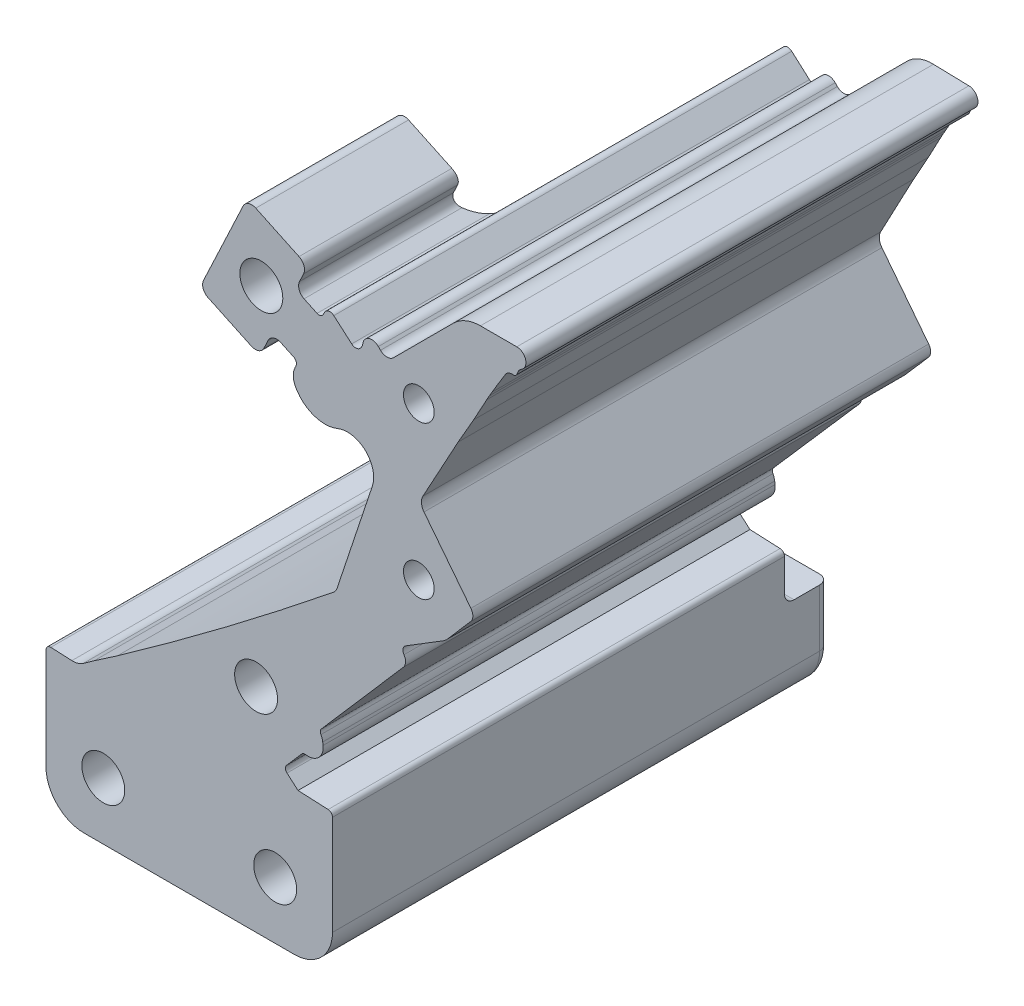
ISO-10303-21;
HEADER;
FILE_DESCRIPTION(('STEP AP214'),'2;1');
FILE_NAME('part.step','',(''),(''),'','','');
FILE_SCHEMA(('AUTOMOTIVE_DESIGN { 1 0 10303 214 1 1 1 1 }'));
ENDSEC;
DATA;
#1=APPLICATION_CONTEXT('core data for automotive mechanical design processes');
#2=APPLICATION_PROTOCOL_DEFINITION('international standard','automotive_design',2000,#1);
#3=PRODUCT_CONTEXT('',#1,'mechanical');
#4=PRODUCT('Part','Part','',(#3));
#5=PRODUCT_RELATED_PRODUCT_CATEGORY('part','',(#4));
#6=PRODUCT_DEFINITION_FORMATION('','',#4);
#7=PRODUCT_DEFINITION_CONTEXT('part definition',#1,'design');
#8=PRODUCT_DEFINITION('design','',#6,#7);
#9=PRODUCT_DEFINITION_SHAPE('','',#8);
#10=(LENGTH_UNIT() NAMED_UNIT(*) SI_UNIT(.MILLI.,.METRE.));
#11=(NAMED_UNIT(*) PLANE_ANGLE_UNIT() SI_UNIT($,.RADIAN.));
#12=(NAMED_UNIT(*) SI_UNIT($,.STERADIAN.) SOLID_ANGLE_UNIT());
#13=UNCERTAINTY_MEASURE_WITH_UNIT(LENGTH_MEASURE(1.E-05),#10,'distance_accuracy_value','');
#14=(GEOMETRIC_REPRESENTATION_CONTEXT(3) GLOBAL_UNCERTAINTY_ASSIGNED_CONTEXT((#13)) GLOBAL_UNIT_ASSIGNED_CONTEXT((#10,
#11,#12)) REPRESENTATION_CONTEXT('',''));
#15=CARTESIAN_POINT('',(0.,0.,0.));
#16=DIRECTION('',(0.,0.,1.));
#17=DIRECTION('',(1.,0.,0.));
#18=AXIS2_PLACEMENT_3D('',#15,#16,#17);
#19=CARTESIAN_POINT('',(-259.101060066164,-1.03761213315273,0.));
#20=DIRECTION('',(0.,0.,1.));
#21=DIRECTION('',(1.,0.,0.));
#22=AXIS2_PLACEMENT_3D('',#19,#20,#21);
#23=CYLINDRICAL_SURFACE('',#22,1.5875);
#24=DIRECTION('',(0.,0.,-1.));
#25=VECTOR('',#24,1.);
#26=CARTESIAN_POINT('',(-258.425152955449,0.398809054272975,0.));
#27=LINE('',#26,#25);
#28=CARTESIAN_POINT('',(-258.425152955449,0.398809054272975,71.9582));
#29=VERTEX_POINT('',#28);
#30=CARTESIAN_POINT('',(-258.425152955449,0.398809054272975,46.5582000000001));
#31=VERTEX_POINT('',#30);
#32=EDGE_CURVE('E1798',#29,#31,#27,.T.);
#33=ORIENTED_EDGE('',*,*,#32,.F.);
#34=CARTESIAN_POINT('',(-259.101060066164,-1.03761213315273,71.9582000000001));
#35=DIRECTION('',(0.,0.,1.));
#36=DIRECTION('',(1.,0.,0.));
#37=AXIS2_PLACEMENT_3D('',#34,#35,#36);
#38=CIRCLE('',#37,1.5875);
#39=CARTESIAN_POINT('',(-257.664638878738,-1.71351924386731,71.9582));
#40=VERTEX_POINT('',#39);
#41=EDGE_CURVE('E770',#40,#29,#38,.T.);
#42=ORIENTED_EDGE('',*,*,#41,.F.);
#43=DIRECTION('',(0.,0.,-1.));
#44=VECTOR('',#43,1.);
#45=CARTESIAN_POINT('',(-257.664638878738,-1.71351924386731,0.));
#46=LINE('',#45,#44);
#47=CARTESIAN_POINT('',(-257.664638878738,-1.71351924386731,46.3565610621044));
#48=VERTEX_POINT('',#47);
#49=EDGE_CURVE('E1796',#48,#40,#46,.F.);
#50=ORIENTED_EDGE('',*,*,#49,.F.);
#51=CARTESIAN_POINT('',(-258.425152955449,0.398809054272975,46.5582000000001));
#52=CARTESIAN_POINT('',(-258.385396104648,0.380102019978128,46.5582025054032));
#53=CARTESIAN_POINT('',(-258.346436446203,0.359751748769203,46.5577434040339));
#54=CARTESIAN_POINT('',(-258.270357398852,0.315908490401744,46.5559286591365));
#55=CARTESIAN_POINT('',(-258.233237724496,0.292415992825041,46.5545731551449));
#56=CARTESIAN_POINT('',(-258.125194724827,0.217573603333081,46.5492120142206));
#57=CARTESIAN_POINT('',(-258.057358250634,0.161750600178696,46.5439114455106));
#58=CARTESIAN_POINT('',(-257.931980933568,0.0399145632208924,46.5304263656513));
#59=CARTESIAN_POINT('',(-257.87443988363,-0.026098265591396,46.5222419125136));
#60=CARTESIAN_POINT('',(-257.77105330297,-0.166499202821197,46.5038604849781));
#61=CARTESIAN_POINT('',(-257.725210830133,-0.240889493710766,46.4936629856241));
#62=CARTESIAN_POINT('',(-257.645641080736,-0.397481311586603,46.4721307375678));
#63=CARTESIAN_POINT('',(-257.612151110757,-0.479800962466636,46.4607785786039));
#64=CARTESIAN_POINT('',(-257.559332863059,-0.648919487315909,46.4383303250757));
#65=CARTESIAN_POINT('',(-257.54000771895,-0.735719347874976,46.4272342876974));
#66=CARTESIAN_POINT('',(-257.515911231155,-0.912837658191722,46.4063763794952));
#67=CARTESIAN_POINT('',(-257.511364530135,-1.00318947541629,46.3966372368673));
#68=CARTESIAN_POINT('',(-257.517715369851,-1.18357269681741,46.3798605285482));
#69=CARTESIAN_POINT('',(-257.528600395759,-1.2736043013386,46.3728207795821));
#70=CARTESIAN_POINT('',(-257.559721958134,-1.42266570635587,46.3639696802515));
#71=CARTESIAN_POINT('',(-257.575922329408,-1.48251120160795,46.3612093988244));
#72=CARTESIAN_POINT('',(-257.615190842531,-1.59991814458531,46.3574972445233));
#73=CARTESIAN_POINT('',(-257.638254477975,-1.65748106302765,46.3565441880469));
#74=CARTESIAN_POINT('',(-257.664638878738,-1.71351924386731,46.3565610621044));
#75=B_SPLINE_CURVE_WITH_KNOTS('',3,(#51,#52,#53,#54,#55,#56,#57,#58,#59,#60,#61,#62,#63,#64,#65,
#66,#67,#68,#69,#70,#71,#72,#73,#74),.UNSPECIFIED.,.F.,.F.,(4,2,2,2,2,2,2,2,2,2,2,4),(0.,
0.131731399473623,0.263442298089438,0.526113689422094,0.788779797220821,1.0515144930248,
1.31906192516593,1.58666852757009,1.85832436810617,2.12976002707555,2.31551982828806,
2.50115792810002),.UNSPECIFIED.);
#76=EDGE_CURVE('E762',#31,#48,#75,.T.);
#77=ORIENTED_EDGE('',*,*,#76,.F.);
#78=EDGE_LOOP('',(#33,#42,#50,#77));
#79=FACE_BOUND('',#78,.T.);
#80=ADVANCED_FACE('F53',(#79),#23,.T.);
#81=CARTESIAN_POINT('',(-266.283166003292,2.34192342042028,71.9582));
#82=DIRECTION('',(0.,0.,1.));
#83=DIRECTION('',(1.,0.,0.));
#84=AXIS2_PLACEMENT_3D('',#81,#82,#83);
#85=CYLINDRICAL_SURFACE('',#84,1.5875);
#86=DIRECTION('',(0.,0.,-1.));
#87=VECTOR('',#86,1.);
#88=CARTESIAN_POINT('',(-267.719587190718,3.01783053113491,71.9582));
#89=LINE('',#88,#87);
#90=CARTESIAN_POINT('',(-267.719587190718,3.01783053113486,71.9582));
#91=VERTEX_POINT('',#90);
#92=CARTESIAN_POINT('',(-267.719587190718,3.01783053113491,46.5582000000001));
#93=VERTEX_POINT('',#92);
#94=EDGE_CURVE('E1809',#91,#93,#89,.T.);
#95=ORIENTED_EDGE('',*,*,#94,.F.);
#96=CARTESIAN_POINT('',(-266.283166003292,2.34192342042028,71.9582000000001));
#97=DIRECTION('',(0.,0.,1.));
#98=DIRECTION('',(1.,0.,0.));
#99=AXIS2_PLACEMENT_3D('',#96,#97,#98);
#100=CIRCLE('',#99,1.5875);
#101=CARTESIAN_POINT('',(-265.607258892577,3.77834460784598,71.9582));
#102=VERTEX_POINT('',#101);
#103=EDGE_CURVE('E1804',#102,#91,#100,.T.);
#104=ORIENTED_EDGE('',*,*,#103,.F.);
#105=DIRECTION('',(0.,0.,-1.));
#106=VECTOR('',#105,1.);
#107=CARTESIAN_POINT('',(-265.607258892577,3.77834460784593,71.9582));
#108=LINE('',#107,#106);
#109=CARTESIAN_POINT('',(-265.607258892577,3.77834460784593,46.5582000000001));
#110=VERTEX_POINT('',#109);
#111=EDGE_CURVE('E1806',#110,#102,#108,.F.);
#112=ORIENTED_EDGE('',*,*,#111,.F.);
#113=CARTESIAN_POINT('',(-266.283166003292,2.34192342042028,46.5582000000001));
#114=DIRECTION('',(0.,0.,-1.));
#115=DIRECTION('',(-1.,0.,0.));
#116=AXIS2_PLACEMENT_3D('',#113,#114,#115);
#117=CIRCLE('',#116,1.5875);
#118=EDGE_CURVE('E1800',#93,#110,#117,.T.);
#119=ORIENTED_EDGE('',*,*,#118,.F.);
#120=EDGE_LOOP('',(#95,#104,#112,#119));
#121=FACE_BOUND('',#120,.T.);
#122=ADVANCED_FACE('F749',(#121),#85,.T.);
#123=CARTESIAN_POINT('',(-272.861121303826,-11.6373855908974,0.));
#124=DIRECTION('',(0.,0.,1.));
#125=DIRECTION('',(1.,0.,0.));
#126=AXIS2_PLACEMENT_3D('',#123,#124,#125);
#127=CYLINDRICAL_SURFACE('',#126,1.5875);
#128=DIRECTION('',(0.,0.,-1.));
#129=VECTOR('',#128,1.);
#130=CARTESIAN_POINT('',(-273.537028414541,-13.0738067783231,0.));
#131=LINE('',#130,#129);
#132=CARTESIAN_POINT('',(-273.537028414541,-13.0738067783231,71.9582));
#133=VERTEX_POINT('',#132);
#134=CARTESIAN_POINT('',(-273.537028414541,-13.0738067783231,46.5582000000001));
#135=VERTEX_POINT('',#134);
#136=EDGE_CURVE('E835',#133,#135,#131,.T.);
#137=ORIENTED_EDGE('',*,*,#136,.F.);
#138=CARTESIAN_POINT('',(-272.861121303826,-11.6373855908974,71.9582000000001));
#139=DIRECTION('',(0.,0.,1.));
#140=DIRECTION('',(1.,0.,0.));
#141=AXIS2_PLACEMENT_3D('',#138,#139,#140);
#142=CIRCLE('',#141,1.5875);
#143=CARTESIAN_POINT('',(-274.297542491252,-10.9614784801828,71.9582));
#144=VERTEX_POINT('',#143);
#145=EDGE_CURVE('E854',#144,#133,#142,.T.);
#146=ORIENTED_EDGE('',*,*,#145,.F.);
#147=DIRECTION('',(0.,0.,-1.));
#148=VECTOR('',#147,1.);
#149=CARTESIAN_POINT('',(-274.297542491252,-10.9614784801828,0.));
#150=LINE('',#149,#148);
#151=CARTESIAN_POINT('',(-274.297542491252,-10.9614784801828,46.5582000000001));
#152=VERTEX_POINT('',#151);
#153=EDGE_CURVE('E860',#152,#144,#150,.F.);
#154=ORIENTED_EDGE('',*,*,#153,.F.);
#155=CARTESIAN_POINT('',(-272.861121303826,-11.6373855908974,46.5582000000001));
#156=DIRECTION('',(0.,0.,-1.));
#157=DIRECTION('',(-1.,0.,0.));
#158=AXIS2_PLACEMENT_3D('',#155,#156,#157);
#159=CIRCLE('',#158,1.5875);
#160=EDGE_CURVE('E856',#135,#152,#159,.T.);
#161=ORIENTED_EDGE('',*,*,#160,.F.);
#162=EDGE_LOOP('',(#137,#146,#154,#161));
#163=FACE_BOUND('',#162,.T.);
#164=ADVANCED_FACE('F755',(#163),#127,.T.);
#165=CARTESIAN_POINT('',(-265.679015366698,-15.0169211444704,71.9582));
#166=DIRECTION('',(0.,0.,1.));
#167=DIRECTION('',(1.,0.,0.));
#168=AXIS2_PLACEMENT_3D('',#165,#166,#167);
#169=CYLINDRICAL_SURFACE('',#168,1.5875);
#170=DIRECTION('',(0.,0.,-1.));
#171=VECTOR('',#170,1.);
#172=CARTESIAN_POINT('',(-264.242594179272,-15.692828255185,71.9582));
#173=LINE('',#172,#171);
#174=CARTESIAN_POINT('',(-264.242594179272,-15.692828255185,71.9582));
#175=VERTEX_POINT('',#174);
#176=CARTESIAN_POINT('',(-264.242594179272,-15.692828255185,46.3565610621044));
#177=VERTEX_POINT('',#176);
#178=EDGE_CURVE('E1284',#175,#177,#173,.T.);
#179=ORIENTED_EDGE('',*,*,#178,.F.);
#180=CARTESIAN_POINT('',(-265.679015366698,-15.0169211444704,71.9582000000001));
#181=DIRECTION('',(0.,0.,1.));
#182=DIRECTION('',(1.,0.,0.));
#183=AXIS2_PLACEMENT_3D('',#180,#181,#182);
#184=CIRCLE('',#183,1.5875);
#185=CARTESIAN_POINT('',(-266.354922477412,-16.453342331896,71.9582));
#186=VERTEX_POINT('',#185);
#187=EDGE_CURVE('E836',#186,#175,#184,.T.);
#188=ORIENTED_EDGE('',*,*,#187,.F.);
#189=DIRECTION('',(0.,0.,-1.));
#190=VECTOR('',#189,1.);
#191=CARTESIAN_POINT('',(-266.354922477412,-16.453342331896,71.9582));
#192=LINE('',#191,#190);
#193=CARTESIAN_POINT('',(-266.354922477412,-16.453342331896,46.5582000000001));
#194=VERTEX_POINT('',#193);
#195=EDGE_CURVE('E864',#194,#186,#192,.F.);
#196=ORIENTED_EDGE('',*,*,#195,.F.);
#197=CARTESIAN_POINT('',(-264.242594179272,-15.692828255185,46.3565610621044));
#198=CARTESIAN_POINT('',(-264.261291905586,-15.7325654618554,46.3565581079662));
#199=CARTESIAN_POINT('',(-264.28163130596,-15.771506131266,46.3570321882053));
#200=CARTESIAN_POINT('',(-264.325448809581,-15.8475477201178,46.3589038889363));
#201=CARTESIAN_POINT('',(-264.348926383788,-15.8846489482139,46.3603013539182));
#202=CARTESIAN_POINT('',(-264.423713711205,-15.9926324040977,46.3658225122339));
#203=CARTESIAN_POINT('',(-264.479489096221,-16.0604295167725,46.3712753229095));
#204=CARTESIAN_POINT('',(-264.6012068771,-16.1857353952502,46.3850897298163));
#205=CARTESIAN_POINT('',(-264.667148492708,-16.2432449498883,46.3934511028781));
#206=CARTESIAN_POINT('',(-264.807399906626,-16.3465940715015,46.4121359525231));
#207=CARTESIAN_POINT('',(-264.881712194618,-16.3924301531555,46.4224600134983));
#208=CARTESIAN_POINT('',(-265.038258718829,-16.4720678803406,46.4441579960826));
#209=CARTESIAN_POINT('',(-265.120619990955,-16.5056151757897,46.4555485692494));
#210=CARTESIAN_POINT('',(-265.289846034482,-16.5585317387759,46.4779532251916));
#211=CARTESIAN_POINT('',(-265.376711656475,-16.5778983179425,46.4889672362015));
#212=CARTESIAN_POINT('',(-265.553896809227,-16.6020426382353,46.5095648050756));
#213=CARTESIAN_POINT('',(-265.644247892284,-16.606608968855,46.5191257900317));
#214=CARTESIAN_POINT('',(-265.824630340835,-16.6002977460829,46.5355403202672));
#215=CARTESIAN_POINT('',(-265.914661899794,-16.5894321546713,46.5423959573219));
#216=CARTESIAN_POINT('',(-266.063786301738,-16.5583324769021,46.5510070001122));
#217=CARTESIAN_POINT('',(-266.123694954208,-16.5421254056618,46.5536886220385));
#218=CARTESIAN_POINT('',(-266.241218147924,-16.5028317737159,46.5572919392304));
#219=CARTESIAN_POINT('',(-266.298834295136,-16.4797501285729,46.5582148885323));
#220=CARTESIAN_POINT('',(-266.354922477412,-16.4533423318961,46.5582000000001));
#221=B_SPLINE_CURVE_WITH_KNOTS('',3,(#197,#198,#199,#200,#201,#202,#203,#204,#205,#206,#207,
#208,#209,#210,#211,#212,#213,#214,#215,#216,#217,#218,#219,#220),.UNSPECIFIED.,.F.,.F.,(4,2,2,
2,2,2,2,2,2,2,2,4),(0.,0.131665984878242,0.263309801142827,0.525827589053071,0.788325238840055,
1.0509011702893,1.31864004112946,1.58642965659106,1.85802796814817,2.12941586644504,
2.31535338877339,2.50115827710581),.UNSPECIFIED.);
#222=EDGE_CURVE('E827',#177,#194,#221,.T.);
#223=ORIENTED_EDGE('',*,*,#222,.F.);
#224=EDGE_LOOP('',(#179,#188,#196,#223));
#225=FACE_BOUND('',#224,.T.);
#226=ADVANCED_FACE('F839',(#225),#169,.T.);
#227=CARTESIAN_POINT('',(-262.130265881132,-14.9323141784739,71.9582));
#228=DIRECTION('',(0.,0.,1.));
#229=DIRECTION('',(1.,0.,0.));
#230=AXIS2_PLACEMENT_3D('',#227,#228,#229);
#231=CYLINDRICAL_SURFACE('',#230,1.5875);
#232=DIRECTION('',(0.,0.,1.));
#233=VECTOR('',#232,1.);
#234=CARTESIAN_POINT('',(-263.566687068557,-14.2564070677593,71.9582));
#235=LINE('',#234,#233);
#236=CARTESIAN_POINT('',(-263.566687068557,-14.2564070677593,46.3565610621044));
#237=VERTEX_POINT('',#236);
#238=CARTESIAN_POINT('',(-263.566687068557,-14.2564070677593,71.9582));
#239=VERTEX_POINT('',#238);
#240=EDGE_CURVE('E1272',#237,#239,#235,.T.);
#241=ORIENTED_EDGE('',*,*,#240,.F.);
#242=CARTESIAN_POINT('',(-261.454358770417,-13.4958929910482,45.7074613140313));
#243=CARTESIAN_POINT('',(-261.494393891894,-13.4770576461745,45.7330087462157));
#244=CARTESIAN_POINT('',(-261.535485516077,-13.4597650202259,45.7580101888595));
#245=CARTESIAN_POINT('',(-261.619635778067,-13.428507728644,45.8068173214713));
#246=CARTESIAN_POINT('',(-261.662695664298,-13.4145452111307,45.8306222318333));
#247=CARTESIAN_POINT('',(-261.794795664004,-13.3779768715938,45.9001783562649));
#248=CARTESIAN_POINT('',(-261.886510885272,-13.360807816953,45.9439143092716));
#249=CARTESIAN_POINT('',(-262.074689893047,-13.342962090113,46.0251406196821));
#250=CARTESIAN_POINT('',(-262.171171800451,-13.342354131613,46.0626043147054));
#251=CARTESIAN_POINT('',(-262.364870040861,-13.3592504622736,46.1304478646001));
#252=CARTESIAN_POINT('',(-262.462084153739,-13.3767127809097,46.160843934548));
#253=CARTESIAN_POINT('',(-262.644245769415,-13.4276318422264,46.212014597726));
#254=CARTESIAN_POINT('',(-262.72948330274,-13.4594179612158,46.2334276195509));
#255=CARTESIAN_POINT('',(-262.894264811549,-13.5377609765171,46.2707314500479));
#256=CARTESIAN_POINT('',(-262.973806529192,-13.5843236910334,46.286620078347));
#257=CARTESIAN_POINT('',(-263.119871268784,-13.6879646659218,46.3125266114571));
#258=CARTESIAN_POINT('',(-263.186877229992,-13.7442950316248,46.3228268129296));
#259=CARTESIAN_POINT('',(-263.31091287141,-13.8674906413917,46.3392620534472));
#260=CARTESIAN_POINT('',(-263.367953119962,-13.9343445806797,46.3454015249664));
#261=CARTESIAN_POINT('',(-263.447480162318,-14.0449167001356,46.3519397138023));
#262=CARTESIAN_POINT('',(-263.474046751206,-14.0856890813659,46.3536773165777));
#263=CARTESIAN_POINT('',(-263.523304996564,-14.1694544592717,46.3559850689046));
#264=CARTESIAN_POINT('',(-263.546002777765,-14.2124438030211,46.3565570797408));
#265=CARTESIAN_POINT('',(-263.566687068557,-14.2564070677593,46.3565610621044));
#266=B_SPLINE_CURVE_WITH_KNOTS('',3,(#242,#243,#244,#245,#246,#247,#248,#249,#250,#251,#252,
#253,#254,#255,#256,#257,#258,#259,#260,#261,#262,#263,#264,#265),.UNSPECIFIED.,.F.,.F.,(4,2,2,
2,2,2,2,2,2,2,2,4),(0.,0.153200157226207,0.306498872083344,0.614026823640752,0.922830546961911,
1.23091864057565,1.50984119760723,1.78887371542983,2.05205031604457,2.31494610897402,
2.46083548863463,2.60649172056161),.UNSPECIFIED.);
#267=CARTESIAN_POINT('',(-261.454358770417,-13.4958929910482,45.7074613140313));
#268=VERTEX_POINT('',#267);
#269=EDGE_CURVE('E818',#237,#268,#266,.F.);
#270=ORIENTED_EDGE('',*,*,#269,.T.);
#271=DIRECTION('',(0.,0.,1.));
#272=VECTOR('',#271,1.);
#273=CARTESIAN_POINT('',(-261.454358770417,-13.4958929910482,0.));
#274=LINE('',#273,#272);
#275=CARTESIAN_POINT('',(-261.454358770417,-13.4958929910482,71.9582));
#276=VERTEX_POINT('',#275);
#277=EDGE_CURVE('E1274',#276,#268,#274,.F.);
#278=ORIENTED_EDGE('',*,*,#277,.F.);
#279=CARTESIAN_POINT('',(-262.130265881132,-14.9323141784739,71.9582000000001));
#280=DIRECTION('',(0.,0.,1.));
#281=DIRECTION('',(1.,0.,0.));
#282=AXIS2_PLACEMENT_3D('',#279,#280,#281);
#283=CIRCLE('',#282,1.5875);
#284=EDGE_CURVE('E1282',#276,#239,#283,.T.);
#285=ORIENTED_EDGE('',*,*,#284,.T.);
#286=EDGE_LOOP('',(#241,#270,#278,#285));
#287=FACE_BOUND('',#286,.T.);
#288=ADVANCED_FACE('F842',(#287),#231,.F.);
#289=CARTESIAN_POINT('',(-256.904124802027,-3.82584754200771,71.9582));
#290=DIRECTION('',(0.,0.,-1.));
#291=DIRECTION('',(-1.,0.,0.));
#292=AXIS2_PLACEMENT_3D('',#289,#290,#291);
#293=CYLINDRICAL_SURFACE('',#292,1.5875);
#294=DIRECTION('',(0.,0.,-1.));
#295=VECTOR('',#294,1.);
#296=CARTESIAN_POINT('',(-258.340545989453,-3.14994043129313,71.9582));
#297=LINE('',#296,#295);
#298=CARTESIAN_POINT('',(-258.340545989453,-3.14994043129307,71.9582));
#299=VERTEX_POINT('',#298);
#300=CARTESIAN_POINT('',(-258.340545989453,-3.14994043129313,46.3565610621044));
#301=VERTEX_POINT('',#300);
#302=EDGE_CURVE('E1260',#299,#301,#297,.T.);
#303=ORIENTED_EDGE('',*,*,#302,.F.);
#304=CARTESIAN_POINT('',(-256.904124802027,-3.82584754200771,71.9582000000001));
#305=DIRECTION('',(0.,0.,1.));
#306=DIRECTION('',(1.,0.,0.));
#307=AXIS2_PLACEMENT_3D('',#304,#305,#306);
#308=CIRCLE('',#307,1.5875);
#309=CARTESIAN_POINT('',(-257.580031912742,-5.26226872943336,71.9582));
#310=VERTEX_POINT('',#309);
#311=EDGE_CURVE('E1266',#299,#310,#308,.T.);
#312=ORIENTED_EDGE('',*,*,#311,.T.);
#313=DIRECTION('',(0.,0.,-1.));
#314=VECTOR('',#313,1.);
#315=CARTESIAN_POINT('',(-257.580031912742,-5.26226872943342,71.9582));
#316=LINE('',#315,#314);
#317=CARTESIAN_POINT('',(-257.580031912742,-5.26226872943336,45.7074613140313));
#318=VERTEX_POINT('',#317);
#319=EDGE_CURVE('E1262',#318,#310,#316,.F.);
#320=ORIENTED_EDGE('',*,*,#319,.F.);
#321=CARTESIAN_POINT('',(-258.340545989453,-3.14994043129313,46.3565610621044));
#322=CARTESIAN_POINT('',(-258.35898148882,-3.18911831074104,46.3565585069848));
#323=CARTESIAN_POINT('',(-258.375803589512,-3.22903242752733,46.3561036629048));
#324=CARTESIAN_POINT('',(-258.406127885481,-3.31007956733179,46.3542730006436));
#325=CARTESIAN_POINT('',(-258.41963025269,-3.3512125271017,46.3528972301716));
#326=CARTESIAN_POINT('',(-258.454975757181,-3.4759069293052,46.3473708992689));
#327=CARTESIAN_POINT('',(-258.471728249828,-3.56091516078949,46.3418214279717));
#328=CARTESIAN_POINT('',(-258.491204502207,-3.73217255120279,46.3267336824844));
#329=CARTESIAN_POINT('',(-258.493921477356,-3.81842229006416,46.3171934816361));
#330=CARTESIAN_POINT('',(-258.48547537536,-3.98963816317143,46.2937641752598));
#331=CARTESIAN_POINT('',(-258.474314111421,-4.0746044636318,46.2798756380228));
#332=CARTESIAN_POINT('',(-258.43874506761,-4.24100519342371,46.2473482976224));
#333=CARTESIAN_POINT('',(-258.414302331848,-4.32242968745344,46.2286970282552));
#334=CARTESIAN_POINT('',(-258.353376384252,-4.47922380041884,46.1864187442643));
#335=CARTESIAN_POINT('',(-258.316895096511,-4.55459438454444,46.1627925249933));
#336=CARTESIAN_POINT('',(-258.232649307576,-4.69895306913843,46.1099511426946));
#337=CARTESIAN_POINT('',(-258.184658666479,-4.76776869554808,46.0806265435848));
#338=CARTESIAN_POINT('',(-258.079854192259,-4.89574045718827,46.0169181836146));
#339=CARTESIAN_POINT('',(-258.023030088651,-4.95488518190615,45.9825285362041));
#340=CARTESIAN_POINT('',(-257.904093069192,-5.06134015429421,45.9100058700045));
#341=CARTESIAN_POINT('',(-257.842131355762,-5.10889073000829,45.8719768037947));
#342=CARTESIAN_POINT('',(-257.745945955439,-5.17231258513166,45.812191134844));
#343=CARTESIAN_POINT('',(-257.713379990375,-5.19211901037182,45.7918286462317));
#344=CARTESIAN_POINT('',(-257.647342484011,-5.22913433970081,45.7502605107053));
#345=CARTESIAN_POINT('',(-257.613871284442,-5.24634420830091,45.7290551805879));
#346=CARTESIAN_POINT('',(-257.580031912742,-5.26226872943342,45.7074613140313));
#347=B_SPLINE_CURVE_WITH_KNOTS('',3,(#321,#322,#323,#324,#325,#326,#327,#328,#329,#330,#331,
#332,#333,#334,#335,#336,#337,#338,#339,#340,#341,#342,#343,#344,#345,#346),.UNSPECIFIED.,.F.,
.F.,(4,2,2,2,2,2,2,2,2,2,2,2,4),(0.,0.129816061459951,0.25962539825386,0.518749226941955,
0.77799830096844,1.03721350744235,1.29711427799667,1.55697352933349,1.82243083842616,
2.08819913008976,2.34787158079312,2.47743285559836,2.60694588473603),.UNSPECIFIED.);
#348=EDGE_CURVE('E808',#318,#301,#347,.F.);
#349=ORIENTED_EDGE('',*,*,#348,.T.);
#350=EDGE_LOOP('',(#303,#312,#320,#349));
#351=FACE_BOUND('',#350,.T.);
#352=ADVANCED_FACE('F1457',(#351),#293,.F.);
#353=CARTESIAN_POINT('',(-259.637680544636,-15.2279642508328,0.));
#354=DIRECTION('',(0.,0.,1.));
#355=DIRECTION('',(1.,0.,0.));
#356=AXIS2_PLACEMENT_3D('',#353,#354,#355);
#357=CYLINDRICAL_SURFACE('',#356,0.79375);
#358=DIRECTION('',(0.,0.,1.));
#359=VECTOR('',#358,1.);
#360=CARTESIAN_POINT('',(-259.299726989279,-14.50975365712,0.));
#361=LINE('',#360,#359);
#362=CARTESIAN_POINT('',(-259.299726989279,-14.50975365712,43.2823805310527));
#363=VERTEX_POINT('',#362);
#364=CARTESIAN_POINT('',(-259.299726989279,-14.50975365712,71.9581999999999));
#365=VERTEX_POINT('',#364);
#366=EDGE_CURVE('E1245',#363,#365,#361,.T.);
#367=ORIENTED_EDGE('',*,*,#366,.F.);
#368=CARTESIAN_POINT('',(-258.919469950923,-15.5659178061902,40.2082));
#369=CARTESIAN_POINT('',(-258.918716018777,-15.5643155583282,40.2132085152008));
#370=CARTESIAN_POINT('',(-258.917967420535,-15.5627107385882,40.2182171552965));
#371=CARTESIAN_POINT('',(-258.879899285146,-15.4803839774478,40.4747579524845));
#372=CARTESIAN_POINT('',(-258.856061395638,-15.3932457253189,40.7265834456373));
#373=CARTESIAN_POINT('',(-258.84320251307,-15.2579342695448,41.1032351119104));
#374=CARTESIAN_POINT('',(-258.842736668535,-15.2120450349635,41.2286513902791));
#375=CARTESIAN_POINT('',(-258.849995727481,-15.1196149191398,41.4789999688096));
#376=CARTESIAN_POINT('',(-258.857717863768,-15.0730742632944,41.6039324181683));
#377=CARTESIAN_POINT('',(-258.882724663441,-14.9776512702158,41.8604546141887));
#378=CARTESIAN_POINT('',(-258.900547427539,-14.9287930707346,41.9920015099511));
#379=CARTESIAN_POINT('',(-258.947052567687,-14.8331220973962,42.2538438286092));
#380=CARTESIAN_POINT('',(-258.975724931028,-14.7863074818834,42.3841402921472));
#381=CARTESIAN_POINT('',(-259.027872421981,-14.7190599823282,42.5787291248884));
#382=CARTESIAN_POINT('',(-259.046868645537,-14.6970613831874,42.6436966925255));
#383=CARTESIAN_POINT('',(-259.08808353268,-14.6545013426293,42.7730674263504));
#384=CARTESIAN_POINT('',(-259.110301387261,-14.6339395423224,42.8374707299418));
#385=CARTESIAN_POINT('',(-259.15822831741,-14.5946149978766,42.9658074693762));
#386=CARTESIAN_POINT('',(-259.183949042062,-14.575858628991,43.0297385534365));
#387=CARTESIAN_POINT('',(-259.239046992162,-14.5408051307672,43.1567582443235));
#388=CARTESIAN_POINT('',(-259.268427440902,-14.5245101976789,43.2198460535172));
#389=CARTESIAN_POINT('',(-259.299726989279,-14.50975365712,43.2823805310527));
#390=B_SPLINE_CURVE_WITH_KNOTS('',3,(#368,#369,#370,#371,#372,#373,#374,#375,#376,#377,#378,
#379,#380,#381,#382,#383,#384,#385,#386,#387,#388,#389),.UNSPECIFIED.,.F.,.F.,(4,2,2,2,2,2,2,2,
2,2,4),(0.,0.0159373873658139,0.816288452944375,1.21676440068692,1.61710504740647,
2.04110246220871,2.46470953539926,2.67815515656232,2.89154727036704,3.10566720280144,
3.31997707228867),.UNSPECIFIED.);
#391=CARTESIAN_POINT('',(-258.919469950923,-15.5659178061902,40.2082));
#392=VERTEX_POINT('',#391);
#393=EDGE_CURVE('E798',#363,#392,#390,.F.);
#394=ORIENTED_EDGE('',*,*,#393,.T.);
#395=DIRECTION('',(0.,0.,1.));
#396=VECTOR('',#395,1.);
#397=CARTESIAN_POINT('',(-258.919469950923,-15.5659178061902,71.9582000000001));
#398=LINE('',#397,#396);
#399=CARTESIAN_POINT('',(-258.919469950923,-15.5659178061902,71.9582000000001));
#400=VERTEX_POINT('',#399);
#401=EDGE_CURVE('E1248',#400,#392,#398,.F.);
#402=ORIENTED_EDGE('',*,*,#401,.F.);
#403=CARTESIAN_POINT('',(-259.637680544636,-15.2279642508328,71.9582000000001));
#404=DIRECTION('',(0.,0.,1.));
#405=DIRECTION('',(1.,0.,0.));
#406=AXIS2_PLACEMENT_3D('',#403,#404,#405);
#407=CIRCLE('',#406,0.79375);
#408=EDGE_CURVE('E1257',#400,#365,#407,.T.);
#409=ORIENTED_EDGE('',*,*,#408,.T.);
#410=EDGE_LOOP('',(#367,#394,#402,#409));
#411=FACE_BOUND('',#410,.T.);
#412=ADVANCED_FACE('F1455',(#411),#357,.F.);
#413=CARTESIAN_POINT('',(-255.087446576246,-5.55791880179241,71.9582));
#414=DIRECTION('',(0.,0.,-1.));
#415=DIRECTION('',(-1.,0.,0.));
#416=AXIS2_PLACEMENT_3D('',#413,#414,#415);
#417=CYLINDRICAL_SURFACE('',#416,0.79375);
#418=DIRECTION('',(0.,0.,-1.));
#419=VECTOR('',#418,1.);
#420=CARTESIAN_POINT('',(-255.425400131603,-6.2761293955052,71.9582));
#421=LINE('',#420,#419);
#422=CARTESIAN_POINT('',(-255.425400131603,-6.2761293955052,71.9581999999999));
#423=VERTEX_POINT('',#422);
#424=CARTESIAN_POINT('',(-255.425400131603,-6.27612939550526,43.2823805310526));
#425=VERTEX_POINT('',#424);
#426=EDGE_CURVE('E1236',#423,#425,#421,.T.);
#427=ORIENTED_EDGE('',*,*,#426,.F.);
#428=CARTESIAN_POINT('',(-255.087446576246,-5.55791880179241,71.9582000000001));
#429=DIRECTION('',(0.,0.,1.));
#430=DIRECTION('',(1.,0.,0.));
#431=AXIS2_PLACEMENT_3D('',#428,#429,#430);
#432=CIRCLE('',#431,0.79375);
#433=CARTESIAN_POINT('',(-254.369235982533,-5.89587235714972,71.9582000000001));
#434=VERTEX_POINT('',#433);
#435=EDGE_CURVE('E1241',#423,#434,#432,.T.);
#436=ORIENTED_EDGE('',*,*,#435,.T.);
#437=DIRECTION('',(0.,0.,-1.));
#438=VECTOR('',#437,1.);
#439=CARTESIAN_POINT('',(-254.369235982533,-5.89587235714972,71.9582000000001));
#440=LINE('',#439,#438);
#441=CARTESIAN_POINT('',(-254.369235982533,-5.89587235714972,40.2082));
#442=VERTEX_POINT('',#441);
#443=EDGE_CURVE('E1239',#442,#434,#440,.F.);
#444=ORIENTED_EDGE('',*,*,#443,.F.);
#445=CARTESIAN_POINT('',(-254.369235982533,-5.89587235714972,40.2082));
#446=CARTESIAN_POINT('',(-254.369235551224,-5.89587144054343,40.2082000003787));
#447=CARTESIAN_POINT('',(-254.369235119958,-5.89587052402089,40.2082002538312));
#448=CARTESIAN_POINT('',(-254.369234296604,-5.89586877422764,40.2082010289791));
#449=CARTESIAN_POINT('',(-254.369233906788,-5.89586794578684,40.2082015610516));
#450=CARTESIAN_POINT('',(-254.369233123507,-5.89586628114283,40.2082028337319));
#451=CARTESIAN_POINT('',(-254.369232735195,-5.89586545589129,40.2082035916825));
#452=CARTESIAN_POINT('',(-254.369232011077,-5.89586391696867,40.2082052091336));
#453=CARTESIAN_POINT('',(-254.369231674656,-5.89586320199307,40.2082060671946));
#454=CARTESIAN_POINT('',(-254.369230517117,-5.8958607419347,40.2082092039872));
#455=CARTESIAN_POINT('',(-254.369229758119,-5.8958591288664,40.2082116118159));
#456=CARTESIAN_POINT('',(-254.369228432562,-5.89585631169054,40.2082165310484));
#457=CARTESIAN_POINT('',(-254.369227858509,-5.89585509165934,40.2082190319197));
#458=CARTESIAN_POINT('',(-254.369225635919,-5.89585036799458,40.2082290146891));
#459=CARTESIAN_POINT('',(-254.369224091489,-5.89584708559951,40.2082366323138));
#460=CARTESIAN_POINT('',(-254.369221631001,-5.895841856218,40.2082514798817));
#461=CARTESIAN_POINT('',(-254.369220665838,-5.895839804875,40.2082586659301));
#462=CARTESIAN_POINT('',(-254.369216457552,-5.89583086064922,40.2082898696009));
#463=CARTESIAN_POINT('',(-254.369213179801,-5.89582389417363,40.2083138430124));
#464=CARTESIAN_POINT('',(-254.369208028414,-5.89581294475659,40.2083583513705));
#465=CARTESIAN_POINT('',(-254.369206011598,-5.89580865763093,40.2083787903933));
#466=CARTESIAN_POINT('',(-254.369189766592,-5.89577412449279,40.2085297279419));
#467=CARTESIAN_POINT('',(-254.369168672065,-5.8957292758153,40.2086554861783));
#468=CARTESIAN_POINT('',(-254.369089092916,-5.89556004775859,40.2091477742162));
#469=CARTESIAN_POINT('',(-254.369035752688,-5.89544653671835,40.2095175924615));
#470=CARTESIAN_POINT('',(-254.36882400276,-5.89499563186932,40.2109653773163));
#471=CARTESIAN_POINT('',(-254.36866045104,-5.89464674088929,40.2120399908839));
#472=CARTESIAN_POINT('',(-254.367988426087,-5.8932104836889,40.2164826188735));
#473=CARTESIAN_POINT('',(-254.367488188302,-5.8921349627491,40.2198543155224));
#474=CARTESIAN_POINT('',(-254.356772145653,-5.86895845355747,40.2924068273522));
#475=CARTESIAN_POINT('',(-254.347501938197,-5.84622016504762,40.3615454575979));
#476=CARTESIAN_POINT('',(-254.33143091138,-5.80089851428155,40.4971623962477));
#477=CARTESIAN_POINT('',(-254.324548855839,-5.77834280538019,40.5636407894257));
#478=CARTESIAN_POINT('',(-254.312075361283,-5.7297863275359,40.7046232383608));
#479=CARTESIAN_POINT('',(-254.306742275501,-5.70369992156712,40.7791211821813));
#480=CARTESIAN_POINT('',(-254.298665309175,-5.65061494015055,40.9288176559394));
#481=CARTESIAN_POINT('',(-254.295949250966,-5.62360965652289,41.0040153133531));
#482=CARTESIAN_POINT('',(-254.293661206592,-5.57642166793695,41.1341615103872));
#483=CARTESIAN_POINT('',(-254.293441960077,-5.55634890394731,41.1891390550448));
#484=CARTESIAN_POINT('',(-254.294544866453,-5.5160771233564,41.2988756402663));
#485=CARTESIAN_POINT('',(-254.2958631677,-5.4958785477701,41.3536348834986));
#486=CARTESIAN_POINT('',(-254.302097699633,-5.43606068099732,41.515270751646));
#487=CARTESIAN_POINT('',(-254.309246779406,-5.39630116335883,41.622018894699));
#488=CARTESIAN_POINT('',(-254.331449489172,-5.31157972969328,41.849770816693));
#489=CARTESIAN_POINT('',(-254.347461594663,-5.26666077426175,41.9706991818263));
#490=CARTESIAN_POINT('',(-254.388755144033,-5.17808327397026,42.2124964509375));
#491=CARTESIAN_POINT('',(-254.414104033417,-5.13443645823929,42.3333583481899));
#492=CARTESIAN_POINT('',(-254.476868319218,-5.04774451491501,42.5812399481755));
#493=CARTESIAN_POINT('',(-254.514942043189,-5.00490966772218,42.708169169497));
#494=CARTESIAN_POINT('',(-254.603758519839,-4.92576404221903,42.9593073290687));
#495=CARTESIAN_POINT('',(-254.65446145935,-4.88943336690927,43.0835235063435));
#496=CARTESIAN_POINT('',(-254.739043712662,-4.84407409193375,43.2625244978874));
#497=CARTESIAN_POINT('',(-254.767397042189,-4.83084201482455,43.318877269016));
#498=CARTESIAN_POINT('',(-254.827288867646,-4.80732316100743,43.4304807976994));
#499=CARTESIAN_POINT('',(-254.858825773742,-4.79703492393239,43.4857320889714));
#500=CARTESIAN_POINT('',(-254.924721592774,-4.78029529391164,43.594021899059));
#501=CARTESIAN_POINT('',(-254.959032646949,-4.77379013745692,43.6470809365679));
#502=CARTESIAN_POINT('',(-255.030880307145,-4.76536151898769,43.7513083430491));
#503=CARTESIAN_POINT('',(-255.068413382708,-4.76343310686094,43.8024786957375));
#504=CARTESIAN_POINT('',(-255.142146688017,-4.76529886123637,43.896549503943));
#505=CARTESIAN_POINT('',(-255.178006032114,-4.7684620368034,43.9397253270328));
#506=CARTESIAN_POINT('',(-255.252075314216,-4.78052035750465,44.023488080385));
#507=CARTESIAN_POINT('',(-255.290292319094,-4.78943357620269,44.0640664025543));
#508=CARTESIAN_POINT('',(-255.368848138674,-4.81456371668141,44.1418255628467));
#509=CARTESIAN_POINT('',(-255.409207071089,-4.83086794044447,44.1789592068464));
#510=CARTESIAN_POINT('',(-255.490230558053,-4.87245712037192,44.2473724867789));
#511=CARTESIAN_POINT('',(-255.530893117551,-4.89770407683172,44.2786760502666));
#512=CARTESIAN_POINT('',(-255.594231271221,-4.94627840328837,44.322043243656));
#513=CARTESIAN_POINT('',(-255.617588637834,-4.96632529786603,44.3367914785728));
#514=CARTESIAN_POINT('',(-255.662784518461,-5.01018346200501,44.362618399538));
#515=CARTESIAN_POINT('',(-255.684623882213,-5.03399260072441,44.3736991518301));
#516=CARTESIAN_POINT('',(-255.72603218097,-5.08532790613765,44.3915940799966));
#517=CARTESIAN_POINT('',(-255.745581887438,-5.1128818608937,44.3983739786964));
#518=CARTESIAN_POINT('',(-255.781249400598,-5.17083824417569,44.4070093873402));
#519=CARTESIAN_POINT('',(-255.797369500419,-5.20123874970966,44.4088681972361));
#520=CARTESIAN_POINT('',(-255.823878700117,-5.26020760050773,44.4075968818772));
#521=CARTESIAN_POINT('',(-255.834711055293,-5.28859116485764,44.4050100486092));
#522=CARTESIAN_POINT('',(-255.852931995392,-5.34584847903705,44.3960322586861));
#523=CARTESIAN_POINT('',(-255.86032039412,-5.37472225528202,44.3896410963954));
#524=CARTESIAN_POINT('',(-255.871716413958,-5.43214951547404,44.3734257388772));
#525=CARTESIAN_POINT('',(-255.875724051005,-5.46070300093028,44.3636015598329));
#526=CARTESIAN_POINT('',(-255.880636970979,-5.5168753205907,44.3409956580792));
#527=CARTESIAN_POINT('',(-255.881540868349,-5.544493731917,44.3282126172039));
#528=CARTESIAN_POINT('',(-255.880392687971,-5.61183121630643,44.2931628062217));
#529=CARTESIAN_POINT('',(-255.87664175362,-5.65071650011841,44.2693455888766));
#530=CARTESIAN_POINT('',(-255.864372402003,-5.72477718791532,44.2175453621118));
#531=CARTESIAN_POINT('',(-255.855843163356,-5.75994395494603,44.18955300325));
#532=CARTESIAN_POINT('',(-255.830125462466,-5.84282792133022,44.1158933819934));
#533=CARTESIAN_POINT('',(-255.810740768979,-5.88816153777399,44.0683265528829));
#534=CARTESIAN_POINT('',(-255.767001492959,-5.97075792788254,43.9686900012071));
#535=CARTESIAN_POINT('',(-255.742634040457,-6.00799927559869,43.9166088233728));
#536=CARTESIAN_POINT('',(-255.694901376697,-6.07009331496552,43.817683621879));
#537=CARTESIAN_POINT('',(-255.671958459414,-6.09597046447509,43.7712661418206));
#538=CARTESIAN_POINT('',(-255.62472971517,-6.14313566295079,43.6767933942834));
#539=CARTESIAN_POINT('',(-255.600442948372,-6.16442044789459,43.6287369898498));
#540=CARTESIAN_POINT('',(-255.526614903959,-6.22205548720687,43.4829657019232));
#541=CARTESIAN_POINT('',(-255.475977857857,-6.25233765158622,43.3833936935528));
#542=CARTESIAN_POINT('',(-255.380115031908,-6.29743148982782,43.1919377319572));
#543=CARTESIAN_POINT('',(-255.334877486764,-6.31353045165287,43.1003396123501));
#544=CARTESIAN_POINT('',(-255.24557696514,-6.33712840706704,42.9153904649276));
#545=CARTESIAN_POINT('',(-255.201515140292,-6.3446192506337,42.8220378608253));
#546=CARTESIAN_POINT('',(-255.114322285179,-6.35244954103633,42.6318429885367));
#547=CARTESIAN_POINT('',(-255.071240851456,-6.35260844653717,42.5349713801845));
#548=CARTESIAN_POINT('',(-254.987733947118,-6.346491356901,42.3404059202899));
#549=CARTESIAN_POINT('',(-254.947306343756,-6.34022059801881,42.2427128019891));
#550=CARTESIAN_POINT('',(-254.860019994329,-6.32000838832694,42.022939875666));
#551=CARTESIAN_POINT('',(-254.813970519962,-6.30457857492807,41.9006763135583));
#552=CARTESIAN_POINT('',(-254.72687298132,-6.26664121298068,41.655103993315));
#553=CARTESIAN_POINT('',(-254.685839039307,-6.24411429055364,41.5317932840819));
#554=CARTESIAN_POINT('',(-254.612919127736,-6.19556720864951,41.2963543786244));
#555=CARTESIAN_POINT('',(-254.580535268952,-6.17007749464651,41.1842693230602));
#556=CARTESIAN_POINT('',(-254.520842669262,-6.11525636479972,40.9609086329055));
#557=CARTESIAN_POINT('',(-254.49348791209,-6.08596445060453,40.8496356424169));
#558=CARTESIAN_POINT('',(-254.460519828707,-6.04491803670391,40.7021603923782));
#559=CARTESIAN_POINT('',(-254.452700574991,-6.03468064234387,40.6660139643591));
#560=CARTESIAN_POINT('',(-254.437388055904,-6.01359125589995,40.5927448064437));
#561=CARTESIAN_POINT('',(-254.429909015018,-6.00273015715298,40.5556217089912));
#562=CARTESIAN_POINT('',(-254.412704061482,-5.97636423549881,40.4668754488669));
#563=CARTESIAN_POINT('',(-254.403240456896,-5.96070142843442,40.4152478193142));
#564=CARTESIAN_POINT('',(-254.390382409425,-5.93766458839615,40.3406585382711));
#565=CARTESIAN_POINT('',(-254.38653650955,-5.93051872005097,40.317702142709));
#566=CARTESIAN_POINT('',(-254.378911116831,-5.91581160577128,40.27091047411));
#567=CARTESIAN_POINT('',(-254.37513989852,-5.90824496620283,40.2470754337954));
#568=CARTESIAN_POINT('',(-254.371002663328,-5.89960379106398,40.2198630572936));
#569=CARTESIAN_POINT('',(-254.370494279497,-5.89853579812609,40.2164999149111));
#570=CARTESIAN_POINT('',(-254.369816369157,-5.89710324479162,40.2120593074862));
#571=CARTESIAN_POINT('',(-254.369650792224,-5.89675269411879,40.2109781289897));
#572=CARTESIAN_POINT('',(-254.369437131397,-5.89629953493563,40.209522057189));
#573=CARTESIAN_POINT('',(-254.369383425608,-5.89618555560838,40.2091505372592));
#574=CARTESIAN_POINT('',(-254.36930343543,-5.89601567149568,40.2086562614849));
#575=CARTESIAN_POINT('',(-254.369282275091,-5.89597072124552,40.20853020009));
#576=CARTESIAN_POINT('',(-254.36926599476,-5.89593613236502,40.2083789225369));
#577=CARTESIAN_POINT('',(-254.369263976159,-5.89593184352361,40.2083584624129));
#578=CARTESIAN_POINT('',(-254.369258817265,-5.89592088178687,40.2083139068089));
#579=CARTESIAN_POINT('',(-254.369255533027,-5.89591390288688,40.208289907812));
#580=CARTESIAN_POINT('',(-254.369251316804,-5.89590494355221,40.2082586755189));
#581=CARTESIAN_POINT('',(-254.369250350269,-5.89590288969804,40.2082514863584));
#582=CARTESIAN_POINT('',(-254.369247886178,-5.89589765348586,40.2082366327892));
#583=CARTESIAN_POINT('',(-254.369246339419,-5.89589436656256,40.2082290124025));
#584=CARTESIAN_POINT('',(-254.369244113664,-5.89588963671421,40.2082190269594));
#585=CARTESIAN_POINT('',(-254.369243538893,-5.89588841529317,40.2082165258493));
#586=CARTESIAN_POINT('',(-254.369242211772,-5.89588559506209,40.2082116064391));
#587=CARTESIAN_POINT('',(-254.369241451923,-5.89588398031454,40.2082091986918));
#588=CARTESIAN_POINT('',(-254.369240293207,-5.89588151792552,40.2082060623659));
#589=CARTESIAN_POINT('',(-254.369239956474,-5.89588080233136,40.2082052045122));
#590=CARTESIAN_POINT('',(-254.369239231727,-5.89587926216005,40.2082035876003));
#591=CARTESIAN_POINT('',(-254.369238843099,-5.89587843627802,40.2082028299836));
#592=CARTESIAN_POINT('',(-254.369238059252,-5.8958767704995,40.2082015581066));
#593=CARTESIAN_POINT('',(-254.369237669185,-5.89587594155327,40.2082010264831));
#594=CARTESIAN_POINT('',(-254.369236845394,-5.8958741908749,40.2082002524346));
#595=CARTESIAN_POINT('',(-254.369236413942,-5.89587327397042,40.2081999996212));
#596=CARTESIAN_POINT('',(-254.369235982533,-5.89587235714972,40.2082));
#597=B_SPLINE_CURVE_WITH_KNOTS('',3,(#445,#446,#447,#448,#449,#450,#451,#452,#453,#454,#455,
#456,#457,#458,#459,#460,#461,#462,#463,#464,#465,#466,#467,#468,#469,#470,#471,#472,#473,#474,
#475,#476,#477,#478,#479,#480,#481,#482,#483,#484,#485,#486,#487,#488,#489,#490,#491,#492,#493,
#494,#495,#496,#497,#498,#499,#500,#501,#502,#503,#504,#505,#506,#507,#508,#509,#510,#511,#512,
#513,#514,#515,#516,#517,#518,#519,#520,#521,#522,#523,#524,#525,#526,#527,#528,#529,#530,#531,
#532,#533,#534,#535,#536,#537,#538,#539,#540,#541,#542,#543,#544,#545,#546,#547,#548,#549,#550,
#551,#552,#553,#554,#555,#556,#557,#558,#559,#560,#561,#562,#563,#564,#565,#566,#567,#568,#569,
#570,#571,#572,#573,#574,#575,#576,#577,#578,#579,#580,#581,#582,#583,#584,#585,#586,#587,#588,
#589,#590,#591,#592,#593,#594,#595,#596),.UNSPECIFIED.,.T.,.F.,(4,2,2,2,2,2,2,2,2,2,2,2,2,2,2,2,
2,2,2,2,2,2,2,2,2,2,2,2,2,2,2,2,2,2,2,2,2,2,2,2,2,2,2,2,2,2,2,2,2,2,2,2,2,2,2,2,2,2,2,2,2,2,2,2,
2,2,2,2,2,2,2,2,2,2,2,4),(0.,3.04056999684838E-06,6.20341061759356E-06,9.74502340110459E-06,
1.32408525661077E-05,2.21873115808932E-05,3.07039868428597E-05,5.59481321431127E-05,
7.85288305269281E-05,0.000154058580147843,0.000216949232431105,0.000621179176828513,
0.00179377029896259,0.00521724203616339,0.015941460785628,0.235988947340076,0.447576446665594,
0.684868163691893,0.924655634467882,1.10021879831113,1.27534310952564,1.61757346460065,
2.00725072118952,2.39979990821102,2.81702429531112,3.23294968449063,3.42619754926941,
3.61934938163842,3.80968454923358,3.99981376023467,4.16813581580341,4.33698953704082,
4.50789191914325,4.67807664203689,4.78010562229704,4.88207702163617,4.98485123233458,
5.08755650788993,5.17858239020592,5.26961319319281,5.36064356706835,5.45171457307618,
5.58820058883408,5.72499696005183,5.92938022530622,6.13429821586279,6.3076985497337,
6.48122172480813,6.82730989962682,7.13718222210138,7.44734768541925,7.76514667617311,
8.0826870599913,8.47702399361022,8.87244686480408,9.23054496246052,9.58518282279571,
9.70029948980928,9.81848145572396,9.9827881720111,10.0558343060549,10.1316961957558,
10.1423929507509,10.1458373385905,10.1470153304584,10.1474205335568,10.1474834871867,
10.1475591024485,10.1475816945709,10.1476069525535,10.1476154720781,10.1476244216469,
10.1476279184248,10.1476314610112,10.1476346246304,10.1476376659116),.UNSPECIFIED.);
#598=EDGE_CURVE('E787',#442,#425,#597,.F.);
#599=ORIENTED_EDGE('',*,*,#598,.T.);
#600=EDGE_LOOP('',(#427,#436,#444,#599));
#601=FACE_BOUND('',#600,.T.);
#602=ADVANCED_FACE('F1310',(#601),#417,.F.);
#603=CARTESIAN_POINT('',(-269.071401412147,0.144988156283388,71.9582));
#604=DIRECTION('',(0.425768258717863,0.904832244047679,0.));
#605=DIRECTION('',(-0.904832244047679,0.425768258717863,0.));
#606=AXIS2_PLACEMENT_3D('',#603,#604,#605);
#607=PLANE('',#606);
#608=CARTESIAN_POINT('',(-260.452874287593,-3.9104545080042,40.2082));
#609=DIRECTION('',(0.425768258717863,0.904832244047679,0.));
#610=DIRECTION('',(-0.904832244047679,0.425768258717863,0.));
#611=AXIS2_PLACEMENT_3D('',#608,#609,#610);
#612=CIRCLE('',#611,6.35000000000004);
#613=EDGE_CURVE('E1825',#425,#318,#612,.F.);
#614=ORIENTED_EDGE('',*,*,#613,.T.);
#615=ORIENTED_EDGE('',*,*,#319,.T.);
#616=DIRECTION('',(-0.904832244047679,0.425768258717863,0.));
#617=VECTOR('',#616,1.);
#618=CARTESIAN_POINT('',(-269.071401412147,0.144988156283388,71.9582));
#619=LINE('',#618,#617);
#620=EDGE_CURVE('E879',#423,#310,#619,.T.);
#621=ORIENTED_EDGE('',*,*,#620,.F.);
#622=ORIENTED_EDGE('',*,*,#426,.T.);
#623=EDGE_LOOP('',(#614,#615,#621,#622));
#624=FACE_BOUND('',#623,.T.);
#625=ADVANCED_FACE('F1306',(#624),#607,.T.);
#626=CARTESIAN_POINT('',(-52.5953600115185,-111.774367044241,0.));
#627=DIRECTION('',(-0.425768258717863,-0.904832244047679,0.));
#628=DIRECTION('',(0.904832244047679,-0.425768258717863,0.));
#629=AXIS2_PLACEMENT_3D('',#626,#627,#628);
#630=PLANE('',#629);
#631=DIRECTION('',(-0.904832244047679,0.425768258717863,0.));
#632=VECTOR('',#631,1.);
#633=CARTESIAN_POINT('',(-272.945728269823,-8.08863610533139,71.9582));
#634=LINE('',#633,#632);
#635=EDGE_CURVE('E884',#365,#276,#634,.T.);
#636=ORIENTED_EDGE('',*,*,#635,.T.);
#637=ORIENTED_EDGE('',*,*,#277,.T.);
#638=CARTESIAN_POINT('',(-264.327201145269,-12.144078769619,40.2082));
#639=DIRECTION('',(-0.425768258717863,-0.904832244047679,0.));
#640=DIRECTION('',(0.904832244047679,-0.425768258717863,0.));
#641=AXIS2_PLACEMENT_3D('',#638,#639,#640);
#642=CIRCLE('',#641,6.35000000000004);
#643=EDGE_CURVE('E868',#268,#363,#642,.F.);
#644=ORIENTED_EDGE('',*,*,#643,.T.);
#645=ORIENTED_EDGE('',*,*,#366,.T.);
#646=EDGE_LOOP('',(#636,#637,#644,#645));
#647=FACE_BOUND('',#646,.T.);
#648=ADVANCED_FACE('F1309',(#647),#630,.T.);
#649=CARTESIAN_POINT('',(-290.519313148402,-45.4355869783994,71.9582));
#650=DIRECTION('',(0.904832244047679,-0.425768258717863,0.));
#651=DIRECTION('',(0.425768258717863,0.904832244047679,0.));
#652=AXIS2_PLACEMENT_3D('',#649,#650,#651);
#653=PLANE('',#652);
#654=DIRECTION('',(0.425768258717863,0.904832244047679,0.));
#655=VECTOR('',#654,1.);
#656=CARTESIAN_POINT('',(-290.519313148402,-45.4355869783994,71.9582));
#657=LINE('',#656,#655);
#658=EDGE_CURVE('E883',#144,#91,#657,.T.);
#659=ORIENTED_EDGE('',*,*,#658,.T.);
#660=ORIENTED_EDGE('',*,*,#94,.T.);
#661=DIRECTION('',(0.425768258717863,0.904832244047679,0.));
#662=VECTOR('',#661,1.);
#663=CARTESIAN_POINT('',(-290.519313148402,-45.4355869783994,46.5582000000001));
#664=LINE('',#663,#662);
#665=EDGE_CURVE('E1816',#152,#93,#664,.T.);
#666=ORIENTED_EDGE('',*,*,#665,.F.);
#667=ORIENTED_EDGE('',*,*,#153,.T.);
#668=EDGE_LOOP('',(#659,#660,#666,#667));
#669=FACE_BOUND('',#668,.T.);
#670=ADVANCED_FACE('F1300',(#669),#653,.F.);
#671=CARTESIAN_POINT('',(-54.6230813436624,-116.083630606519,0.));
#672=DIRECTION('',(-0.425768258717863,-0.904832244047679,0.));
#673=DIRECTION('',(0.904832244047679,-0.425768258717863,0.));
#674=AXIS2_PLACEMENT_3D('',#671,#672,#673);
#675=PLANE('',#674);
#676=DIRECTION('',(0.904832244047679,-0.425768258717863,0.));
#677=VECTOR('',#676,1.);
#678=CARTESIAN_POINT('',(-274.973449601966,-12.3978996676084,71.9582));
#679=LINE('',#678,#677);
#680=EDGE_CURVE('E862',#133,#186,#679,.T.);
#681=ORIENTED_EDGE('',*,*,#680,.F.);
#682=ORIENTED_EDGE('',*,*,#136,.T.);
#683=DIRECTION('',(-0.904832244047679,0.425768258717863,0.));
#684=VECTOR('',#683,1.);
#685=CARTESIAN_POINT('',(-266.354922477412,-16.453342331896,46.5582000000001));
#686=LINE('',#685,#684);
#687=EDGE_CURVE('E1823',#194,#135,#686,.T.);
#688=ORIENTED_EDGE('',*,*,#687,.F.);
#689=ORIENTED_EDGE('',*,*,#195,.T.);
#690=EDGE_LOOP('',(#681,#682,#688,#689));
#691=FACE_BOUND('',#690,.T.);
#692=ADVANCED_FACE('F782',(#691),#675,.T.);
#693=CARTESIAN_POINT('',(-240.091054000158,35.6334316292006,71.9582));
#694=DIRECTION('',(-0.904832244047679,0.425768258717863,0.));
#695=DIRECTION('',(-0.425768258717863,-0.904832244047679,0.));
#696=AXIS2_PLACEMENT_3D('',#693,#694,#695);
#697=PLANE('',#696);
#698=DIRECTION('',(-0.425768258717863,-0.904832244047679,0.));
#699=VECTOR('',#698,1.);
#700=CARTESIAN_POINT('',(-240.091054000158,35.6334316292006,71.9582));
#701=LINE('',#700,#699);
#702=EDGE_CURVE('E867',#239,#175,#701,.T.);
#703=ORIENTED_EDGE('',*,*,#702,.T.);
#704=ORIENTED_EDGE('',*,*,#178,.T.);
#705=DIRECTION('',(0.425768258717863,0.904832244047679,0.));
#706=VECTOR('',#705,1.);
#707=CARTESIAN_POINT('',(-277.209536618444,-43.2498557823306,46.3565610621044));
#708=LINE('',#707,#706);
#709=EDGE_CURVE('E873',#237,#177,#708,.F.);
#710=ORIENTED_EDGE('',*,*,#709,.F.);
#711=ORIENTED_EDGE('',*,*,#240,.T.);
#712=EDGE_LOOP('',(#703,#704,#710,#711));
#713=FACE_BOUND('',#712,.T.);
#714=ADVANCED_FACE('F1290',(#713),#697,.F.);
#715=DIRECTION('',(0.425768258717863,0.904832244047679,0.));
#716=VECTOR('',#715,1.);
#717=CARTESIAN_POINT('',(-277.209536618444,-43.2498557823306,46.3565610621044));
#718=LINE('',#717,#716);
#719=EDGE_CURVE('E1794',#48,#301,#718,.F.);
#720=ORIENTED_EDGE('',*,*,#719,.F.);
#721=ORIENTED_EDGE('',*,*,#49,.T.);
#722=EDGE_CURVE('E871',#40,#299,#701,.T.);
#723=ORIENTED_EDGE('',*,*,#722,.T.);
#724=ORIENTED_EDGE('',*,*,#302,.T.);
#725=EDGE_LOOP('',(#720,#721,#723,#724));
#726=FACE_BOUND('',#725,.T.);
#727=ADVANCED_FACE('F1292',(#726),#697,.F.);
#728=CARTESIAN_POINT('',(-46.6933118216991,-99.2314792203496,0.));
#729=DIRECTION('',(0.425768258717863,0.904832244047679,0.));
#730=DIRECTION('',(-0.904832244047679,0.425768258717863,0.));
#731=AXIS2_PLACEMENT_3D('',#728,#729,#730);
#732=PLANE('',#731);
#733=DIRECTION('',(0.904832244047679,-0.425768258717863,0.));
#734=VECTOR('',#733,1.);
#735=CARTESIAN_POINT('',(-267.043680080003,4.45425171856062,71.9582));
#736=LINE('',#735,#734);
#737=EDGE_CURVE('E877',#102,#29,#736,.T.);
#738=ORIENTED_EDGE('',*,*,#737,.T.);
#739=ORIENTED_EDGE('',*,*,#32,.T.);
#740=DIRECTION('',(-0.904832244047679,0.425768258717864,0.));
#741=VECTOR('',#740,1.);
#742=CARTESIAN_POINT('',(-258.425152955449,0.398809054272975,46.5582000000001));
#743=LINE('',#742,#741);
#744=EDGE_CURVE('E1827',#31,#110,#743,.T.);
#745=ORIENTED_EDGE('',*,*,#744,.T.);
#746=ORIENTED_EDGE('',*,*,#111,.T.);
#747=EDGE_LOOP('',(#738,#739,#745,#746));
#748=FACE_BOUND('',#747,.T.);
#749=ADVANCED_FACE('F1298',(#748),#732,.T.);
#750=CARTESIAN_POINT('',(-294.132,-94.1070000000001,-9.00430000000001));
#751=DIRECTION('',(0.,0.,1.));
#752=DIRECTION('',(1.,0.,0.));
#753=AXIS2_PLACEMENT_3D('',#750,#751,#752);
#754=TOROIDAL_SURFACE('',#753,4.7625,1.5875);
#755=CARTESIAN_POINT('',(-298.8945,-94.1070000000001,-9.00430000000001));
#756=DIRECTION('',(0.,1.,0.));
#757=DIRECTION('',(0.,0.,1.));
#758=AXIS2_PLACEMENT_3D('',#755,#756,#757);
#759=CIRCLE('',#758,1.5875);
#760=CARTESIAN_POINT('',(-298.8945,-94.1070000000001,-10.5918));
#761=VERTEX_POINT('',#760);
#762=CARTESIAN_POINT('',(-300.482,-94.1070000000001,-9.00430000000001));
#763=VERTEX_POINT('',#762);
#764=EDGE_CURVE('E1234',#761,#763,#759,.T.);
#765=ORIENTED_EDGE('',*,*,#764,.F.);
#766=CARTESIAN_POINT('',(-294.132,-94.1070000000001,-10.5918));
#767=DIRECTION('',(0.,0.,1.));
#768=DIRECTION('',(1.,0.,0.));
#769=AXIS2_PLACEMENT_3D('',#766,#767,#768);
#770=CIRCLE('',#769,4.7625);
#771=CARTESIAN_POINT('',(-294.132,-98.8695000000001,-10.5918));
#772=VERTEX_POINT('',#771);
#773=EDGE_CURVE('E1196',#772,#761,#770,.F.);
#774=ORIENTED_EDGE('',*,*,#773,.F.);
#775=CARTESIAN_POINT('',(-294.132,-98.8695000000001,-9.00430000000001));
#776=DIRECTION('',(-1.,0.,0.));
#777=DIRECTION('',(0.,0.,1.));
#778=AXIS2_PLACEMENT_3D('',#775,#776,#777);
#779=CIRCLE('',#778,1.5875);
#780=CARTESIAN_POINT('',(-294.132,-100.457,-9.00430000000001));
#781=VERTEX_POINT('',#780);
#782=EDGE_CURVE('E1232',#772,#781,#779,.T.);
#783=ORIENTED_EDGE('',*,*,#782,.T.);
#784=CARTESIAN_POINT('',(-294.132,-94.1070000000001,-9.00430000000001));
#785=DIRECTION('',(0.,0.,1.));
#786=DIRECTION('',(1.,0.,0.));
#787=AXIS2_PLACEMENT_3D('',#784,#785,#786);
#788=CIRCLE('',#787,6.35);
#789=EDGE_CURVE('E1222',#763,#781,#788,.T.);
#790=ORIENTED_EDGE('',*,*,#789,.F.);
#791=EDGE_LOOP('',(#765,#774,#783,#790));
#792=FACE_BOUND('',#791,.T.);
#793=ADVANCED_FACE('F1304',(#792),#754,.T.);
#794=CARTESIAN_POINT('',(-222.221484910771,-98.8695000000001,-9.00430000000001));
#795=DIRECTION('',(-1.,0.,0.));
#796=DIRECTION('',(0.,-1.,0.));
#797=AXIS2_PLACEMENT_3D('',#794,#795,#796);
#798=CYLINDRICAL_SURFACE('',#797,1.5875);
#799=ORIENTED_EDGE('',*,*,#782,.F.);
#800=DIRECTION('',(-1.,0.,0.));
#801=VECTOR('',#800,1.);
#802=CARTESIAN_POINT('',(-222.221484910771,-98.8695000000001,-10.5918));
#803=LINE('',#802,#801);
#804=CARTESIAN_POINT('',(-259.207,-98.8695000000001,-10.5918));
#805=VERTEX_POINT('',#804);
#806=EDGE_CURVE('E1199',#805,#772,#803,.T.);
#807=ORIENTED_EDGE('',*,*,#806,.F.);
#808=CARTESIAN_POINT('',(-259.207,-98.8695000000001,-9.00430000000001));
#809=DIRECTION('',(-1.,0.,0.));
#810=DIRECTION('',(0.,0.,1.));
#811=AXIS2_PLACEMENT_3D('',#808,#809,#810);
#812=CIRCLE('',#811,1.5875);
#813=CARTESIAN_POINT('',(-259.207,-100.457,-9.00430000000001));
#814=VERTEX_POINT('',#813);
#815=EDGE_CURVE('E1230',#805,#814,#812,.T.);
#816=ORIENTED_EDGE('',*,*,#815,.T.);
#817=DIRECTION('',(-1.,0.,0.));
#818=VECTOR('',#817,1.);
#819=CARTESIAN_POINT('',(-259.207,-100.457,-9.00430000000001));
#820=LINE('',#819,#818);
#821=EDGE_CURVE('E1219',#781,#814,#820,.F.);
#822=ORIENTED_EDGE('',*,*,#821,.F.);
#823=EDGE_LOOP('',(#799,#807,#816,#822));
#824=FACE_BOUND('',#823,.T.);
#825=ADVANCED_FACE('F1475',(#824),#798,.T.);
#826=CARTESIAN_POINT('',(-259.207,-94.1070000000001,-9.00430000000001));
#827=DIRECTION('',(0.,0.,1.));
#828=DIRECTION('',(1.,0.,0.));
#829=AXIS2_PLACEMENT_3D('',#826,#827,#828);
#830=TOROIDAL_SURFACE('',#829,4.76250000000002,1.5875);
#831=ORIENTED_EDGE('',*,*,#815,.F.);
#832=CARTESIAN_POINT('',(-259.207,-94.1070000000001,-10.5918));
#833=DIRECTION('',(0.,0.,1.));
#834=DIRECTION('',(1.,0.,0.));
#835=AXIS2_PLACEMENT_3D('',#832,#833,#834);
#836=CIRCLE('',#835,4.76250000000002);
#837=CARTESIAN_POINT('',(-254.4445,-94.1070000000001,-10.5918));
#838=VERTEX_POINT('',#837);
#839=EDGE_CURVE('E1202',#838,#805,#836,.F.);
#840=ORIENTED_EDGE('',*,*,#839,.F.);
#841=CARTESIAN_POINT('',(-254.4445,-94.1070000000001,-9.00430000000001));
#842=DIRECTION('',(0.,-1.,0.));
#843=DIRECTION('',(0.,0.,-1.));
#844=AXIS2_PLACEMENT_3D('',#841,#842,#843);
#845=CIRCLE('',#844,1.5875);
#846=CARTESIAN_POINT('',(-252.857,-94.1070000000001,-9.00430000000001));
#847=VERTEX_POINT('',#846);
#848=EDGE_CURVE('E1228',#838,#847,#845,.T.);
#849=ORIENTED_EDGE('',*,*,#848,.T.);
#850=CARTESIAN_POINT('',(-259.207,-94.1070000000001,-9.00430000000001));
#851=DIRECTION('',(0.,0.,1.));
#852=DIRECTION('',(1.,0.,0.));
#853=AXIS2_PLACEMENT_3D('',#850,#851,#852);
#854=CIRCLE('',#853,6.35000000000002);
#855=EDGE_CURVE('E1216',#814,#847,#854,.T.);
#856=ORIENTED_EDGE('',*,*,#855,.F.);
#857=EDGE_LOOP('',(#831,#840,#849,#856));
#858=FACE_BOUND('',#857,.T.);
#859=ADVANCED_FACE('F1479',(#858),#830,.T.);
#860=CARTESIAN_POINT('',(-254.4445,3.9847714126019,-9.00430000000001));
#861=DIRECTION('',(0.,-1.,0.));
#862=DIRECTION('',(1.,0.,0.));
#863=AXIS2_PLACEMENT_3D('',#860,#861,#862);
#864=CYLINDRICAL_SURFACE('',#863,1.5875);
#865=ORIENTED_EDGE('',*,*,#848,.F.);
#866=DIRECTION('',(0.,-1.,0.));
#867=VECTOR('',#866,1.);
#868=CARTESIAN_POINT('',(-254.4445,3.9847714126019,-10.5918));
#869=LINE('',#868,#867);
#870=CARTESIAN_POINT('',(-254.4445,-84.5819999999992,-10.5918));
#871=VERTEX_POINT('',#870);
#872=EDGE_CURVE('E1205',#871,#838,#869,.T.);
#873=ORIENTED_EDGE('',*,*,#872,.F.);
#874=CARTESIAN_POINT('',(-254.4445,-84.5819999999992,-9.00430000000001));
#875=DIRECTION('',(0.,1.,0.));
#876=DIRECTION('',(-1.,0.,0.));
#877=AXIS2_PLACEMENT_3D('',#874,#875,#876);
#878=CIRCLE('',#877,1.5875);
#879=CARTESIAN_POINT('',(-252.857,-84.5819999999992,-9.00430000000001));
#880=VERTEX_POINT('',#879);
#881=EDGE_CURVE('E1214',#880,#871,#878,.T.);
#882=ORIENTED_EDGE('',*,*,#881,.F.);
#883=DIRECTION('',(0.,-1.,0.));
#884=VECTOR('',#883,1.);
#885=CARTESIAN_POINT('',(-252.857,-77.5397114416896,-9.00430000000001));
#886=LINE('',#885,#884);
#887=EDGE_CURVE('E1208',#847,#880,#886,.F.);
#888=ORIENTED_EDGE('',*,*,#887,.F.);
#889=EDGE_LOOP('',(#865,#873,#882,#888));
#890=FACE_BOUND('',#889,.T.);
#891=ADVANCED_FACE('F1471',(#890),#864,.T.);
#892=CARTESIAN_POINT('',(-298.8945,3.98477141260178,-9.00430000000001));
#893=DIRECTION('',(0.,1.,0.));
#894=DIRECTION('',(0.,0.,1.));
#895=AXIS2_PLACEMENT_3D('',#892,#893,#894);
#896=CYLINDRICAL_SURFACE('',#895,1.5875);
#897=DIRECTION('',(0.,1.,0.));
#898=VECTOR('',#897,1.);
#899=CARTESIAN_POINT('',(-298.8945,3.98477141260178,-10.5918));
#900=LINE('',#899,#898);
#901=CARTESIAN_POINT('',(-298.8945,-84.581999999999,-10.5918));
#902=VERTEX_POINT('',#901);
#903=EDGE_CURVE('E1193',#761,#902,#900,.T.);
#904=ORIENTED_EDGE('',*,*,#903,.F.);
#905=ORIENTED_EDGE('',*,*,#764,.T.);
#906=DIRECTION('',(0.,1.,0.));
#907=VECTOR('',#906,1.);
#908=CARTESIAN_POINT('',(-300.482,-94.1070000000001,-9.00430000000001));
#909=LINE('',#908,#907);
#910=CARTESIAN_POINT('',(-300.482,-84.581999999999,-9.00430000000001));
#911=VERTEX_POINT('',#910);
#912=EDGE_CURVE('E1225',#911,#763,#909,.F.);
#913=ORIENTED_EDGE('',*,*,#912,.F.);
#914=CARTESIAN_POINT('',(-298.8945,-84.581999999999,-9.00430000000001));
#915=DIRECTION('',(0.,1.,0.));
#916=DIRECTION('',(-1.,0.,0.));
#917=AXIS2_PLACEMENT_3D('',#914,#915,#916);
#918=CIRCLE('',#917,1.5875);
#919=EDGE_CURVE('E1211',#902,#911,#918,.T.);
#920=ORIENTED_EDGE('',*,*,#919,.F.);
#921=EDGE_LOOP('',(#904,#905,#913,#920));
#922=FACE_BOUND('',#921,.T.);
#923=ADVANCED_FACE('F1467',(#922),#896,.T.);
#924=CARTESIAN_POINT('',(-222.221484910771,3.98477141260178,71.9582000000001));
#925=DIRECTION('',(0.,0.,-1.));
#926=DIRECTION('',(-1.,0.,0.));
#927=AXIS2_PLACEMENT_3D('',#924,#925,#926);
#928=CYLINDRICAL_SURFACE('',#927,1.52399999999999);
#929=DIRECTION('',(0.,0.,-1.));
#930=VECTOR('',#929,1.);
#931=CARTESIAN_POINT('',(-221.427314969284,2.68405234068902,71.9582000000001));
#932=LINE('',#931,#930);
#933=CARTESIAN_POINT('',(-221.427314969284,2.68405234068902,71.9582000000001));
#934=VERTEX_POINT('',#933);
#935=CARTESIAN_POINT('',(-221.427314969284,2.68405234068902,-3.22591618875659));
#936=VERTEX_POINT('',#935);
#937=EDGE_CURVE('E1015',#934,#936,#932,.T.);
#938=ORIENTED_EDGE('',*,*,#937,.T.);
#939=CARTESIAN_POINT('',(-222.221484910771,3.98477141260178,-3.2223490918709));
#940=DIRECTION('',(-0.0252098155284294,-0.0181332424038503,0.999517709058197));
#941=DIRECTION('',(-0.811414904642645,-0.583645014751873,-0.031053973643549));
#942=AXIS2_PLACEMENT_3D('',#939,#940,#941);
#943=ELLIPSE('',#942,1.52473536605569,1.52399999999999);
#944=CARTESIAN_POINT('',(-222.221484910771,5.50877141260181,-3.19470069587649));
#945=VERTEX_POINT('',#944);
#946=EDGE_CURVE('E1746',#936,#945,#943,.T.);
#947=ORIENTED_EDGE('',*,*,#946,.T.);
#948=DIRECTION('',(0.,0.,-1.));
#949=VECTOR('',#948,1.);
#950=CARTESIAN_POINT('',(-222.221484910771,5.50877141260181,71.9582000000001));
#951=LINE('',#950,#949);
#952=CARTESIAN_POINT('',(-222.221484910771,5.50877141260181,71.9582000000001));
#953=VERTEX_POINT('',#952);
#954=EDGE_CURVE('E1187',#953,#945,#951,.T.);
#955=ORIENTED_EDGE('',*,*,#954,.F.);
#956=CARTESIAN_POINT('',(-222.221484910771,3.98477141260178,71.9582000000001));
#957=DIRECTION('',(0.,0.,1.));
#958=DIRECTION('',(1.,0.,0.));
#959=AXIS2_PLACEMENT_3D('',#956,#957,#958);
#960=CIRCLE('',#959,1.52399999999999);
#961=EDGE_CURVE('E894',#934,#953,#960,.T.);
#962=ORIENTED_EDGE('',*,*,#961,.F.);
#963=EDGE_LOOP('',(#938,#947,#955,#962));
#964=FACE_BOUND('',#963,.T.);
#965=ADVANCED_FACE('F1470',(#964),#928,.T.);
#966=CARTESIAN_POINT('',(-228.266864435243,5.50877141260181,71.9582000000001));
#967=DIRECTION('',(0.,-1.,0.));
#968=DIRECTION('',(0.,0.,-1.));
#969=AXIS2_PLACEMENT_3D('',#966,#967,#968);
#970=PLANE('',#969);
#971=ORIENTED_EDGE('',*,*,#954,.T.);
#972=DIRECTION('',(-0.999682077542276,0.,-0.0252139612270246));
#973=VECTOR('',#972,1.);
#974=CARTESIAN_POINT('',(-226.368721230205,5.50877141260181,-3.29930220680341));
#975=LINE('',#974,#973);
#976=CARTESIAN_POINT('',(-228.266864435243,5.50877141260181,-3.34717713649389));
#977=VERTEX_POINT('',#976);
#978=EDGE_CURVE('E1749',#945,#977,#975,.T.);
#979=ORIENTED_EDGE('',*,*,#978,.T.);
#980=DIRECTION('',(0.,0.,-1.));
#981=VECTOR('',#980,1.);
#982=CARTESIAN_POINT('',(-228.266864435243,5.50877141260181,71.9582000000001));
#983=LINE('',#982,#981);
#984=CARTESIAN_POINT('',(-228.266864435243,5.50877141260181,71.9582000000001));
#985=VERTEX_POINT('',#984);
#986=EDGE_CURVE('E1184',#985,#977,#983,.T.);
#987=ORIENTED_EDGE('',*,*,#986,.F.);
#988=DIRECTION('',(-1.,0.,0.));
#989=VECTOR('',#988,1.);
#990=CARTESIAN_POINT('',(-228.266864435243,5.50877141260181,71.9582000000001));
#991=LINE('',#990,#989);
#992=EDGE_CURVE('E897',#953,#985,#991,.T.);
#993=ORIENTED_EDGE('',*,*,#992,.F.);
#994=EDGE_LOOP('',(#971,#979,#987,#993));
#995=FACE_BOUND('',#994,.T.);
#996=ADVANCED_FACE('F1489',(#995),#970,.F.);
#997=CARTESIAN_POINT('',(-228.266864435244,-0.841228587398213,71.9582000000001));
#998=DIRECTION('',(0.,0.,-1.));
#999=DIRECTION('',(-1.,0.,0.));
#1000=AXIS2_PLACEMENT_3D('',#997,#998,#999);
#1001=CYLINDRICAL_SURFACE('',#1000,6.35);
#1002=ORIENTED_EDGE('',*,*,#986,.T.);
#1003=CARTESIAN_POINT('',(-228.266864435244,-0.841228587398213,-3.46237878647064));
#1004=DIRECTION('',(-0.0252098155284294,-0.0181332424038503,0.999517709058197));
#1005=DIRECTION('',(-0.811414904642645,-0.583645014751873,-0.031053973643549));
#1006=AXIS2_PLACEMENT_3D('',#1003,#1004,#1005);
#1007=ELLIPSE('',#1006,6.35306402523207,6.35);
#1008=CARTESIAN_POINT('',(-232.756992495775,3.64889947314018,-3.49416883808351));
#1009=VERTEX_POINT('',#1008);
#1010=EDGE_CURVE('E1755',#977,#1009,#1007,.T.);
#1011=ORIENTED_EDGE('',*,*,#1010,.T.);
#1012=DIRECTION('',(0.,0.,-1.));
#1013=VECTOR('',#1012,1.);
#1014=CARTESIAN_POINT('',(-232.756992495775,3.64889947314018,71.9582000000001));
#1015=LINE('',#1014,#1013);
#1016=CARTESIAN_POINT('',(-232.756992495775,3.64889947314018,71.9582000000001));
#1017=VERTEX_POINT('',#1016);
#1018=EDGE_CURVE('E1181',#1017,#1009,#1015,.T.);
#1019=ORIENTED_EDGE('',*,*,#1018,.F.);
#1020=CARTESIAN_POINT('',(-228.266864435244,-0.841228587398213,71.9582000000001));
#1021=DIRECTION('',(0.,0.,1.));
#1022=DIRECTION('',(-1.,0.,0.));
#1023=AXIS2_PLACEMENT_3D('',#1020,#1021,#1022);
#1024=CIRCLE('',#1023,6.35);
#1025=EDGE_CURVE('E899',#985,#1017,#1024,.T.);
#1026=ORIENTED_EDGE('',*,*,#1025,.F.);
#1027=EDGE_LOOP('',(#1002,#1011,#1019,#1026));
#1028=FACE_BOUND('',#1027,.T.);
#1029=ADVANCED_FACE('F1493',(#1028),#1001,.T.);
#1030=CARTESIAN_POINT('',(-242.717560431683,-6.31166846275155,71.9582000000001));
#1031=DIRECTION('',(0.707106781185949,-0.707106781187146,0.));
#1032=DIRECTION('',(0.707106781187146,0.707106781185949,0.));
#1033=AXIS2_PLACEMENT_3D('',#1030,#1031,#1032);
#1034=PLANE('',#1033);
#1035=ORIENTED_EDGE('',*,*,#1018,.T.);
#1036=DIRECTION('',(-0.706774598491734,-0.706774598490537,-0.0306485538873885));
#1037=VECTOR('',#1036,1.);
#1038=CARTESIAN_POINT('',(-241.073783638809,-4.66789166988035,-3.85481793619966));
#1039=LINE('',#1038,#1037);
#1040=CARTESIAN_POINT('',(-242.717560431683,-6.31166846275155,-3.92609862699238));
#1041=VERTEX_POINT('',#1040);
#1042=EDGE_CURVE('E1758',#1009,#1041,#1039,.T.);
#1043=ORIENTED_EDGE('',*,*,#1042,.T.);
#1044=DIRECTION('',(0.,0.,-1.));
#1045=VECTOR('',#1044,1.);
#1046=CARTESIAN_POINT('',(-242.717560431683,-6.31166846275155,71.9582000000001));
#1047=LINE('',#1046,#1045);
#1048=CARTESIAN_POINT('',(-242.717560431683,-6.31166846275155,71.9582000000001));
#1049=VERTEX_POINT('',#1048);
#1050=EDGE_CURVE('E1178',#1049,#1041,#1047,.T.);
#1051=ORIENTED_EDGE('',*,*,#1050,.F.);
#1052=DIRECTION('',(-0.707106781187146,-0.707106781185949,0.));
#1053=VECTOR('',#1052,1.);
#1054=CARTESIAN_POINT('',(-242.717560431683,-6.31166846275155,71.9582000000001));
#1055=LINE('',#1054,#1053);
#1056=EDGE_CURVE('E901',#1017,#1049,#1055,.T.);
#1057=ORIENTED_EDGE('',*,*,#1056,.F.);
#1058=EDGE_LOOP('',(#1035,#1043,#1051,#1057));
#1059=FACE_BOUND('',#1058,.T.);
#1060=ADVANCED_FACE('F1497',(#1059),#1034,.F.);
#1061=CARTESIAN_POINT('',(-243.795191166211,-5.23403772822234,71.9582000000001));
#1062=DIRECTION('',(0.,0.,-1.));
#1063=DIRECTION('',(-1.,0.,0.));
#1064=AXIS2_PLACEMENT_3D('',#1061,#1062,#1063);
#1065=CYLINDRICAL_SURFACE('',#1064,1.52400000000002);
#1066=ORIENTED_EDGE('',*,*,#1050,.T.);
#1067=CARTESIAN_POINT('',(-243.795191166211,-5.23403772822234,-3.93372823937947));
#1068=DIRECTION('',(-0.0252098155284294,-0.0181332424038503,0.999517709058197));
#1069=DIRECTION('',(-0.811414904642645,-0.583645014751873,-0.031053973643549));
#1070=AXIS2_PLACEMENT_3D('',#1067,#1068,#1069);
#1071=ELLIPSE('',#1070,1.52473536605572,1.52400000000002);
#1072=CARTESIAN_POINT('',(-244.87282190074,-6.31166846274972,-3.98045858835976));
#1073=VERTEX_POINT('',#1072);
#1074=EDGE_CURVE('E2497',#1041,#1073,#1071,.F.);
#1075=ORIENTED_EDGE('',*,*,#1074,.T.);
#1076=DIRECTION('',(0.,0.,-1.));
#1077=VECTOR('',#1076,1.);
#1078=CARTESIAN_POINT('',(-244.87282190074,-6.31166846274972,71.9582000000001));
#1079=LINE('',#1078,#1077);
#1080=CARTESIAN_POINT('',(-244.87282190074,-6.31166846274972,71.9582000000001));
#1081=VERTEX_POINT('',#1080);
#1082=EDGE_CURVE('E1175',#1081,#1073,#1079,.T.);
#1083=ORIENTED_EDGE('',*,*,#1082,.F.);
#1084=CARTESIAN_POINT('',(-243.795191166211,-5.23403772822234,71.9582000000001));
#1085=DIRECTION('',(0.,0.,-1.));
#1086=DIRECTION('',(1.,0.,0.));
#1087=AXIS2_PLACEMENT_3D('',#1084,#1085,#1086);
#1088=CIRCLE('',#1087,1.52400000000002);
#1089=EDGE_CURVE('E903',#1049,#1081,#1088,.T.);
#1090=ORIENTED_EDGE('',*,*,#1089,.F.);
#1091=EDGE_LOOP('',(#1066,#1075,#1083,#1090));
#1092=FACE_BOUND('',#1091,.T.);
#1093=ADVANCED_FACE('F1501',(#1092),#1065,.F.);
#1094=CARTESIAN_POINT('',(-245.232032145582,-5.95245821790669,71.9582000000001));
#1095=DIRECTION('',(-0.707106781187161,-0.707106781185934,0.));
#1096=DIRECTION('',(0.707106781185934,-0.707106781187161,0.));
#1097=AXIS2_PLACEMENT_3D('',#1094,#1095,#1096);
#1098=PLANE('',#1097);
#1099=ORIENTED_EDGE('',*,*,#1082,.T.);
#1100=DIRECTION('',(-0.70709792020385,0.707097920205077,-0.00500624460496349));
#1101=VECTOR('',#1100,1.);
#1102=CARTESIAN_POINT('',(-244.963207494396,-6.22128286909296,-3.98109851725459));
#1103=LINE('',#1102,#1101);
#1104=CARTESIAN_POINT('',(-245.232032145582,-5.95245821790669,-3.9830017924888));
#1105=VERTEX_POINT('',#1104);
#1106=EDGE_CURVE('E1766',#1073,#1105,#1103,.T.);
#1107=ORIENTED_EDGE('',*,*,#1106,.T.);
#1108=DIRECTION('',(0.,0.,-1.));
#1109=VECTOR('',#1108,1.);
#1110=CARTESIAN_POINT('',(-245.232032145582,-5.95245821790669,71.9582000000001));
#1111=LINE('',#1110,#1109);
#1112=CARTESIAN_POINT('',(-245.232032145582,-5.95245821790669,71.9582000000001));
#1113=VERTEX_POINT('',#1112);
#1114=EDGE_CURVE('E1172',#1113,#1105,#1111,.T.);
#1115=ORIENTED_EDGE('',*,*,#1114,.F.);
#1116=DIRECTION('',(-0.707106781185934,0.707106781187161,0.));
#1117=VECTOR('',#1116,1.);
#1118=CARTESIAN_POINT('',(-245.232032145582,-5.95245821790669,71.9582000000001));
#1119=LINE('',#1118,#1117);
#1120=EDGE_CURVE('E905',#1081,#1113,#1119,.T.);
#1121=ORIENTED_EDGE('',*,*,#1120,.F.);
#1122=EDGE_LOOP('',(#1099,#1107,#1115,#1121));
#1123=FACE_BOUND('',#1122,.T.);
#1124=ADVANCED_FACE('F1505',(#1123),#1098,.F.);
#1125=CARTESIAN_POINT('',(-246.309662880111,-7.03008895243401,71.9582000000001));
#1126=DIRECTION('',(0.,0.,-1.));
#1127=DIRECTION('',(-1.,0.,0.));
#1128=AXIS2_PLACEMENT_3D('',#1125,#1126,#1127);
#1129=CYLINDRICAL_SURFACE('',#1128,1.524);
#1130=ORIENTED_EDGE('',*,*,#1114,.T.);
#1131=CARTESIAN_POINT('',(-246.309662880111,-7.03008895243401,-4.02973214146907));
#1132=DIRECTION('',(-0.0252098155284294,-0.0181332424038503,0.999517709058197));
#1133=DIRECTION('',(-0.811414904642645,-0.583645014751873,-0.031053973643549));
#1134=AXIS2_PLACEMENT_3D('',#1131,#1132,#1133);
#1135=ELLIPSE('',#1134,1.5247353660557,1.524);
#1136=CARTESIAN_POINT('',(-247.820919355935,-6.83341698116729,-4.06428100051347));
#1137=VERTEX_POINT('',#1136);
#1138=EDGE_CURVE('E1769',#1105,#1137,#1135,.T.);
#1139=ORIENTED_EDGE('',*,*,#1138,.T.);
#1140=DIRECTION('',(0.,0.,-1.));
#1141=VECTOR('',#1140,1.);
#1142=CARTESIAN_POINT('',(-247.820919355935,-6.83341698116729,71.9582000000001));
#1143=LINE('',#1142,#1141);
#1144=CARTESIAN_POINT('',(-247.820919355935,-6.83341698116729,71.9582000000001));
#1145=VERTEX_POINT('',#1144);
#1146=EDGE_CURVE('E1169',#1145,#1137,#1143,.T.);
#1147=ORIENTED_EDGE('',*,*,#1146,.F.);
#1148=CARTESIAN_POINT('',(-246.309662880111,-7.03008895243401,71.9582000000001));
#1149=DIRECTION('',(0.,0.,1.));
#1150=DIRECTION('',(1.,0.,0.));
#1151=AXIS2_PLACEMENT_3D('',#1148,#1149,#1150);
#1152=CIRCLE('',#1151,1.524);
#1153=EDGE_CURVE('E907',#1113,#1145,#1152,.T.);
#1154=ORIENTED_EDGE('',*,*,#1153,.F.);
#1155=EDGE_LOOP('',(#1130,#1139,#1147,#1154));
#1156=FACE_BOUND('',#1155,.T.);
#1157=ADVANCED_FACE('F1509',(#1156),#1129,.T.);
#1158=CARTESIAN_POINT('',(-249.332175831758,-6.63674500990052,71.9582000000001));
#1159=DIRECTION('',(0.,0.,-1.));
#1160=DIRECTION('',(-1.,0.,0.));
#1161=AXIS2_PLACEMENT_3D('',#1158,#1159,#1160);
#1162=CYLINDRICAL_SURFACE('',#1161,1.52399999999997);
#1163=ORIENTED_EDGE('',*,*,#1146,.T.);
#1164=CARTESIAN_POINT('',(-249.332175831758,-6.63674500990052,-4.09882985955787));
#1165=DIRECTION('',(-0.0252098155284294,-0.0181332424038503,0.999517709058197));
#1166=DIRECTION('',(-0.811414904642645,-0.583645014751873,-0.031053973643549));
#1167=AXIS2_PLACEMENT_3D('',#1164,#1165,#1166);
#1168=ELLIPSE('',#1167,1.52473536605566,1.52399999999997);
#1169=CARTESIAN_POINT('',(-248.181509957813,-7.63601676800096,-4.08793656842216));
#1170=VERTEX_POINT('',#1169);
#1171=EDGE_CURVE('E2501',#1137,#1170,#1168,.F.);
#1172=ORIENTED_EDGE('',*,*,#1171,.T.);
#1173=DIRECTION('',(0.,0.,-1.));
#1174=VECTOR('',#1173,1.);
#1175=CARTESIAN_POINT('',(-248.181509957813,-7.63601676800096,71.9582000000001));
#1176=LINE('',#1175,#1174);
#1177=CARTESIAN_POINT('',(-248.181509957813,-7.63601676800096,71.9582000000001));
#1178=VERTEX_POINT('',#1177);
#1179=EDGE_CURVE('E1166',#1178,#1170,#1176,.T.);
#1180=ORIENTED_EDGE('',*,*,#1179,.F.);
#1181=CARTESIAN_POINT('',(-249.332175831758,-6.63674500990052,71.9582000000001));
#1182=DIRECTION('',(0.,0.,-1.));
#1183=DIRECTION('',(1.,0.,0.));
#1184=AXIS2_PLACEMENT_3D('',#1181,#1182,#1183);
#1185=CIRCLE('',#1184,1.52399999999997);
#1186=EDGE_CURVE('E909',#1145,#1178,#1185,.T.);
#1187=ORIENTED_EDGE('',*,*,#1186,.F.);
#1188=EDGE_LOOP('',(#1163,#1172,#1180,#1187));
#1189=FACE_BOUND('',#1188,.T.);
#1190=ADVANCED_FACE('F1513',(#1189),#1162,.F.);
#1191=CARTESIAN_POINT('',(-248.229779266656,-7.69159909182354,71.9582000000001));
#1192=DIRECTION('',(0.755030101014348,-0.655690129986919,0.));
#1193=DIRECTION('',(0.655690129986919,0.755030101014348,0.));
#1194=AXIS2_PLACEMENT_3D('',#1191,#1192,#1193);
#1195=PLANE('',#1194);
#1196=ORIENTED_EDGE('',*,*,#1179,.T.);
#1197=DIRECTION('',(-0.655390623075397,-0.754685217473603,-0.0302217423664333));
#1198=VECTOR('',#1197,1.);
#1199=CARTESIAN_POINT('',(-246.723485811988,-5.95709547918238,-4.02070333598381));
#1200=LINE('',#1199,#1198);
#1201=CARTESIAN_POINT('',(-248.229779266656,-7.69159909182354,-4.09016239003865));
#1202=VERTEX_POINT('',#1201);
#1203=EDGE_CURVE('E1777',#1170,#1202,#1200,.T.);
#1204=ORIENTED_EDGE('',*,*,#1203,.T.);
#1205=DIRECTION('',(0.,0.,-1.));
#1206=VECTOR('',#1205,1.);
#1207=CARTESIAN_POINT('',(-248.229779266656,-7.69159909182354,71.9582000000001));
#1208=LINE('',#1207,#1206);
#1209=CARTESIAN_POINT('',(-248.229779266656,-7.69159909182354,71.9582000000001));
#1210=VERTEX_POINT('',#1209);
#1211=EDGE_CURVE('E1163',#1210,#1202,#1208,.T.);
#1212=ORIENTED_EDGE('',*,*,#1211,.F.);
#1213=DIRECTION('',(-0.655690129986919,-0.755030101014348,0.));
#1214=VECTOR('',#1213,1.);
#1215=CARTESIAN_POINT('',(-248.229779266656,-7.69159909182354,71.9582000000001));
#1216=LINE('',#1215,#1214);
#1217=EDGE_CURVE('E911',#1178,#1210,#1216,.T.);
#1218=ORIENTED_EDGE('',*,*,#1217,.F.);
#1219=EDGE_LOOP('',(#1196,#1204,#1212,#1218));
#1220=FACE_BOUND('',#1219,.T.);
#1221=ADVANCED_FACE('F1517',(#1220),#1195,.F.);
#1222=CARTESIAN_POINT('',(-248.996889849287,-7.02541791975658,71.9582000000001));
#1223=DIRECTION('',(0.,0.,-1.));
#1224=DIRECTION('',(-1.,0.,0.));
#1225=AXIS2_PLACEMENT_3D('',#1222,#1223,#1224);
#1226=CYLINDRICAL_SURFACE('',#1225,1.016);
#1227=ORIENTED_EDGE('',*,*,#1211,.T.);
#1228=CARTESIAN_POINT('',(-248.996889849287,-7.02541791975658,-4.09742458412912));
#1229=DIRECTION('',(-0.0252098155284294,-0.0181332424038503,0.999517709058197));
#1230=DIRECTION('',(-0.811414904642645,-0.583645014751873,-0.031053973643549));
#1231=AXIS2_PLACEMENT_3D('',#1228,#1229,#1230);
#1232=ELLIPSE('',#1231,1.01649024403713,1.016);
#1233=CARTESIAN_POINT('',(-249.663071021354,-7.79252850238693,-4.12814390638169));
#1234=VERTEX_POINT('',#1233);
#1235=EDGE_CURVE('E1780',#1202,#1234,#1232,.F.);
#1236=ORIENTED_EDGE('',*,*,#1235,.T.);
#1237=DIRECTION('',(0.,0.,-1.));
#1238=VECTOR('',#1237,1.);
#1239=CARTESIAN_POINT('',(-249.663071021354,-7.79252850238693,71.9582000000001));
#1240=LINE('',#1239,#1238);
#1241=CARTESIAN_POINT('',(-249.663071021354,-7.79252850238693,71.9582000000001));
#1242=VERTEX_POINT('',#1241);
#1243=EDGE_CURVE('E1160',#1242,#1234,#1240,.T.);
#1244=ORIENTED_EDGE('',*,*,#1243,.F.);
#1245=CARTESIAN_POINT('',(-248.996889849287,-7.02541791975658,71.9582000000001));
#1246=DIRECTION('',(0.,0.,-1.));
#1247=DIRECTION('',(1.,0.,0.));
#1248=AXIS2_PLACEMENT_3D('',#1245,#1246,#1247);
#1249=CIRCLE('',#1248,1.016);
#1250=EDGE_CURVE('E913',#1210,#1242,#1249,.T.);
#1251=ORIENTED_EDGE('',*,*,#1250,.F.);
#1252=EDGE_LOOP('',(#1227,#1236,#1244,#1251));
#1253=FACE_BOUND('',#1252,.T.);
#1254=ADVANCED_FACE('F1521',(#1253),#1226,.F.);
#1255=CARTESIAN_POINT('',(-252.639736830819,-5.20750521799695,71.9582000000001));
#1256=DIRECTION('',(-0.655690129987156,-0.755030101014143,0.));
#1257=DIRECTION('',(0.755030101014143,-0.655690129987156,0.));
#1258=AXIS2_PLACEMENT_3D('',#1255,#1256,#1257);
#1259=PLANE('',#1258);
#1260=ORIENTED_EDGE('',*,*,#1243,.T.);
#1261=DIRECTION('',(-0.755010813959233,0.655673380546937,-0.00714764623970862));
#1262=VECTOR('',#1261,1.);
#1263=CARTESIAN_POINT('',(-252.228980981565,-5.56421756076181,-4.15243523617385));
#1264=LINE('',#1263,#1262);
#1265=CARTESIAN_POINT('',(-252.639736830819,-5.20750521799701,-4.15632383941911));
#1266=VERTEX_POINT('',#1265);
#1267=EDGE_CURVE('E2505',#1234,#1266,#1264,.T.);
#1268=ORIENTED_EDGE('',*,*,#1267,.T.);
#1269=DIRECTION('',(0.,0.,-1.));
#1270=VECTOR('',#1269,1.);
#1271=CARTESIAN_POINT('',(-252.639736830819,-5.20750521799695,71.9582000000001));
#1272=LINE('',#1271,#1270);
#1273=CARTESIAN_POINT('',(-252.639736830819,-5.20750521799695,71.9582000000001));
#1274=VERTEX_POINT('',#1273);
#1275=EDGE_CURVE('E1157',#1274,#1266,#1272,.T.);
#1276=ORIENTED_EDGE('',*,*,#1275,.F.);
#1277=DIRECTION('',(-0.755030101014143,0.655690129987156,0.));
#1278=VECTOR('',#1277,1.);
#1279=CARTESIAN_POINT('',(-252.639736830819,-5.20750521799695,71.9582000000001));
#1280=LINE('',#1279,#1278);
#1281=EDGE_CURVE('E915',#1242,#1274,#1280,.T.);
#1282=ORIENTED_EDGE('',*,*,#1281,.F.);
#1283=EDGE_LOOP('',(#1260,#1268,#1276,#1282));
#1284=FACE_BOUND('',#1283,.T.);
#1285=ADVANCED_FACE('F1525',(#1284),#1259,.F.);
#1286=CARTESIAN_POINT('',(-253.295426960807,-5.96253531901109,71.9582000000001));
#1287=DIRECTION('',(0.,0.,-1.));
#1288=DIRECTION('',(-1.,0.,0.));
#1289=AXIS2_PLACEMENT_3D('',#1286,#1287,#1288);
#1290=CYLINDRICAL_SURFACE('',#1289,1.00000000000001);
#1291=ORIENTED_EDGE('',*,*,#1275,.T.);
#1292=CARTESIAN_POINT('',(-253.295426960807,-5.96253531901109,-4.18655939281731));
#1293=DIRECTION('',(-0.0252098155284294,-0.0181332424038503,0.999517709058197));
#1294=DIRECTION('',(-0.811414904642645,-0.583645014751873,-0.031053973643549));
#1295=AXIS2_PLACEMENT_3D('',#1292,#1293,#1294);
#1296=ELLIPSE('',#1295,1.0004825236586,1.00000000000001);
#1297=CARTESIAN_POINT('',(-254.200259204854,-5.53676706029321,-4.20165676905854));
#1298=VERTEX_POINT('',#1297);
#1299=EDGE_CURVE('E1787',#1266,#1298,#1296,.T.);
#1300=ORIENTED_EDGE('',*,*,#1299,.T.);
#1301=DIRECTION('',(0.,0.,-1.));
#1302=VECTOR('',#1301,1.);
#1303=CARTESIAN_POINT('',(-254.200259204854,-5.53676706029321,71.9582000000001));
#1304=LINE('',#1303,#1302);
#1305=CARTESIAN_POINT('',(-254.200259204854,-5.53676706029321,71.9582000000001));
#1306=VERTEX_POINT('',#1305);
#1307=EDGE_CURVE('E1154',#1306,#1298,#1304,.T.);
#1308=ORIENTED_EDGE('',*,*,#1307,.F.);
#1309=CARTESIAN_POINT('',(-253.295426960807,-5.96253531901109,71.9582000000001));
#1310=DIRECTION('',(0.,0.,1.));
#1311=DIRECTION('',(1.,0.,0.));
#1312=AXIS2_PLACEMENT_3D('',#1309,#1310,#1311);
#1313=CIRCLE('',#1312,1.00000000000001);
#1314=EDGE_CURVE('E917',#1274,#1306,#1313,.T.);
#1315=ORIENTED_EDGE('',*,*,#1314,.F.);
#1316=EDGE_LOOP('',(#1291,#1300,#1308,#1315));
#1317=FACE_BOUND('',#1316,.T.);
#1318=ADVANCED_FACE('F1529',(#1317),#1290,.T.);
#1319=CARTESIAN_POINT('',(-259.088446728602,-15.9250231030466,71.9582000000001));
#1320=DIRECTION('',(0.904832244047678,-0.425768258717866,0.));
#1321=DIRECTION('',(0.425768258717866,0.904832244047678,0.));
#1322=AXIS2_PLACEMENT_3D('',#1319,#1320,#1321);
#1323=PLANE('',#1322);
#1324=ORIENTED_EDGE('',*,*,#1307,.T.);
#1325=DIRECTION('',(-0.425611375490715,-0.904498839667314,-0.0271441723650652));
#1326=VECTOR('',#1325,1.);
#1327=CARTESIAN_POINT('',(-258.20498026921,-14.0475018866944,-4.45706544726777));
#1328=LINE('',#1327,#1326);
#1329=CARTESIAN_POINT('',(-254.8220063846,-6.85808889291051,-4.24155493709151));
#1330=VERTEX_POINT('',#1329);
#1331=EDGE_CURVE('E2508',#1298,#1330,#1328,.T.);
#1332=ORIENTED_EDGE('',*,*,#1331,.T.);
#1333=CARTESIAN_POINT('',(-254.829691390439,-6.87442087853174,-3.73355487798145));
#1334=DIRECTION('',(0.904832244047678,-0.425768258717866,0.));
#1335=DIRECTION('',(-0.425768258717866,-0.904832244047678,0.));
#1336=AXIS2_PLACEMENT_3D('',#1333,#1334,#1335);
#1337=ELLIPSE('',#1336,0.581237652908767,0.508);
#1338=CARTESIAN_POINT('',(-254.837376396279,-6.89075286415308,-4.24155493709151));
#1339=VERTEX_POINT('',#1338);
#1340=EDGE_CURVE('E612',#1330,#1339,#1337,.F.);
#1341=ORIENTED_EDGE('',*,*,#1340,.T.);
#1342=DIRECTION('',(-0.425611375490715,-0.904498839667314,0.0271441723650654));
#1343=VECTOR('',#1342,1.);
#1344=CARTESIAN_POINT('',(-259.965637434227,-17.7892072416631,-3.91424530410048));
#1345=LINE('',#1344,#1343);
#1346=CARTESIAN_POINT('',(-259.088446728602,-15.9250231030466,-3.97018980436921));
#1347=VERTEX_POINT('',#1346);
#1348=EDGE_CURVE('E617',#1339,#1347,#1345,.T.);
#1349=ORIENTED_EDGE('',*,*,#1348,.T.);
#1350=DIRECTION('',(0.,0.,-1.));
#1351=VECTOR('',#1350,1.);
#1352=CARTESIAN_POINT('',(-259.088446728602,-15.9250231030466,71.9582000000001));
#1353=LINE('',#1352,#1351);
#1354=CARTESIAN_POINT('',(-259.088446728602,-15.9250231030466,71.9582000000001));
#1355=VERTEX_POINT('',#1354);
#1356=EDGE_CURVE('E1151',#1355,#1347,#1353,.T.);
#1357=ORIENTED_EDGE('',*,*,#1356,.F.);
#1358=DIRECTION('',(-0.425768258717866,-0.904832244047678,0.));
#1359=VECTOR('',#1358,1.);
#1360=CARTESIAN_POINT('',(-259.088446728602,-15.9250231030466,71.9582000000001));
#1361=LINE('',#1360,#1359);
#1362=EDGE_CURVE('E919',#400,#1355,#1361,.T.);
#1363=ORIENTED_EDGE('',*,*,#1362,.F.);
#1364=ORIENTED_EDGE('',*,*,#401,.T.);
#1365=DIRECTION('',(0.425768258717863,0.904832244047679,0.));
#1366=VECTOR('',#1365,1.);
#1367=CARTESIAN_POINT('',(-272.900273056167,-45.2775771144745,40.2082));
#1368=LINE('',#1367,#1366);
#1369=EDGE_CURVE('E1788',#392,#442,#1368,.T.);
#1370=ORIENTED_EDGE('',*,*,#1369,.T.);
#1371=ORIENTED_EDGE('',*,*,#443,.T.);
#1372=EDGE_CURVE('E920',#1306,#434,#1361,.T.);
#1373=ORIENTED_EDGE('',*,*,#1372,.F.);
#1374=EDGE_LOOP('',(#1324,#1332,#1341,#1349,#1357,#1363,#1364,#1370,#1371,#1373));
#1375=FACE_BOUND('',#1374,.T.);
#1376=ADVANCED_FACE('F1445',(#1375),#1323,.F.);
#1377=CARTESIAN_POINT('',(-256.377308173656,-17.200747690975,71.9582000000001));
#1378=DIRECTION('',(0.,0.,-1.));
#1379=DIRECTION('',(-1.,0.,0.));
#1380=AXIS2_PLACEMENT_3D('',#1377,#1378,#1379);
#1381=CYLINDRICAL_SURFACE('',#1380,2.99628861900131);
#1382=ORIENTED_EDGE('',*,*,#1356,.T.);
#1383=CARTESIAN_POINT('',(-256.377308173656,-17.200747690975,-4.01542590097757));
#1384=DIRECTION('',(0.0252098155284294,0.0181332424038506,0.999517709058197));
#1385=DIRECTION('',(0.811414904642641,0.583645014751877,-0.0310539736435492));
#1386=AXIS2_PLACEMENT_3D('',#1383,#1384,#1385);
#1387=ELLIPSE('',#1386,2.99773439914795,2.99628861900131);
#1388=CARTESIAN_POINT('',(-259.025764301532,-18.6019705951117,-3.9232056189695));
#1389=VERTEX_POINT('',#1388);
#1390=EDGE_CURVE('E1438',#1347,#1389,#1387,.T.);
#1391=ORIENTED_EDGE('',*,*,#1390,.T.);
#1392=DIRECTION('',(0.,0.,-1.));
#1393=VECTOR('',#1392,1.);
#1394=CARTESIAN_POINT('',(-259.025764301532,-18.6019705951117,71.9582000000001));
#1395=LINE('',#1394,#1393);
#1396=CARTESIAN_POINT('',(-259.025764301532,-18.6019705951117,71.9582000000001));
#1397=VERTEX_POINT('',#1396);
#1398=EDGE_CURVE('E1148',#1397,#1389,#1395,.T.);
#1399=ORIENTED_EDGE('',*,*,#1398,.F.);
#1400=CARTESIAN_POINT('',(-256.377308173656,-17.200747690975,71.9582000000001));
#1401=DIRECTION('',(0.,0.,1.));
#1402=DIRECTION('',(1.,0.,0.));
#1403=AXIS2_PLACEMENT_3D('',#1400,#1401,#1402);
#1404=CIRCLE('',#1403,2.99628861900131);
#1405=EDGE_CURVE('E923',#1355,#1397,#1404,.T.);
#1406=ORIENTED_EDGE('',*,*,#1405,.F.);
#1407=EDGE_LOOP('',(#1382,#1391,#1399,#1406));
#1408=FACE_BOUND('',#1407,.T.);
#1409=ADVANCED_FACE('F1451',(#1408),#1381,.T.);
#1410=CARTESIAN_POINT('',(-254.105949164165,-15.9990361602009,71.9582000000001));
#1411=DIRECTION('',(0.,0.,-1.));
#1412=DIRECTION('',(-1.,0.,0.));
#1413=AXIS2_PLACEMENT_3D('',#1410,#1411,#1412);
#1414=CYLINDRICAL_SURFACE('',#1413,5.56595442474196);
#1415=ORIENTED_EDGE('',*,*,#1398,.T.);
#1416=CARTESIAN_POINT('',(-254.105949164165,-15.9990361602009,-4.09451551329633));
#1417=DIRECTION('',(0.0252098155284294,0.0181332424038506,0.999517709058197));
#1418=DIRECTION('',(0.811414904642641,0.583645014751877,-0.0310539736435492));
#1419=AXIS2_PLACEMENT_3D('',#1416,#1417,#1418);
#1420=ELLIPSE('',#1419,5.56864012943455,5.56595442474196);
#1421=CARTESIAN_POINT('',(-252.003865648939,-21.1527817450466,-4.0540350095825));
#1422=VERTEX_POINT('',#1421);
#1423=EDGE_CURVE('E1435',#1389,#1422,#1420,.T.);
#1424=ORIENTED_EDGE('',*,*,#1423,.T.);
#1425=DIRECTION('',(0.,0.,-1.));
#1426=VECTOR('',#1425,1.);
#1427=CARTESIAN_POINT('',(-252.003865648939,-21.1527817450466,71.9582000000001));
#1428=LINE('',#1427,#1426);
#1429=CARTESIAN_POINT('',(-252.003865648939,-21.1527817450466,71.9582000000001));
#1430=VERTEX_POINT('',#1429);
#1431=EDGE_CURVE('E1145',#1430,#1422,#1428,.T.);
#1432=ORIENTED_EDGE('',*,*,#1431,.F.);
#1433=CARTESIAN_POINT('',(-254.105949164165,-15.9990361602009,71.9582000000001));
#1434=DIRECTION('',(0.,0.,1.));
#1435=DIRECTION('',(1.,0.,0.));
#1436=AXIS2_PLACEMENT_3D('',#1433,#1434,#1435);
#1437=CIRCLE('',#1436,5.56595442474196);
#1438=EDGE_CURVE('E925',#1397,#1430,#1437,.T.);
#1439=ORIENTED_EDGE('',*,*,#1438,.F.);
#1440=EDGE_LOOP('',(#1415,#1424,#1432,#1439));
#1441=FACE_BOUND('',#1440,.T.);
#1442=ADVANCED_FACE('F1538',(#1441),#1414,.T.);
#1443=CARTESIAN_POINT('',(-250.361009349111,-25.1806252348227,71.9582000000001));
#1444=DIRECTION('',(0.,0.,-1.));
#1445=DIRECTION('',(-1.,0.,0.));
#1446=AXIS2_PLACEMENT_3D('',#1443,#1444,#1445);
#1447=CYLINDRICAL_SURFACE('',#1446,4.35000000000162);
#1448=ORIENTED_EDGE('',*,*,#1431,.T.);
#1449=CARTESIAN_POINT('',(-250.361009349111,-25.1806252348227,-4.02239799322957));
#1450=DIRECTION('',(0.0252098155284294,0.0181332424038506,0.999517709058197));
#1451=DIRECTION('',(0.811414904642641,0.583645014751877,-0.0310539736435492));
#1452=AXIS2_PLACEMENT_3D('',#1449,#1450,#1451);
#1453=ELLIPSE('',#1452,4.3520989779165,4.35000000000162);
#1454=CARTESIAN_POINT('',(-246.233182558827,-26.5530486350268,-4.10161146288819));
#1455=VERTEX_POINT('',#1454);
#1456=EDGE_CURVE('E1432',#1422,#1455,#1453,.F.);
#1457=ORIENTED_EDGE('',*,*,#1456,.T.);
#1458=DIRECTION('',(0.,0.,-1.));
#1459=VECTOR('',#1458,1.);
#1460=CARTESIAN_POINT('',(-246.233182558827,-26.5530486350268,71.9582000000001));
#1461=LINE('',#1460,#1459);
#1462=CARTESIAN_POINT('',(-246.233182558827,-26.5530486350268,71.9582000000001));
#1463=VERTEX_POINT('',#1462);
#1464=EDGE_CURVE('E1142',#1463,#1455,#1461,.T.);
#1465=ORIENTED_EDGE('',*,*,#1464,.F.);
#1466=CARTESIAN_POINT('',(-250.361009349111,-25.1806252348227,71.9582000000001));
#1467=DIRECTION('',(0.,0.,-1.));
#1468=DIRECTION('',(1.,0.,0.));
#1469=AXIS2_PLACEMENT_3D('',#1466,#1467,#1468);
#1470=CIRCLE('',#1469,4.35000000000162);
#1471=EDGE_CURVE('E927',#1430,#1463,#1470,.T.);
#1472=ORIENTED_EDGE('',*,*,#1471,.F.);
#1473=EDGE_LOOP('',(#1448,#1457,#1465,#1472));
#1474=FACE_BOUND('',#1473,.T.);
#1475=ADVANCED_FACE('F1541',(#1474),#1447,.F.);
#1476=CARTESIAN_POINT('',(-252.087893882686,-44.1621776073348,71.9582000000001));
#1477=DIRECTION('',(0.948925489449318,-0.315500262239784,0.));
#1478=DIRECTION('',(0.315500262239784,0.948925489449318,0.));
#1479=AXIS2_PLACEMENT_3D('',#1476,#1477,#1478);
#1480=PLANE('',#1479);
#1481=ORIENTED_EDGE('',*,*,#1464,.T.);
#1482=DIRECTION('',(-0.315400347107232,-0.948624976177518,0.02516496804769));
#1483=VECTOR('',#1482,1.);
#1484=CARTESIAN_POINT('',(-252.68787597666,-45.9667349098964,-3.58660837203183));
#1485=LINE('',#1484,#1483);
#1486=CARTESIAN_POINT('',(-252.087893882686,-44.1621776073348,-3.63447937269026));
#1487=VERTEX_POINT('',#1486);
#1488=EDGE_CURVE('E1429',#1455,#1487,#1485,.T.);
#1489=ORIENTED_EDGE('',*,*,#1488,.T.);
#1490=DIRECTION('',(0.,0.,-1.));
#1491=VECTOR('',#1490,1.);
#1492=CARTESIAN_POINT('',(-252.087893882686,-44.1621776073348,71.9582000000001));
#1493=LINE('',#1492,#1491);
#1494=CARTESIAN_POINT('',(-252.087893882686,-44.1621776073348,71.9582000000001));
#1495=VERTEX_POINT('',#1494);
#1496=EDGE_CURVE('E1139',#1495,#1487,#1493,.T.);
#1497=ORIENTED_EDGE('',*,*,#1496,.F.);
#1498=DIRECTION('',(-0.315500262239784,-0.948925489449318,0.));
#1499=VECTOR('',#1498,1.);
#1500=CARTESIAN_POINT('',(-252.087893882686,-44.1621776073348,71.9582000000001));
#1501=LINE('',#1500,#1499);
#1502=EDGE_CURVE('E929',#1463,#1495,#1501,.T.);
#1503=ORIENTED_EDGE('',*,*,#1502,.F.);
#1504=EDGE_LOOP('',(#1481,#1489,#1497,#1503));
#1505=FACE_BOUND('',#1504,.T.);
#1506=ADVANCED_FACE('F1545',(#1505),#1480,.F.);
#1507=CARTESIAN_POINT('',(-253.985744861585,-43.5311770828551,71.9582000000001));
#1508=DIRECTION('',(0.,0.,-1.));
#1509=DIRECTION('',(-1.,0.,0.));
#1510=AXIS2_PLACEMENT_3D('',#1507,#1508,#1509);
#1511=CYLINDRICAL_SURFACE('',#1510,1.99999998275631);
#1512=ORIENTED_EDGE('',*,*,#1496,.T.);
#1513=CARTESIAN_POINT('',(-253.985744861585,-43.5311770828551,-3.59805942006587));
#1514=DIRECTION('',(0.0252098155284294,0.0181332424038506,0.999517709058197));
#1515=DIRECTION('',(0.811414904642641,0.583645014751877,-0.0310539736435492));
#1516=AXIS2_PLACEMENT_3D('',#1513,#1514,#1515);
#1517=ELLIPSE('',#1516,2.00096503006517,1.99999998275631);
#1518=CARTESIAN_POINT('',(-252.730333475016,-45.0880785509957,-3.60147808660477));
#1519=VERTEX_POINT('',#1518);
#1520=EDGE_CURVE('E1426',#1487,#1519,#1517,.F.);
#1521=ORIENTED_EDGE('',*,*,#1520,.T.);
#1522=DIRECTION('',(0.,0.,-1.));
#1523=VECTOR('',#1522,1.);
#1524=CARTESIAN_POINT('',(-252.730333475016,-45.0880785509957,71.9582000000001));
#1525=LINE('',#1524,#1523);
#1526=CARTESIAN_POINT('',(-252.730333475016,-45.0880785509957,71.9582000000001));
#1527=VERTEX_POINT('',#1526);
#1528=EDGE_CURVE('E1137',#1527,#1519,#1525,.T.);
#1529=ORIENTED_EDGE('',*,*,#1528,.F.);
#1530=CARTESIAN_POINT('',(-253.985744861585,-43.5311770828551,71.9582000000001));
#1531=DIRECTION('',(0.,0.,-1.));
#1532=DIRECTION('',(1.,0.,0.));
#1533=AXIS2_PLACEMENT_3D('',#1530,#1531,#1532);
#1534=CIRCLE('',#1533,1.99999998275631);
#1535=EDGE_CURVE('E931',#1495,#1527,#1534,.T.);
#1536=ORIENTED_EDGE('',*,*,#1535,.F.);
#1537=EDGE_LOOP('',(#1512,#1521,#1529,#1536));
#1538=FACE_BOUND('',#1537,.T.);
#1539=ADVANCED_FACE('F747',(#1538),#1511,.F.);
#1540=CARTESIAN_POINT('',(-692.124322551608,499.827439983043,71.9582000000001));
#1541=DIRECTION('',(0.,0.,-1.));
#1542=DIRECTION('',(-1.,0.,0.));
#1543=AXIS2_PLACEMENT_3D('',#1540,#1541,#1542);
#1544=CYLINDRICAL_SURFACE('',#1543,699.999999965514);
#1545=ORIENTED_EDGE('',*,*,#1528,.T.);
#1546=CARTESIAN_POINT('',(-692.124322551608,499.827439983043,-2.40494478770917));
#1547=DIRECTION('',(0.0252098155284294,0.0181332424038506,0.999517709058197));
#1548=DIRECTION('',(0.811414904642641,0.583645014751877,-0.0310539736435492));
#1549=AXIS2_PLACEMENT_3D('',#1546,#1547,#1548);
#1550=ELLIPSE('',#1549,700.337766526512,699.999999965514);
#1551=CARTESIAN_POINT('',(-263.51106912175,-53.6079030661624,-3.17500000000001));
#1552=VERTEX_POINT('',#1551);
#1553=EDGE_CURVE('E610',#1519,#1552,#1550,.F.);
#1554=ORIENTED_EDGE('',*,*,#1553,.T.);
#1555=CARTESIAN_POINT('',(-263.51106912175,-53.6079030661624,-3.17500000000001));
#1556=CARTESIAN_POINT('',(-263.513148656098,-53.6095135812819,-3.17491833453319));
#1557=CARTESIAN_POINT('',(-263.515228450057,-53.6111242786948,-3.17485708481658));
#1558=CARTESIAN_POINT('',(-263.519388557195,-53.6143460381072,-3.17477541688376));
#1559=CARTESIAN_POINT('',(-263.521468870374,-53.6159571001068,-3.17475499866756));
#1560=CARTESIAN_POINT('',(-263.523549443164,-53.6175683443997,-3.17475499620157));
#1561=B_SPLINE_CURVE_WITH_KNOTS('',3,(#1555,#1556,#1557,#1558,#1559,#1560),.UNSPECIFIED.,.F.,
.F.,(4,2,4),(0.,0.00789384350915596,0.0157876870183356),.UNSPECIFIED.);
#1562=CARTESIAN_POINT('',(-263.523549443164,-53.6175683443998,-3.17475499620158));
#1563=VERTEX_POINT('',#1562);
#1564=EDGE_CURVE('E601',#1552,#1563,#1561,.T.);
#1565=ORIENTED_EDGE('',*,*,#1564,.T.);
#1566=CARTESIAN_POINT('',(-692.124322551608,499.827439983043,-3.17475499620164));
#1567=DIRECTION('',(0.,0.,1.));
#1568=DIRECTION('',(0.,-1.,0.));
#1569=AXIS2_PLACEMENT_3D('',#1566,#1567,#1568);
#1570=CIRCLE('',#1569,699.999999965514);
#1571=CARTESIAN_POINT('',(-288.592897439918,-72.1536688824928,-3.17475499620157));
#1572=VERTEX_POINT('',#1571);
#1573=EDGE_CURVE('E583',#1563,#1572,#1570,.F.);
#1574=ORIENTED_EDGE('',*,*,#1573,.T.);
#1575=DIRECTION('',(0.,0.,-1.));
#1576=VECTOR('',#1575,1.);
#1577=CARTESIAN_POINT('',(-288.592897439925,-72.1536688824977,71.9582000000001));
#1578=LINE('',#1577,#1576);
#1579=CARTESIAN_POINT('',(-288.592897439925,-72.1536688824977,71.9582000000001));
#1580=VERTEX_POINT('',#1579);
#1581=EDGE_CURVE('E1135',#1580,#1572,#1578,.T.);
#1582=ORIENTED_EDGE('',*,*,#1581,.F.);
#1583=CARTESIAN_POINT('',(-692.124322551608,499.827439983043,71.9582000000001));
#1584=DIRECTION('',(0.,0.,-1.));
#1585=DIRECTION('',(1.,0.,0.));
#1586=AXIS2_PLACEMENT_3D('',#1583,#1584,#1585);
#1587=CIRCLE('',#1586,699.999999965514);
#1588=EDGE_CURVE('E933',#1527,#1580,#1587,.T.);
#1589=ORIENTED_EDGE('',*,*,#1588,.F.);
#1590=EDGE_LOOP('',(#1545,#1554,#1565,#1574,#1582,#1589));
#1591=FACE_BOUND('',#1590,.T.);
#1592=ADVANCED_FACE('F609',(#1591),#1544,.F.);
#1593=CARTESIAN_POINT('',(-292.468877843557,-74.8059623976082,71.9582000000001));
#1594=DIRECTION('',(0.564728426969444,-0.825276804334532,0.));
#1595=DIRECTION('',(0.825276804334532,0.564728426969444,0.));
#1596=AXIS2_PLACEMENT_3D('',#1593,#1594,#1595);
#1597=PLANE('',#1596);
#1598=ORIENTED_EDGE('',*,*,#1581,.T.);
#1599=DIRECTION('',(0.825276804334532,0.564728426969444,0.));
#1600=VECTOR('',#1599,1.);
#1601=CARTESIAN_POINT('',(-267.58200054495,-57.7761282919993,-3.17475499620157));
#1602=LINE('',#1601,#1600);
#1603=CARTESIAN_POINT('',(-292.468877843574,-74.8059623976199,-3.17475499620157));
#1604=VERTEX_POINT('',#1603);
#1605=EDGE_CURVE('E590',#1572,#1604,#1602,.F.);
#1606=ORIENTED_EDGE('',*,*,#1605,.T.);
#1607=DIRECTION('',(0.,0.,-1.));
#1608=VECTOR('',#1607,1.);
#1609=CARTESIAN_POINT('',(-292.468877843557,-74.8059623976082,71.9582000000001));
#1610=LINE('',#1609,#1608);
#1611=CARTESIAN_POINT('',(-292.468877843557,-74.8059623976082,71.9582000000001));
#1612=VERTEX_POINT('',#1611);
#1613=EDGE_CURVE('E1132',#1612,#1604,#1610,.T.);
#1614=ORIENTED_EDGE('',*,*,#1613,.F.);
#1615=DIRECTION('',(-0.825276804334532,-0.564728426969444,0.));
#1616=VECTOR('',#1615,1.);
#1617=CARTESIAN_POINT('',(-292.468877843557,-74.8059623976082,71.9582000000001));
#1618=LINE('',#1617,#1616);
#1619=EDGE_CURVE('E935',#1580,#1612,#1618,.T.);
#1620=ORIENTED_EDGE('',*,*,#1619,.F.);
#1621=EDGE_LOOP('',(#1598,#1606,#1614,#1620));
#1622=FACE_BOUND('',#1621,.T.);
#1623=ADVANCED_FACE('F738',(#1622),#1597,.F.);
#1624=CARTESIAN_POINT('',(6.41094434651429,-497.808611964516,71.9582000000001));
#1625=DIRECTION('',(0.,0.,-1.));
#1626=DIRECTION('',(-1.,0.,0.));
#1627=AXIS2_PLACEMENT_3D('',#1624,#1625,#1626);
#1628=CYLINDRICAL_SURFACE('',#1627,517.938596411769);
#1629=ORIENTED_EDGE('',*,*,#1613,.T.);
#1630=CARTESIAN_POINT('',(6.41094434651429,-497.808611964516,-3.17475499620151));
#1631=DIRECTION('',(0.,0.,1.));
#1632=DIRECTION('',(0.,-1.,0.));
#1633=AXIS2_PLACEMENT_3D('',#1630,#1631,#1632);
#1634=CIRCLE('',#1633,517.938596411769);
#1635=CARTESIAN_POINT('',(-294.266244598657,-76.0816651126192,-3.17475499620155));
#1636=VERTEX_POINT('',#1635);
#1637=EDGE_CURVE('E1569',#1604,#1636,#1634,.T.);
#1638=ORIENTED_EDGE('',*,*,#1637,.T.);
#1639=DIRECTION('',(0.,0.,-1.));
#1640=VECTOR('',#1639,1.);
#1641=CARTESIAN_POINT('',(-294.266244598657,-76.0816651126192,71.9582000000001));
#1642=LINE('',#1641,#1640);
#1643=CARTESIAN_POINT('',(-294.266244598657,-76.0816651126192,71.9582000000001));
#1644=VERTEX_POINT('',#1643);
#1645=EDGE_CURVE('E1129',#1644,#1636,#1642,.T.);
#1646=ORIENTED_EDGE('',*,*,#1645,.F.);
#1647=CARTESIAN_POINT('',(6.41094434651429,-497.808611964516,71.9582000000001));
#1648=DIRECTION('',(0.,0.,1.));
#1649=DIRECTION('',(1.,0.,0.));
#1650=AXIS2_PLACEMENT_3D('',#1647,#1648,#1649);
#1651=CIRCLE('',#1650,517.938596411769);
#1652=EDGE_CURVE('E937',#1612,#1644,#1651,.T.);
#1653=ORIENTED_EDGE('',*,*,#1652,.F.);
#1654=EDGE_LOOP('',(#1629,#1638,#1646,#1653));
#1655=FACE_BOUND('',#1654,.T.);
#1656=ADVANCED_FACE('F735',(#1655),#1628,.T.);
#1657=CARTESIAN_POINT('',(-296.035690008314,-73.599857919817,71.9582000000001));
#1658=DIRECTION('',(0.,0.,-1.));
#1659=DIRECTION('',(-1.,0.,0.));
#1660=AXIS2_PLACEMENT_3D('',#1657,#1658,#1659);
#1661=CYLINDRICAL_SURFACE('',#1660,3.04800000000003);
#1662=ORIENTED_EDGE('',*,*,#1645,.T.);
#1663=CARTESIAN_POINT('',(-296.035690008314,-73.599857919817,-3.17475499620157));
#1664=DIRECTION('',(0.,0.,1.));
#1665=DIRECTION('',(0.,-1.,0.));
#1666=AXIS2_PLACEMENT_3D('',#1663,#1664,#1665);
#1667=CIRCLE('',#1666,3.04800000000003);
#1668=CARTESIAN_POINT('',(-296.179172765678,-76.6444788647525,-3.17475499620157));
#1669=VERTEX_POINT('',#1668);
#1670=EDGE_CURVE('E1572',#1636,#1669,#1667,.F.);
#1671=ORIENTED_EDGE('',*,*,#1670,.T.);
#1672=DIRECTION('',(0.,0.,-1.));
#1673=VECTOR('',#1672,1.);
#1674=CARTESIAN_POINT('',(-296.179172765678,-76.6444788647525,71.9582000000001));
#1675=LINE('',#1674,#1673);
#1676=CARTESIAN_POINT('',(-296.179172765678,-76.6444788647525,71.9582000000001));
#1677=VERTEX_POINT('',#1676);
#1678=EDGE_CURVE('E1126',#1677,#1669,#1675,.T.);
#1679=ORIENTED_EDGE('',*,*,#1678,.F.);
#1680=CARTESIAN_POINT('',(-296.035690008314,-73.599857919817,71.9582000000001));
#1681=DIRECTION('',(0.,0.,-1.));
#1682=DIRECTION('',(1.,0.,0.));
#1683=AXIS2_PLACEMENT_3D('',#1680,#1681,#1682);
#1684=CIRCLE('',#1683,3.04800000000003);
#1685=EDGE_CURVE('E939',#1644,#1677,#1684,.T.);
#1686=ORIENTED_EDGE('',*,*,#1685,.F.);
#1687=EDGE_LOOP('',(#1662,#1671,#1679,#1686));
#1688=FACE_BOUND('',#1687,.T.);
#1689=ADVANCED_FACE('F731',(#1688),#1661,.F.);
#1690=CARTESIAN_POINT('',(-299.684129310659,-76.4793020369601,71.9582000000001));
#1691=DIRECTION('',(-0.0470743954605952,-0.998891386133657,0.));
#1692=DIRECTION('',(0.998891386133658,-0.0470743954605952,0.));
#1693=AXIS2_PLACEMENT_3D('',#1690,#1691,#1692);
#1694=PLANE('',#1693);
#1695=ORIENTED_EDGE('',*,*,#1678,.T.);
#1696=DIRECTION('',(0.998891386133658,-0.0470743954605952,0.));
#1697=VECTOR('',#1696,1.);
#1698=CARTESIAN_POINT('',(-415.513908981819,-71.0206336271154,-3.17475499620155));
#1699=LINE('',#1698,#1697);
#1700=CARTESIAN_POINT('',(-299.684129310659,-76.4793020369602,-3.17475499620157));
#1701=VERTEX_POINT('',#1700);
#1702=EDGE_CURVE('E2455',#1669,#1701,#1699,.F.);
#1703=ORIENTED_EDGE('',*,*,#1702,.T.);
#1704=DIRECTION('',(0.,0.,-1.));
#1705=VECTOR('',#1704,1.);
#1706=CARTESIAN_POINT('',(-299.684129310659,-76.4793020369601,71.9582000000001));
#1707=LINE('',#1706,#1705);
#1708=CARTESIAN_POINT('',(-299.684129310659,-76.4793020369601,71.9582000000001));
#1709=VERTEX_POINT('',#1708);
#1710=EDGE_CURVE('E1123',#1709,#1701,#1707,.T.);
#1711=ORIENTED_EDGE('',*,*,#1710,.F.);
#1712=DIRECTION('',(-0.998891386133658,0.0470743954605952,0.));
#1713=VECTOR('',#1712,1.);
#1714=CARTESIAN_POINT('',(-299.684129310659,-76.4793020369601,71.9582000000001));
#1715=LINE('',#1714,#1713);
#1716=EDGE_CURVE('E941',#1677,#1709,#1715,.T.);
#1717=ORIENTED_EDGE('',*,*,#1716,.F.);
#1718=EDGE_LOOP('',(#1695,#1703,#1711,#1717));
#1719=FACE_BOUND('',#1718,.T.);
#1720=ADVANCED_FACE('F727',(#1719),#1694,.F.);
#1721=CARTESIAN_POINT('',(-299.72,-77.240457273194,71.9582000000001));
#1722=DIRECTION('',(0.,0.,-1.));
#1723=DIRECTION('',(-1.,0.,0.));
#1724=AXIS2_PLACEMENT_3D('',#1721,#1722,#1723);
#1725=CYLINDRICAL_SURFACE('',#1724,0.761999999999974);
#1726=ORIENTED_EDGE('',*,*,#1710,.T.);
#1727=CARTESIAN_POINT('',(-299.72,-77.240457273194,-3.17475499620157));
#1728=DIRECTION('',(0.,0.,1.));
#1729=DIRECTION('',(0.,-1.,0.));
#1730=AXIS2_PLACEMENT_3D('',#1727,#1728,#1729);
#1731=CIRCLE('',#1730,0.761999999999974);
#1732=CARTESIAN_POINT('',(-300.482,-77.240457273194,-3.17475499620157));
#1733=VERTEX_POINT('',#1732);
#1734=EDGE_CURVE('E1580',#1701,#1733,#1731,.T.);
#1735=ORIENTED_EDGE('',*,*,#1734,.T.);
#1736=DIRECTION('',(0.,0.,-1.));
#1737=VECTOR('',#1736,1.);
#1738=CARTESIAN_POINT('',(-300.482,-77.240457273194,71.9582000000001));
#1739=LINE('',#1738,#1737);
#1740=CARTESIAN_POINT('',(-300.482,-77.240457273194,71.9582000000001));
#1741=VERTEX_POINT('',#1740);
#1742=EDGE_CURVE('E1120',#1741,#1733,#1739,.T.);
#1743=ORIENTED_EDGE('',*,*,#1742,.F.);
#1744=CARTESIAN_POINT('',(-299.72,-77.240457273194,71.9582000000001));
#1745=DIRECTION('',(0.,0.,1.));
#1746=DIRECTION('',(-1.,0.,0.));
#1747=AXIS2_PLACEMENT_3D('',#1744,#1745,#1746);
#1748=CIRCLE('',#1747,0.761999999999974);
#1749=EDGE_CURVE('E943',#1709,#1741,#1748,.T.);
#1750=ORIENTED_EDGE('',*,*,#1749,.F.);
#1751=EDGE_LOOP('',(#1726,#1735,#1743,#1750));
#1752=FACE_BOUND('',#1751,.T.);
#1753=ADVANCED_FACE('F723',(#1752),#1725,.T.);
#1754=CARTESIAN_POINT('',(-300.482,-94.1070000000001,71.9582000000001));
#1755=DIRECTION('',(1.,0.,0.));
#1756=DIRECTION('',(0.,0.,-1.));
#1757=AXIS2_PLACEMENT_3D('',#1754,#1755,#1756);
#1758=PLANE('',#1757);
#1759=DIRECTION('',(0.,0.,1.));
#1760=VECTOR('',#1759,1.);
#1761=CARTESIAN_POINT('',(-300.482,-84.581999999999,71.9582000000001));
#1762=LINE('',#1761,#1760);
#1763=CARTESIAN_POINT('',(-300.482,-84.581999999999,-4.76225499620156));
#1764=VERTEX_POINT('',#1763);
#1765=EDGE_CURVE('E891',#911,#1764,#1762,.T.);
#1766=ORIENTED_EDGE('',*,*,#1765,.F.);
#1767=ORIENTED_EDGE('',*,*,#912,.T.);
#1768=DIRECTION('',(0.,0.,-1.));
#1769=VECTOR('',#1768,1.);
#1770=CARTESIAN_POINT('',(-300.482,-94.1070000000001,71.9582000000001));
#1771=LINE('',#1770,#1769);
#1772=CARTESIAN_POINT('',(-300.482,-94.1070000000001,71.9582000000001));
#1773=VERTEX_POINT('',#1772);
#1774=EDGE_CURVE('E1117',#1773,#763,#1771,.T.);
#1775=ORIENTED_EDGE('',*,*,#1774,.F.);
#1776=DIRECTION('',(0.,-1.,0.));
#1777=VECTOR('',#1776,1.);
#1778=CARTESIAN_POINT('',(-300.482,-94.1070000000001,71.9582000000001));
#1779=LINE('',#1778,#1777);
#1780=EDGE_CURVE('E945',#1741,#1773,#1779,.T.);
#1781=ORIENTED_EDGE('',*,*,#1780,.F.);
#1782=ORIENTED_EDGE('',*,*,#1742,.T.);
#1783=DIRECTION('',(0.,1.,0.));
#1784=VECTOR('',#1783,1.);
#1785=CARTESIAN_POINT('',(-300.482,143.624536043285,-3.17475499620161));
#1786=LINE('',#1785,#1784);
#1787=CARTESIAN_POINT('',(-300.482,-82.994499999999,-3.17475499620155));
#1788=VERTEX_POINT('',#1787);
#1789=EDGE_CURVE('E2441',#1733,#1788,#1786,.F.);
#1790=ORIENTED_EDGE('',*,*,#1789,.T.);
#1791=CARTESIAN_POINT('',(-300.482,-82.994499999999,-4.76225499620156));
#1792=DIRECTION('',(1.,0.,0.));
#1793=DIRECTION('',(0.,0.,-1.));
#1794=AXIS2_PLACEMENT_3D('',#1791,#1792,#1793);
#1795=CIRCLE('',#1794,1.5875);
#1796=EDGE_CURVE('E11',#1788,#1764,#1795,.T.);
#1797=ORIENTED_EDGE('',*,*,#1796,.T.);
#1798=EDGE_LOOP('',(#1766,#1767,#1775,#1781,#1782,#1790,#1797));
#1799=FACE_BOUND('',#1798,.T.);
#1800=ADVANCED_FACE('F706',(#1799),#1758,.F.);
#1801=CARTESIAN_POINT('',(-252.857,-77.5397114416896,71.9582000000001));
#1802=DIRECTION('',(-1.,0.,0.));
#1803=DIRECTION('',(0.,-1.,0.));
#1804=AXIS2_PLACEMENT_3D('',#1801,#1802,#1803);
#1805=PLANE('',#1804);
#1806=DIRECTION('',(0.,0.,-1.));
#1807=VECTOR('',#1806,1.);
#1808=CARTESIAN_POINT('',(-252.857,-84.5819999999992,71.9582000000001));
#1809=LINE('',#1808,#1807);
#1810=CARTESIAN_POINT('',(-252.857,-84.5819999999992,-4.76225499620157));
#1811=VERTEX_POINT('',#1810);
#1812=EDGE_CURVE('E887',#1811,#880,#1809,.T.);
#1813=ORIENTED_EDGE('',*,*,#1812,.F.);
#1814=CARTESIAN_POINT('',(-252.857,-82.9944999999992,-4.76225499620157));
#1815=DIRECTION('',(-1.,0.,0.));
#1816=DIRECTION('',(0.,-1.,0.));
#1817=AXIS2_PLACEMENT_3D('',#1814,#1815,#1816);
#1818=CIRCLE('',#1817,1.5875);
#1819=CARTESIAN_POINT('',(-252.857,-82.9944999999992,-3.17475499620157));
#1820=VERTEX_POINT('',#1819);
#1821=EDGE_CURVE('E61',#1811,#1820,#1818,.T.);
#1822=ORIENTED_EDGE('',*,*,#1821,.T.);
#1823=DIRECTION('',(0.,1.,0.));
#1824=VECTOR('',#1823,1.);
#1825=CARTESIAN_POINT('',(-252.857,-77.5397114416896,-3.17475499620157));
#1826=LINE('',#1825,#1824);
#1827=CARTESIAN_POINT('',(-252.857,-77.5397114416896,-3.17475499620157));
#1828=VERTEX_POINT('',#1827);
#1829=EDGE_CURVE('E596',#1820,#1828,#1826,.T.);
#1830=ORIENTED_EDGE('',*,*,#1829,.T.);
#1831=DIRECTION('',(0.,0.,-1.));
#1832=VECTOR('',#1831,1.);
#1833=CARTESIAN_POINT('',(-252.857,-77.5397114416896,71.9582000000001));
#1834=LINE('',#1833,#1832);
#1835=CARTESIAN_POINT('',(-252.857,-77.5397114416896,71.9582000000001));
#1836=VERTEX_POINT('',#1835);
#1837=EDGE_CURVE('E1105',#1836,#1828,#1834,.T.);
#1838=ORIENTED_EDGE('',*,*,#1837,.F.);
#1839=DIRECTION('',(0.,1.,0.));
#1840=VECTOR('',#1839,1.);
#1841=CARTESIAN_POINT('',(-252.857,-77.5397114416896,71.9582000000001));
#1842=LINE('',#1841,#1840);
#1843=CARTESIAN_POINT('',(-252.857,-94.1070000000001,71.9582000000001));
#1844=VERTEX_POINT('',#1843);
#1845=EDGE_CURVE('E953',#1844,#1836,#1842,.T.);
#1846=ORIENTED_EDGE('',*,*,#1845,.F.);
#1847=DIRECTION('',(0.,0.,-1.));
#1848=VECTOR('',#1847,1.);
#1849=CARTESIAN_POINT('',(-252.857,-94.1070000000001,71.9582000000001));
#1850=LINE('',#1849,#1848);
#1851=EDGE_CURVE('E1108',#1844,#847,#1850,.T.);
#1852=ORIENTED_EDGE('',*,*,#1851,.T.);
#1853=ORIENTED_EDGE('',*,*,#887,.T.);
#1854=EDGE_LOOP('',(#1813,#1822,#1830,#1838,#1846,#1852,#1853));
#1855=FACE_BOUND('',#1854,.T.);
#1856=ADVANCED_FACE('F702',(#1855),#1805,.F.);
#1857=CARTESIAN_POINT('',(-253.619,-77.5397114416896,71.9582000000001));
#1858=DIRECTION('',(0.,0.,-1.));
#1859=DIRECTION('',(-1.,0.,0.));
#1860=AXIS2_PLACEMENT_3D('',#1857,#1858,#1859);
#1861=CYLINDRICAL_SURFACE('',#1860,0.762000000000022);
#1862=ORIENTED_EDGE('',*,*,#1837,.T.);
#1863=CARTESIAN_POINT('',(-253.619,-77.5397114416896,-3.17475499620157));
#1864=DIRECTION('',(0.,0.,1.));
#1865=DIRECTION('',(0.,-1.,0.));
#1866=AXIS2_PLACEMENT_3D('',#1863,#1864,#1865);
#1867=CIRCLE('',#1866,0.762000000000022);
#1868=CARTESIAN_POINT('',(-253.583129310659,-76.7785562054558,-3.17475499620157));
#1869=VERTEX_POINT('',#1868);
#1870=EDGE_CURVE('E1599',#1828,#1869,#1867,.T.);
#1871=ORIENTED_EDGE('',*,*,#1870,.T.);
#1872=DIRECTION('',(0.,0.,-1.));
#1873=VECTOR('',#1872,1.);
#1874=CARTESIAN_POINT('',(-253.583129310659,-76.7785562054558,71.9582000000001));
#1875=LINE('',#1874,#1873);
#1876=CARTESIAN_POINT('',(-253.583129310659,-76.7785562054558,71.9582000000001));
#1877=VERTEX_POINT('',#1876);
#1878=EDGE_CURVE('E1102',#1877,#1869,#1875,.T.);
#1879=ORIENTED_EDGE('',*,*,#1878,.F.);
#1880=CARTESIAN_POINT('',(-253.619,-77.5397114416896,71.9582000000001));
#1881=DIRECTION('',(0.,0.,1.));
#1882=DIRECTION('',(-1.,0.,0.));
#1883=AXIS2_PLACEMENT_3D('',#1880,#1881,#1882);
#1884=CIRCLE('',#1883,0.762000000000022);
#1885=EDGE_CURVE('E955',#1836,#1877,#1884,.T.);
#1886=ORIENTED_EDGE('',*,*,#1885,.F.);
#1887=EDGE_LOOP('',(#1862,#1871,#1879,#1886));
#1888=FACE_BOUND('',#1887,.T.);
#1889=ADVANCED_FACE('F698',(#1888),#1861,.T.);
#1890=CARTESIAN_POINT('',(-258.590035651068,-76.5425975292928,71.9582000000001));
#1891=DIRECTION('',(-0.0470743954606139,-0.998891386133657,0.));
#1892=DIRECTION('',(0.998891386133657,-0.0470743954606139,0.));
#1893=AXIS2_PLACEMENT_3D('',#1890,#1891,#1892);
#1894=PLANE('',#1893);
#1895=ORIENTED_EDGE('',*,*,#1878,.T.);
#1896=DIRECTION('',(-0.998891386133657,0.0470743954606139,0.));
#1897=VECTOR('',#1896,1.);
#1898=CARTESIAN_POINT('',(-258.590035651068,-76.5425975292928,-3.17475499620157));
#1899=LINE('',#1898,#1897);
#1900=CARTESIAN_POINT('',(-258.590035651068,-76.5425975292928,-3.17475499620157));
#1901=VERTEX_POINT('',#1900);
#1902=EDGE_CURVE('E1602',#1869,#1901,#1899,.T.);
#1903=ORIENTED_EDGE('',*,*,#1902,.T.);
#1904=DIRECTION('',(0.,0.,-1.));
#1905=VECTOR('',#1904,1.);
#1906=CARTESIAN_POINT('',(-258.590035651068,-76.5425975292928,71.9582000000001));
#1907=LINE('',#1906,#1905);
#1908=CARTESIAN_POINT('',(-258.590035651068,-76.5425975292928,71.9582000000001));
#1909=VERTEX_POINT('',#1908);
#1910=EDGE_CURVE('E1099',#1909,#1901,#1907,.T.);
#1911=ORIENTED_EDGE('',*,*,#1910,.F.);
#1912=DIRECTION('',(-0.998891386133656,0.0470743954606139,0.));
#1913=VECTOR('',#1912,1.);
#1914=CARTESIAN_POINT('',(-258.590035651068,-76.5425975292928,71.9582000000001));
#1915=LINE('',#1914,#1913);
#1916=EDGE_CURVE('E957',#1877,#1909,#1915,.T.);
#1917=ORIENTED_EDGE('',*,*,#1916,.F.);
#1918=EDGE_LOOP('',(#1895,#1903,#1911,#1917));
#1919=FACE_BOUND('',#1918,.T.);
#1920=ADVANCED_FACE('F694',(#1919),#1894,.F.);
#1921=CARTESIAN_POINT('',(-260.419357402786,-74.9539612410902,71.9582000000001));
#1922=DIRECTION('',(-0.655690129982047,-0.755030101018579,0.));
#1923=DIRECTION('',(0.755030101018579,-0.655690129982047,0.));
#1924=AXIS2_PLACEMENT_3D('',#1921,#1922,#1923);
#1925=PLANE('',#1924);
#1926=ORIENTED_EDGE('',*,*,#1910,.T.);
#1927=DIRECTION('',(0.755030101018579,-0.655690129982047,0.));
#1928=VECTOR('',#1927,1.);
#1929=CARTESIAN_POINT('',(-451.278363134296,90.7935581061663,-3.17475499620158));
#1930=LINE('',#1929,#1928);
#1931=CARTESIAN_POINT('',(-260.419357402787,-74.9539612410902,-3.17475499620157));
#1932=VERTEX_POINT('',#1931);
#1933=EDGE_CURVE('E654',#1901,#1932,#1930,.F.);
#1934=ORIENTED_EDGE('',*,*,#1933,.T.);
#1935=DIRECTION('',(0.,0.,-1.));
#1936=VECTOR('',#1935,1.);
#1937=CARTESIAN_POINT('',(-260.419357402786,-74.9539612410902,71.9582000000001));
#1938=LINE('',#1937,#1936);
#1939=CARTESIAN_POINT('',(-260.419357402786,-74.9539612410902,71.9582000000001));
#1940=VERTEX_POINT('',#1939);
#1941=EDGE_CURVE('E1096',#1940,#1932,#1938,.T.);
#1942=ORIENTED_EDGE('',*,*,#1941,.F.);
#1943=DIRECTION('',(-0.755030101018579,0.655690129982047,0.));
#1944=VECTOR('',#1943,1.);
#1945=CARTESIAN_POINT('',(-260.419357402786,-74.9539612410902,71.9582000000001));
#1946=LINE('',#1945,#1944);
#1947=EDGE_CURVE('E959',#1909,#1940,#1946,.T.);
#1948=ORIENTED_EDGE('',*,*,#1947,.F.);
#1949=EDGE_LOOP('',(#1926,#1934,#1942,#1948));
#1950=FACE_BOUND('',#1949,.T.);
#1951=ADVANCED_FACE('F690',(#1950),#1925,.F.);
#1952=CARTESIAN_POINT('',(-259.91972152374,-74.3786283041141,71.9582000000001));
#1953=DIRECTION('',(0.,0.,-1.));
#1954=DIRECTION('',(-1.,0.,0.));
#1955=AXIS2_PLACEMENT_3D('',#1952,#1953,#1954);
#1956=CYLINDRICAL_SURFACE('',#1955,0.76199999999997);
#1957=ORIENTED_EDGE('',*,*,#1941,.T.);
#1958=CARTESIAN_POINT('',(-259.91972152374,-74.3786283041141,-3.17475499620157));
#1959=DIRECTION('',(0.,0.,1.));
#1960=DIRECTION('',(0.,-1.,0.));
#1961=AXIS2_PLACEMENT_3D('',#1958,#1959,#1960);
#1962=CIRCLE('',#1961,0.76199999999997);
#1963=CARTESIAN_POINT('',(-260.495054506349,-73.8789924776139,-3.17475499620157));
#1964=VERTEX_POINT('',#1963);
#1965=EDGE_CURVE('E1611',#1932,#1964,#1962,.F.);
#1966=ORIENTED_EDGE('',*,*,#1965,.T.);
#1967=DIRECTION('',(0.,0.,-1.));
#1968=VECTOR('',#1967,1.);
#1969=CARTESIAN_POINT('',(-260.495054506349,-73.8789924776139,71.9582000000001));
#1970=LINE('',#1969,#1968);
#1971=CARTESIAN_POINT('',(-260.495054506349,-73.8789924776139,71.9582000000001));
#1972=VERTEX_POINT('',#1971);
#1973=EDGE_CURVE('E1093',#1972,#1964,#1970,.T.);
#1974=ORIENTED_EDGE('',*,*,#1973,.F.);
#1975=CARTESIAN_POINT('',(-259.91972152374,-74.3786283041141,71.9582000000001));
#1976=DIRECTION('',(0.,0.,-1.));
#1977=DIRECTION('',(1.,0.,0.));
#1978=AXIS2_PLACEMENT_3D('',#1975,#1976,#1977);
#1979=CIRCLE('',#1978,0.76199999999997);
#1980=EDGE_CURVE('E961',#1940,#1972,#1979,.T.);
#1981=ORIENTED_EDGE('',*,*,#1980,.F.);
#1982=EDGE_LOOP('',(#1957,#1966,#1974,#1981));
#1983=FACE_BOUND('',#1982,.T.);
#1984=ADVANCED_FACE('F686',(#1983),#1956,.F.);
#1985=CARTESIAN_POINT('',(-257.999693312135,-71.0055724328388,71.9582000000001));
#1986=DIRECTION('',(-0.755030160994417,0.655690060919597,0.));
#1987=DIRECTION('',(-0.655690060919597,-0.755030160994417,0.));
#1988=AXIS2_PLACEMENT_3D('',#1985,#1986,#1987);
#1989=PLANE('',#1988);
#1990=ORIENTED_EDGE('',*,*,#1973,.T.);
#1991=DIRECTION('',(0.655690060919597,0.755030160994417,0.));
#1992=VECTOR('',#1991,1.);
#1993=CARTESIAN_POINT('',(-257.999693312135,-71.0055724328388,-3.17475499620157));
#1994=LINE('',#1993,#1992);
#1995=CARTESIAN_POINT('',(-257.999691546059,-71.0055739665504,-3.17475499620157));
#1996=VERTEX_POINT('',#1995);
#1997=EDGE_CURVE('E1614',#1964,#1996,#1994,.T.);
#1998=ORIENTED_EDGE('',*,*,#1997,.T.);
#1999=DIRECTION('',(0.,0.,-1.));
#2000=VECTOR('',#1999,1.);
#2001=CARTESIAN_POINT('',(-257.999693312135,-71.0055724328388,71.9582000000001));
#2002=LINE('',#2001,#2000);
#2003=CARTESIAN_POINT('',(-257.999693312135,-71.0055724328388,71.9582000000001));
#2004=VERTEX_POINT('',#2003);
#2005=EDGE_CURVE('E1090',#2004,#1996,#2002,.T.);
#2006=ORIENTED_EDGE('',*,*,#2005,.F.);
#2007=DIRECTION('',(0.655690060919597,0.755030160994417,0.));
#2008=VECTOR('',#2007,1.);
#2009=CARTESIAN_POINT('',(-257.999693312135,-71.0055724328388,71.9582000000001));
#2010=LINE('',#2009,#2008);
#2011=EDGE_CURVE('E963',#1972,#2004,#2010,.T.);
#2012=ORIENTED_EDGE('',*,*,#2011,.F.);
#2013=EDGE_LOOP('',(#1990,#1998,#2006,#2012));
#2014=FACE_BOUND('',#2013,.T.);
#2015=ADVANCED_FACE('F682',(#2014),#1989,.F.);
#2016=CARTESIAN_POINT('',(-257.424360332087,-71.505208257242,71.9582000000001));
#2017=DIRECTION('',(0.,0.,-1.));
#2018=DIRECTION('',(-1.,0.,0.));
#2019=AXIS2_PLACEMENT_3D('',#2016,#2017,#2018);
#2020=CYLINDRICAL_SURFACE('',#2019,0.76199765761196);
#2021=ORIENTED_EDGE('',*,*,#2005,.T.);
#2022=CARTESIAN_POINT('',(-257.424360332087,-71.505208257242,-3.17475499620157));
#2023=DIRECTION('',(0.,0.,1.));
#2024=DIRECTION('',(0.,-1.,0.));
#2025=AXIS2_PLACEMENT_3D('',#2022,#2023,#2024);
#2026=CIRCLE('',#2025,0.76199765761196);
#2027=CARTESIAN_POINT('',(-257.303751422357,-70.7528184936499,-3.17475499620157));
#2028=VERTEX_POINT('',#2027);
#2029=EDGE_CURVE('E2459',#1996,#2028,#2026,.F.);
#2030=ORIENTED_EDGE('',*,*,#2029,.T.);
#2031=DIRECTION('',(0.,0.,-1.));
#2032=VECTOR('',#2031,1.);
#2033=CARTESIAN_POINT('',(-257.303751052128,-70.7528161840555,71.9582000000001));
#2034=LINE('',#2033,#2032);
#2035=CARTESIAN_POINT('',(-257.303751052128,-70.7528161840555,71.9582000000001));
#2036=VERTEX_POINT('',#2035);
#2037=EDGE_CURVE('E1087',#2036,#2028,#2034,.T.);
#2038=ORIENTED_EDGE('',*,*,#2037,.F.);
#2039=CARTESIAN_POINT('',(-257.424360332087,-71.505208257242,71.9582000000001));
#2040=DIRECTION('',(0.,0.,-1.));
#2041=DIRECTION('',(1.,0.,0.));
#2042=AXIS2_PLACEMENT_3D('',#2039,#2040,#2041);
#2043=CIRCLE('',#2042,0.76199765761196);
#2044=EDGE_CURVE('E965',#2004,#2036,#2043,.T.);
#2045=ORIENTED_EDGE('',*,*,#2044,.F.);
#2046=EDGE_LOOP('',(#2021,#2030,#2038,#2045));
#2047=FACE_BOUND('',#2046,.T.);
#2048=ADVANCED_FACE('F678',(#2047),#2020,.F.);
#2049=CARTESIAN_POINT('',(-256.90805204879,-68.2843374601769,71.9582000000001));
#2050=DIRECTION('',(0.,0.,-1.));
#2051=DIRECTION('',(-1.,0.,0.));
#2052=AXIS2_PLACEMENT_3D('',#2049,#2050,#2051);
#2053=CYLINDRICAL_SURFACE('',#2052,2.49999532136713);
#2054=ORIENTED_EDGE('',*,*,#2037,.T.);
#2055=CARTESIAN_POINT('',(-256.90805204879,-68.2843374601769,-3.17475499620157));
#2056=DIRECTION('',(0.,0.,1.));
#2057=DIRECTION('',(0.,-1.,0.));
#2058=AXIS2_PLACEMENT_3D('',#2055,#2056,#2057);
#2059=CIRCLE('',#2058,2.49999532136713);
#2060=CARTESIAN_POINT('',(-254.426178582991,-67.9838699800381,-3.17475499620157));
#2061=VERTEX_POINT('',#2060);
#2062=EDGE_CURVE('E1622',#2028,#2061,#2059,.T.);
#2063=ORIENTED_EDGE('',*,*,#2062,.T.);
#2064=DIRECTION('',(0.,0.,-1.));
#2065=VECTOR('',#2064,1.);
#2066=CARTESIAN_POINT('',(-254.426178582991,-67.9838699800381,71.9582000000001));
#2067=LINE('',#2066,#2065);
#2068=CARTESIAN_POINT('',(-254.426178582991,-67.9838699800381,71.9582000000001));
#2069=VERTEX_POINT('',#2068);
#2070=EDGE_CURVE('E1084',#2069,#2061,#2067,.T.);
#2071=ORIENTED_EDGE('',*,*,#2070,.F.);
#2072=CARTESIAN_POINT('',(-256.90805204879,-68.2843374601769,71.9582000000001));
#2073=DIRECTION('',(0.,0.,1.));
#2074=DIRECTION('',(1.,0.,0.));
#2075=AXIS2_PLACEMENT_3D('',#2072,#2073,#2074);
#2076=CIRCLE('',#2075,2.49999532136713);
#2077=EDGE_CURVE('E967',#2036,#2069,#2076,.T.);
#2078=ORIENTED_EDGE('',*,*,#2077,.F.);
#2079=EDGE_LOOP('',(#2054,#2063,#2071,#2078));
#2080=FACE_BOUND('',#2079,.T.);
#2081=ADVANCED_FACE('F674',(#2080),#2053,.T.);
#2082=CARTESIAN_POINT('',(-254.483239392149,-67.5125064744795,71.9582000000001));
#2083=DIRECTION('',(-0.992752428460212,-0.120177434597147,0.));
#2084=DIRECTION('',(0.120177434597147,-0.992752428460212,0.));
#2085=AXIS2_PLACEMENT_3D('',#2082,#2083,#2084);
#2086=PLANE('',#2085);
#2087=ORIENTED_EDGE('',*,*,#2070,.T.);
#2088=DIRECTION('',(-0.120177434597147,0.992752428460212,0.));
#2089=VECTOR('',#2088,1.);
#2090=CARTESIAN_POINT('',(-254.483239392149,-67.5125064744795,-3.17475499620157));
#2091=LINE('',#2090,#2089);
#2092=CARTESIAN_POINT('',(-254.483239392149,-67.5125064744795,-3.17475499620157));
#2093=VERTEX_POINT('',#2092);
#2094=EDGE_CURVE('E1625',#2061,#2093,#2091,.T.);
#2095=ORIENTED_EDGE('',*,*,#2094,.T.);
#2096=DIRECTION('',(0.,0.,-1.));
#2097=VECTOR('',#2096,1.);
#2098=CARTESIAN_POINT('',(-254.483239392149,-67.5125064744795,71.9582000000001));
#2099=LINE('',#2098,#2097);
#2100=CARTESIAN_POINT('',(-254.483239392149,-67.5125064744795,71.9582000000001));
#2101=VERTEX_POINT('',#2100);
#2102=EDGE_CURVE('E1081',#2101,#2093,#2099,.T.);
#2103=ORIENTED_EDGE('',*,*,#2102,.F.);
#2104=DIRECTION('',(-0.120177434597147,0.992752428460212,0.));
#2105=VECTOR('',#2104,1.);
#2106=CARTESIAN_POINT('',(-254.483239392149,-67.5125064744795,71.9582000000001));
#2107=LINE('',#2106,#2105);
#2108=EDGE_CURVE('E969',#2069,#2101,#2107,.T.);
#2109=ORIENTED_EDGE('',*,*,#2108,.F.);
#2110=EDGE_LOOP('',(#2087,#2095,#2103,#2109));
#2111=FACE_BOUND('',#2110,.T.);
#2112=ADVANCED_FACE('F670',(#2111),#2086,.F.);
#2113=CARTESIAN_POINT('',(-256.965115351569,-67.8129922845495,71.9582000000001));
#2114=DIRECTION('',(0.,0.,-1.));
#2115=DIRECTION('',(-1.,0.,0.));
#2116=AXIS2_PLACEMENT_3D('',#2113,#2114,#2115);
#2117=CYLINDRICAL_SURFACE('',#2116,2.50000000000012);
#2118=ORIENTED_EDGE('',*,*,#2102,.T.);
#2119=CARTESIAN_POINT('',(-256.965115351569,-67.8129922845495,-3.17475499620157));
#2120=DIRECTION('',(0.,0.,1.));
#2121=DIRECTION('',(0.,-1.,0.));
#2122=AXIS2_PLACEMENT_3D('',#2119,#2120,#2121);
#2123=CIRCLE('',#2122,2.50000000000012);
#2124=CARTESIAN_POINT('',(-254.781719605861,-66.5952965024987,-3.17475499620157));
#2125=VERTEX_POINT('',#2124);
#2126=EDGE_CURVE('E2628',#2093,#2125,#2123,.T.);
#2127=ORIENTED_EDGE('',*,*,#2126,.T.);
#2128=DIRECTION('',(0.,0.,-1.));
#2129=VECTOR('',#2128,1.);
#2130=CARTESIAN_POINT('',(-254.781719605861,-66.5952965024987,71.9582000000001));
#2131=LINE('',#2130,#2129);
#2132=CARTESIAN_POINT('',(-254.781719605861,-66.5952965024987,71.9582000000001));
#2133=VERTEX_POINT('',#2132);
#2134=EDGE_CURVE('E1078',#2133,#2125,#2131,.T.);
#2135=ORIENTED_EDGE('',*,*,#2134,.F.);
#2136=CARTESIAN_POINT('',(-256.965115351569,-67.8129922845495,71.9582000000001));
#2137=DIRECTION('',(0.,0.,1.));
#2138=DIRECTION('',(1.,0.,0.));
#2139=AXIS2_PLACEMENT_3D('',#2136,#2137,#2138);
#2140=CIRCLE('',#2139,2.50000000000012);
#2141=EDGE_CURVE('E971',#2101,#2133,#2140,.T.);
#2142=ORIENTED_EDGE('',*,*,#2141,.F.);
#2143=EDGE_LOOP('',(#2118,#2127,#2135,#2142));
#2144=FACE_BOUND('',#2143,.T.);
#2145=ADVANCED_FACE('F665',(#2144),#2117,.T.);
#2146=CARTESIAN_POINT('',(-254.116220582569,-66.2241428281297,71.9582000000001));
#2147=DIRECTION('',(0.,0.,-1.));
#2148=DIRECTION('',(-1.,0.,0.));
#2149=AXIS2_PLACEMENT_3D('',#2146,#2147,#2148);
#2150=CYLINDRICAL_SURFACE('',#2149,0.761999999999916);
#2151=CARTESIAN_POINT('',(-254.754793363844,-65.8083678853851,-3.17475499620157));
#2152=CARTESIAN_POINT('',(-254.753260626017,-65.8060138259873,-3.17475482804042));
#2153=CARTESIAN_POINT('',(-254.751715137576,-65.8036686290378,-3.17477516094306));
#2154=CARTESIAN_POINT('',(-254.748598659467,-65.7989959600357,-3.17485682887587));
#2155=CARTESIAN_POINT('',(-254.747027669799,-65.796668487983,-3.17491816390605));
#2156=CARTESIAN_POINT('',(-254.745443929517,-65.7943498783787,-3.17500000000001));
#2157=B_SPLINE_CURVE_WITH_KNOTS('',3,(#2151,#2152,#2153,#2154,#2155,#2156),.UNSPECIFIED.,.F.,
.F.,(4,2,4),(0.,0.00842615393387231,0.0168523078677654),.UNSPECIFIED.);
#2158=CARTESIAN_POINT('',(-254.754793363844,-65.8083678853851,-3.17475499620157));
#2159=VERTEX_POINT('',#2158);
#2160=CARTESIAN_POINT('',(-254.745443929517,-65.7943498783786,-3.17500000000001));
#2161=VERTEX_POINT('',#2160);
#2162=EDGE_CURVE('E604',#2159,#2161,#2157,.T.);
#2163=ORIENTED_EDGE('',*,*,#2162,.T.);
#2164=CARTESIAN_POINT('',(-254.116220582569,-66.2241428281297,-3.18307295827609));
#2165=DIRECTION('',(0.0252098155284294,0.0181332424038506,0.999517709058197));
#2166=DIRECTION('',(0.811414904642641,0.583645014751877,-0.0310539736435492));
#2167=AXIS2_PLACEMENT_3D('',#2164,#2165,#2166);
#2168=ELLIPSE('',#2167,0.762367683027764,0.761999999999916);
#2169=CARTESIAN_POINT('',(-254.691553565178,-65.7245070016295,-3.17762631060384));
#2170=VERTEX_POINT('',#2169);
#2171=EDGE_CURVE('E1418',#2161,#2170,#2168,.F.);
#2172=ORIENTED_EDGE('',*,*,#2171,.T.);
#2173=DIRECTION('',(0.,0.,-1.));
#2174=VECTOR('',#2173,1.);
#2175=CARTESIAN_POINT('',(-254.691553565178,-65.7245070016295,71.9582000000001));
#2176=LINE('',#2175,#2174);
#2177=CARTESIAN_POINT('',(-254.691553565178,-65.7245070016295,71.9582000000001));
#2178=VERTEX_POINT('',#2177);
#2179=EDGE_CURVE('E1075',#2178,#2170,#2176,.T.);
#2180=ORIENTED_EDGE('',*,*,#2179,.F.);
#2181=CARTESIAN_POINT('',(-254.116220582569,-66.2241428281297,71.9582000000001));
#2182=DIRECTION('',(0.,0.,-1.));
#2183=DIRECTION('',(1.,0.,0.));
#2184=AXIS2_PLACEMENT_3D('',#2181,#2182,#2183);
#2185=CIRCLE('',#2184,0.761999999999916);
#2186=EDGE_CURVE('E973',#2133,#2178,#2185,.T.);
#2187=ORIENTED_EDGE('',*,*,#2186,.F.);
#2188=ORIENTED_EDGE('',*,*,#2134,.T.);
#2189=CARTESIAN_POINT('',(-254.116220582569,-66.2241428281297,-3.17475499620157));
#2190=DIRECTION('',(0.,0.,1.));
#2191=DIRECTION('',(0.,-1.,0.));
#2192=AXIS2_PLACEMENT_3D('',#2189,#2190,#2191);
#2193=CIRCLE('',#2192,0.761999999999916);
#2194=EDGE_CURVE('E1658',#2125,#2159,#2193,.F.);
#2195=ORIENTED_EDGE('',*,*,#2194,.T.);
#2196=EDGE_LOOP('',(#2163,#2172,#2180,#2187,#2188,#2195));
#2197=FACE_BOUND('',#2196,.T.);
#2198=ADVANCED_FACE('F659',(#2197),#2150,.F.);
#2199=CARTESIAN_POINT('',(-241.082981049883,-50.0541723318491,71.9582000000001));
#2200=DIRECTION('',(-0.755030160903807,0.655690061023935,0.));
#2201=DIRECTION('',(-0.655690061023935,-0.755030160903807,0.));
#2202=AXIS2_PLACEMENT_3D('',#2199,#2200,#2201);
#2203=PLANE('',#2202);
#2204=ORIENTED_EDGE('',*,*,#2179,.T.);
#2205=DIRECTION('',(0.655390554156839,0.75468527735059,-0.0302217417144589));
#2206=VECTOR('',#2205,1.);
#2207=CARTESIAN_POINT('',(-242.583629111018,-51.7821755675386,-3.73595380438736));
#2208=LINE('',#2207,#2206);
#2209=CARTESIAN_POINT('',(-241.082981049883,-50.0541723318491,-3.80515254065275));
#2210=VERTEX_POINT('',#2209);
#2211=EDGE_CURVE('E1414',#2170,#2210,#2208,.T.);
#2212=ORIENTED_EDGE('',*,*,#2211,.T.);
#2213=DIRECTION('',(0.,0.,-1.));
#2214=VECTOR('',#2213,1.);
#2215=CARTESIAN_POINT('',(-241.082981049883,-50.0541723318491,71.9582000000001));
#2216=LINE('',#2215,#2214);
#2217=CARTESIAN_POINT('',(-241.082981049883,-50.0541723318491,71.9582000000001));
#2218=VERTEX_POINT('',#2217);
#2219=EDGE_CURVE('E1072',#2218,#2210,#2216,.T.);
#2220=ORIENTED_EDGE('',*,*,#2219,.F.);
#2221=DIRECTION('',(0.655690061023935,0.755030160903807,0.));
#2222=VECTOR('',#2221,1.);
#2223=CARTESIAN_POINT('',(-241.082981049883,-50.0541723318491,71.9582000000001));
#2224=LINE('',#2223,#2222);
#2225=EDGE_CURVE('E975',#2178,#2218,#2224,.T.);
#2226=ORIENTED_EDGE('',*,*,#2225,.F.);
#2227=EDGE_LOOP('',(#2204,#2212,#2220,#2226));
#2228=FACE_BOUND('',#2227,.T.);
#2229=ADVANCED_FACE('F664',(#2228),#2203,.F.);
#2230=CARTESIAN_POINT('',(-242.233647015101,-49.0549006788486,71.9582000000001));
#2231=DIRECTION('',(0.,0.,-1.));
#2232=DIRECTION('',(-1.,0.,0.));
#2233=AXIS2_PLACEMENT_3D('',#2230,#2231,#2232);
#2234=CYLINDRICAL_SURFACE('',#2233,1.52400000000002);
#2235=ORIENTED_EDGE('',*,*,#2219,.T.);
#2236=CARTESIAN_POINT('',(-242.233647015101,-49.0549006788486,-3.79425924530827));
#2237=DIRECTION('',(0.0252098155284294,0.0181332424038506,0.999517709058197));
#2238=DIRECTION('',(0.811414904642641,0.583645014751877,-0.0310539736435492));
#2239=AXIS2_PLACEMENT_3D('',#2236,#2237,#2238);
#2240=ELLIPSE('',#2239,1.52473536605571,1.52400000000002);
#2241=CARTESIAN_POINT('',(-240.97383014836,-48.1973241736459,-3.84159246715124));
#2242=VERTEX_POINT('',#2241);
#2243=EDGE_CURVE('E1411',#2210,#2242,#2240,.T.);
#2244=ORIENTED_EDGE('',*,*,#2243,.T.);
#2245=DIRECTION('',(0.,0.,-1.));
#2246=VECTOR('',#2245,1.);
#2247=CARTESIAN_POINT('',(-240.97383014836,-48.1973241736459,71.9582000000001));
#2248=LINE('',#2247,#2246);
#2249=CARTESIAN_POINT('',(-240.97383014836,-48.1973241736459,71.9582000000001));
#2250=VERTEX_POINT('',#2249);
#2251=EDGE_CURVE('E1069',#2250,#2242,#2248,.T.);
#2252=ORIENTED_EDGE('',*,*,#2251,.F.);
#2253=CARTESIAN_POINT('',(-242.233647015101,-49.0549006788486,71.9582000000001));
#2254=DIRECTION('',(0.,0.,1.));
#2255=DIRECTION('',(1.,0.,0.));
#2256=AXIS2_PLACEMENT_3D('',#2253,#2254,#2255);
#2257=CIRCLE('',#2256,1.52400000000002);
#2258=EDGE_CURVE('E977',#2218,#2250,#2257,.T.);
#2259=ORIENTED_EDGE('',*,*,#2258,.F.);
#2260=EDGE_LOOP('',(#2235,#2244,#2252,#2259));
#2261=FACE_BOUND('',#2260,.T.);
#2262=ADVANCED_FACE('F1397',(#2261),#2234,.T.);
#2263=CARTESIAN_POINT('',(-240.1339522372,-47.6256065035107,71.9582000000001));
#2264=DIRECTION('',(0.,0.,-1.));
#2265=DIRECTION('',(-1.,0.,0.));
#2266=AXIS2_PLACEMENT_3D('',#2263,#2264,#2265);
#2267=CYLINDRICAL_SURFACE('',#2266,1.01600000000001);
#2268=ORIENTED_EDGE('',*,*,#2251,.T.);
#2269=CARTESIAN_POINT('',(-240.1339522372,-47.6256065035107,-3.87314794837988));
#2270=DIRECTION('',(0.0252098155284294,0.0181332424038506,0.999517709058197));
#2271=DIRECTION('',(0.811414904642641,0.583645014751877,-0.0310539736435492));
#2272=AXIS2_PLACEMENT_3D('',#2269,#2270,#2271);
#2273=ELLIPSE('',#2272,1.01649024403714,1.01600000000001);
#2274=CARTESIAN_POINT('',(-240.667438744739,-46.7609400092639,-3.87537913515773));
#2275=VERTEX_POINT('',#2274);
#2276=EDGE_CURVE('E1421',#2242,#2275,#2273,.F.);
#2277=ORIENTED_EDGE('',*,*,#2276,.T.);
#2278=DIRECTION('',(0.,0.,-1.));
#2279=VECTOR('',#2278,1.);
#2280=CARTESIAN_POINT('',(-240.667438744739,-46.7609400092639,71.9582000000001));
#2281=LINE('',#2280,#2279);
#2282=CARTESIAN_POINT('',(-240.667438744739,-46.7609400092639,71.9582000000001));
#2283=VERTEX_POINT('',#2282);
#2284=EDGE_CURVE('E1066',#2283,#2275,#2281,.T.);
#2285=ORIENTED_EDGE('',*,*,#2284,.F.);
#2286=CARTESIAN_POINT('',(-240.1339522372,-47.6256065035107,71.9582000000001));
#2287=DIRECTION('',(0.,0.,-1.));
#2288=DIRECTION('',(1.,0.,0.));
#2289=AXIS2_PLACEMENT_3D('',#2286,#2287,#2288);
#2290=CIRCLE('',#2289,1.01600000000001);
#2291=EDGE_CURVE('E979',#2250,#2283,#2290,.T.);
#2292=ORIENTED_EDGE('',*,*,#2291,.F.);
#2293=EDGE_LOOP('',(#2268,#2277,#2285,#2292));
#2294=FACE_BOUND('',#2293,.T.);
#2295=ADVANCED_FACE('F1394',(#2294),#2267,.F.);
#2296=CARTESIAN_POINT('',(-234.487132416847,-42.9477819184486,71.9582000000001));
#2297=DIRECTION('',(-0.525085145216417,0.851049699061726,0.));
#2298=DIRECTION('',(-0.851049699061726,-0.525085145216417,0.));
#2299=AXIS2_PLACEMENT_3D('',#2296,#2297,#2298);
#2300=PLANE('',#2299);
#2301=ORIENTED_EDGE('',*,*,#2284,.T.);
#2302=DIRECTION('',(0.850641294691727,0.524833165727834,-0.030976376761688));
#2303=VECTOR('',#2302,1.);
#2304=CARTESIAN_POINT('',(-236.491261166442,-44.1842998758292,-4.02745598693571));
#2305=LINE('',#2304,#2303);
#2306=CARTESIAN_POINT('',(-234.487132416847,-42.9477819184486,-4.10043698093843));
#2307=VERTEX_POINT('',#2306);
#2308=EDGE_CURVE('E1678',#2275,#2307,#2305,.T.);
#2309=ORIENTED_EDGE('',*,*,#2308,.T.);
#2310=DIRECTION('',(0.,0.,-1.));
#2311=VECTOR('',#2310,1.);
#2312=CARTESIAN_POINT('',(-234.487132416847,-42.9477819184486,71.9582000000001));
#2313=LINE('',#2312,#2311);
#2314=CARTESIAN_POINT('',(-234.487132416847,-42.9477819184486,71.9582000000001));
#2315=VERTEX_POINT('',#2314);
#2316=EDGE_CURVE('E1063',#2315,#2307,#2313,.T.);
#2317=ORIENTED_EDGE('',*,*,#2316,.F.);
#2318=DIRECTION('',(0.851049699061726,0.525085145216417,0.));
#2319=VECTOR('',#2318,1.);
#2320=CARTESIAN_POINT('',(-234.487132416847,-42.9477819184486,71.9582000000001));
#2321=LINE('',#2320,#2319);
#2322=EDGE_CURVE('E981',#2283,#2315,#2321,.T.);
#2323=ORIENTED_EDGE('',*,*,#2322,.F.);
#2324=EDGE_LOOP('',(#2301,#2309,#2317,#2323));
#2325=FACE_BOUND('',#2324,.T.);
#2326=ADVANCED_FACE('F1390',(#2325),#2300,.F.);
#2327=CARTESIAN_POINT('',(-236.154277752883,-40.2456991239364,71.9582000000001));
#2328=DIRECTION('',(0.,0.,-1.));
#2329=DIRECTION('',(-1.,0.,0.));
#2330=AXIS2_PLACEMENT_3D('',#2327,#2328,#2329);
#2331=CYLINDRICAL_SURFACE('',#2330,3.17499999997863);
#2332=ORIENTED_EDGE('',*,*,#2316,.T.);
#2333=CARTESIAN_POINT('',(-236.154277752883,-40.2456991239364,-4.10740943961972));
#2334=DIRECTION('',(0.0252098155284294,0.0181332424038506,0.999517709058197));
#2335=DIRECTION('',(0.811414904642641,0.583645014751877,-0.0310539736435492));
#2336=AXIS2_PLACEMENT_3D('',#2333,#2334,#2335);
#2337=ELLIPSE('',#2336,3.17653201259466,3.17499999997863);
#2338=CARTESIAN_POINT('',(-233.757057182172,-42.3275152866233,-4.13010379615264));
#2339=VERTEX_POINT('',#2338);
#2340=EDGE_CURVE('E1672',#2307,#2339,#2337,.T.);
#2341=ORIENTED_EDGE('',*,*,#2340,.T.);
#2342=DIRECTION('',(0.,0.,-1.));
#2343=VECTOR('',#2342,1.);
#2344=CARTESIAN_POINT('',(-233.757057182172,-42.3275152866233,71.9582000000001));
#2345=LINE('',#2344,#2343);
#2346=CARTESIAN_POINT('',(-233.757057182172,-42.3275152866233,71.9582000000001));
#2347=VERTEX_POINT('',#2346);
#2348=EDGE_CURVE('E1060',#2347,#2339,#2345,.T.);
#2349=ORIENTED_EDGE('',*,*,#2348,.F.);
#2350=CARTESIAN_POINT('',(-236.154277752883,-40.2456991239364,71.9582000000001));
#2351=DIRECTION('',(0.,0.,1.));
#2352=DIRECTION('',(1.,0.,0.));
#2353=AXIS2_PLACEMENT_3D('',#2350,#2351,#2352);
#2354=CIRCLE('',#2353,3.17499999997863);
#2355=EDGE_CURVE('E983',#2315,#2347,#2354,.T.);
#2356=ORIENTED_EDGE('',*,*,#2355,.F.);
#2357=EDGE_LOOP('',(#2332,#2341,#2349,#2356));
#2358=FACE_BOUND('',#2357,.T.);
#2359=ADVANCED_FACE('F1386',(#2358),#2331,.T.);
#2360=CARTESIAN_POINT('',(-229.900622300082,-37.8868133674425,71.9582000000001));
#2361=DIRECTION('',(-0.755030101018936,0.655690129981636,0.));
#2362=DIRECTION('',(-0.655690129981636,-0.755030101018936,0.));
#2363=AXIS2_PLACEMENT_3D('',#2360,#2361,#2362);
#2364=PLANE('',#2363);
#2365=CARTESIAN_POINT('',(-231.334806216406,-39.5382825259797,-3.73355487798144));
#2366=DIRECTION('',(-0.755030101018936,0.655690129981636,0.));
#2367=DIRECTION('',(-0.655690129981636,-0.755030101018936,0.));
#2368=AXIS2_PLACEMENT_3D('',#2365,#2366,#2367);
#2369=ELLIPSE('',#2368,0.522002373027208,0.508);
#2370=CARTESIAN_POINT('',(-231.345435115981,-39.5505217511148,-4.24155493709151));
#2371=VERTEX_POINT('',#2370);
#2372=CARTESIAN_POINT('',(-231.324177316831,-39.5260433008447,-4.24155493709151));
#2373=VERTEX_POINT('',#2372);
#2374=EDGE_CURVE('E655',#2371,#2373,#2369,.F.);
#2375=ORIENTED_EDGE('',*,*,#2374,.T.);
#2376=DIRECTION('',(0.655390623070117,0.754685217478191,0.0302217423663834));
#2377=VECTOR('',#2376,1.);
#2378=CARTESIAN_POINT('',(-228.392635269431,-36.1503595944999,-4.10612895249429));
#2379=LINE('',#2378,#2377);
#2380=CARTESIAN_POINT('',(-229.900622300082,-37.8868133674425,-4.1756661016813));
#2381=VERTEX_POINT('',#2380);
#2382=EDGE_CURVE('E1692',#2373,#2381,#2379,.T.);
#2383=ORIENTED_EDGE('',*,*,#2382,.T.);
#2384=DIRECTION('',(0.,0.,-1.));
#2385=VECTOR('',#2384,1.);
#2386=CARTESIAN_POINT('',(-229.900622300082,-37.8868133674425,71.9582000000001));
#2387=LINE('',#2386,#2385);
#2388=CARTESIAN_POINT('',(-229.900622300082,-37.8868133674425,71.9582000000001));
#2389=VERTEX_POINT('',#2388);
#2390=EDGE_CURVE('E1057',#2389,#2381,#2387,.T.);
#2391=ORIENTED_EDGE('',*,*,#2390,.F.);
#2392=DIRECTION('',(0.655690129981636,0.755030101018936,0.));
#2393=VECTOR('',#2392,1.);
#2394=CARTESIAN_POINT('',(-229.900622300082,-37.8868133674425,71.9582000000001));
#2395=LINE('',#2394,#2393);
#2396=EDGE_CURVE('E985',#2347,#2389,#2395,.T.);
#2397=ORIENTED_EDGE('',*,*,#2396,.F.);
#2398=ORIENTED_EDGE('',*,*,#2348,.T.);
#2399=DIRECTION('',(0.655390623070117,0.754685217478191,-0.0302217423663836));
#2400=VECTOR('',#2399,1.);
#2401=CARTESIAN_POINT('',(-231.41122916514,-39.6262838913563,-4.23827594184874));
#2402=LINE('',#2401,#2400);
#2403=EDGE_CURVE('E1669',#2339,#2371,#2402,.T.);
#2404=ORIENTED_EDGE('',*,*,#2403,.T.);
#2405=EDGE_LOOP('',(#2375,#2383,#2391,#2397,#2398,#2404));
#2406=FACE_BOUND('',#2405,.T.);
#2407=ADVANCED_FACE('F1382',(#2406),#2364,.F.);
#2408=CARTESIAN_POINT('',(-231.051288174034,-36.8875416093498,71.9582000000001));
#2409=DIRECTION('',(0.,0.,-1.));
#2410=DIRECTION('',(-1.,0.,0.));
#2411=AXIS2_PLACEMENT_3D('',#2408,#2409,#2410);
#2412=CYLINDRICAL_SURFACE('',#2411,1.52399999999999);
#2413=ORIENTED_EDGE('',*,*,#2390,.T.);
#2414=CARTESIAN_POINT('',(-231.051288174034,-36.8875416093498,-4.18655939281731));
#2415=DIRECTION('',(-0.0252098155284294,-0.0181332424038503,0.999517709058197));
#2416=DIRECTION('',(-0.811414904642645,-0.583645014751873,-0.031053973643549));
#2417=AXIS2_PLACEMENT_3D('',#2414,#2415,#2416);
#2418=ELLIPSE('',#2417,1.52473536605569,1.52399999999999);
#2419=CARTESIAN_POINT('',(-229.850818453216,-35.9486867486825,-4.13924847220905));
#2420=VERTEX_POINT('',#2419);
#2421=EDGE_CURVE('E2488',#2381,#2420,#2418,.T.);
#2422=ORIENTED_EDGE('',*,*,#2421,.T.);
#2423=DIRECTION('',(0.,0.,-1.));
#2424=VECTOR('',#2423,1.);
#2425=CARTESIAN_POINT('',(-229.850818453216,-35.9486867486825,71.9582000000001));
#2426=LINE('',#2425,#2424);
#2427=CARTESIAN_POINT('',(-229.850818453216,-35.9486867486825,71.9582000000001));
#2428=VERTEX_POINT('',#2427);
#2429=EDGE_CURVE('E1054',#2428,#2420,#2426,.T.);
#2430=ORIENTED_EDGE('',*,*,#2429,.F.);
#2431=CARTESIAN_POINT('',(-231.051288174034,-36.8875416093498,71.9582000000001));
#2432=DIRECTION('',(0.,0.,1.));
#2433=DIRECTION('',(1.,0.,0.));
#2434=AXIS2_PLACEMENT_3D('',#2431,#2432,#2433);
#2435=CIRCLE('',#2434,1.52399999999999);
#2436=EDGE_CURVE('E987',#2389,#2428,#2435,.T.);
#2437=ORIENTED_EDGE('',*,*,#2436,.F.);
#2438=EDGE_LOOP('',(#2413,#2422,#2430,#2437));
#2439=FACE_BOUND('',#2438,.T.);
#2440=ADVANCED_FACE('F1378',(#2439),#2412,.T.);
#2441=CARTESIAN_POINT('',(-237.646163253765,-25.9811445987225,71.9582000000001));
#2442=DIRECTION('',(-0.787709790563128,-0.616046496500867,0.));
#2443=DIRECTION('',(0.616046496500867,-0.787709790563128,0.));
#2444=AXIS2_PLACEMENT_3D('',#2441,#2442,#2443);
#2445=PLANE('',#2444);
#2446=ORIENTED_EDGE('',*,*,#2429,.T.);
#2447=DIRECTION('',(-0.616046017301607,0.787709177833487,-0.0012472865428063));
#2448=VECTOR('',#2447,1.);
#2449=CARTESIAN_POINT('',(-237.587678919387,-26.0559257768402,-4.15491301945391));
#2450=LINE('',#2449,#2448);
#2451=CARTESIAN_POINT('',(-237.646163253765,-25.9811445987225,-4.15503143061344));
#2452=VERTEX_POINT('',#2451);
#2453=EDGE_CURVE('E1700',#2420,#2452,#2450,.T.);
#2454=ORIENTED_EDGE('',*,*,#2453,.T.);
#2455=DIRECTION('',(0.,0.,-1.));
#2456=VECTOR('',#2455,1.);
#2457=CARTESIAN_POINT('',(-237.646163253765,-25.9811445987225,71.9582000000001));
#2458=LINE('',#2457,#2456);
#2459=CARTESIAN_POINT('',(-237.646163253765,-25.9811445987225,71.9582000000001));
#2460=VERTEX_POINT('',#2459);
#2461=EDGE_CURVE('E1051',#2460,#2452,#2458,.T.);
#2462=ORIENTED_EDGE('',*,*,#2461,.F.);
#2463=DIRECTION('',(-0.616046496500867,0.787709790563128,0.));
#2464=VECTOR('',#2463,1.);
#2465=CARTESIAN_POINT('',(-237.646163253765,-25.9811445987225,71.9582000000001));
#2466=LINE('',#2465,#2464);
#2467=EDGE_CURVE('E989',#2428,#2460,#2466,.T.);
#2468=ORIENTED_EDGE('',*,*,#2467,.F.);
#2469=EDGE_LOOP('',(#2446,#2454,#2462,#2468));
#2470=FACE_BOUND('',#2469,.T.);
#2471=ADVANCED_FACE('F1374',(#2470),#2445,.F.);
#2472=CARTESIAN_POINT('',(-236.070741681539,-24.7490541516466,71.9582000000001));
#2473=DIRECTION('',(0.,0.,-1.));
#2474=DIRECTION('',(-1.,0.,0.));
#2475=AXIS2_PLACEMENT_3D('',#2472,#2473,#2474);
#2476=CYLINDRICAL_SURFACE('',#2475,2.00000000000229);
#2477=ORIENTED_EDGE('',*,*,#2461,.T.);
#2478=CARTESIAN_POINT('',(-236.070741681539,-24.7490541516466,-4.09294360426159));
#2479=DIRECTION('',(-0.0252098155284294,-0.0181332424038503,0.999517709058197));
#2480=DIRECTION('',(-0.811414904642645,-0.583645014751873,-0.031053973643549));
#2481=AXIS2_PLACEMENT_3D('',#2478,#2479,#2480);
#2482=ELLIPSE('',#2481,2.00096504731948,2.00000000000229);
#2483=CARTESIAN_POINT('',(-237.825881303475,-23.7901563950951,-4.11981538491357));
#2484=VERTEX_POINT('',#2483);
#2485=EDGE_CURVE('E1703',#2452,#2484,#2482,.F.);
#2486=ORIENTED_EDGE('',*,*,#2485,.T.);
#2487=DIRECTION('',(0.,0.,-1.));
#2488=VECTOR('',#2487,1.);
#2489=CARTESIAN_POINT('',(-237.825881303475,-23.7901563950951,71.9582000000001));
#2490=LINE('',#2489,#2488);
#2491=CARTESIAN_POINT('',(-237.825881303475,-23.7901563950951,71.9582000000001));
#2492=VERTEX_POINT('',#2491);
#2493=EDGE_CURVE('E1048',#2492,#2484,#2490,.T.);
#2494=ORIENTED_EDGE('',*,*,#2493,.F.);
#2495=CARTESIAN_POINT('',(-236.070741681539,-24.7490541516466,71.9582000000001));
#2496=DIRECTION('',(0.,0.,-1.));
#2497=DIRECTION('',(1.,0.,0.));
#2498=AXIS2_PLACEMENT_3D('',#2495,#2496,#2497);
#2499=CIRCLE('',#2498,2.00000000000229);
#2500=EDGE_CURVE('E991',#2460,#2492,#2499,.T.);
#2501=ORIENTED_EDGE('',*,*,#2500,.F.);
#2502=EDGE_LOOP('',(#2477,#2486,#2494,#2501));
#2503=FACE_BOUND('',#2502,.T.);
#2504=ADVANCED_FACE('F1370',(#2503),#2476,.F.);
#2505=CARTESIAN_POINT('',(-231.97495385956,-13.0807825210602,71.9582000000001));
#2506=DIRECTION('',(-0.87756981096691,0.479448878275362,0.));
#2507=DIRECTION('',(-0.479448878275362,-0.87756981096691,0.));
#2508=AXIS2_PLACEMENT_3D('',#2505,#2506,#2507);
#2509=PLANE('',#2508);
#2510=ORIENTED_EDGE('',*,*,#2493,.T.);
#2511=DIRECTION('',(0.479260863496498,0.877225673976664,0.0280025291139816));
#2512=VECTOR('',#2511,1.);
#2513=CARTESIAN_POINT('',(-230.958535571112,-11.2203589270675,-3.71856616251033));
#2514=LINE('',#2513,#2512);
#2515=CARTESIAN_POINT('',(-231.97495385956,-13.0807825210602,-3.77795403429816));
#2516=VERTEX_POINT('',#2515);
#2517=EDGE_CURVE('E2484',#2484,#2516,#2514,.T.);
#2518=ORIENTED_EDGE('',*,*,#2517,.T.);
#2519=DIRECTION('',(0.,0.,-1.));
#2520=VECTOR('',#2519,1.);
#2521=CARTESIAN_POINT('',(-231.97495385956,-13.0807825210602,71.9582000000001));
#2522=LINE('',#2521,#2520);
#2523=CARTESIAN_POINT('',(-231.97495385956,-13.0807825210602,71.9582000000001));
#2524=VERTEX_POINT('',#2523);
#2525=EDGE_CURVE('E1045',#2524,#2516,#2522,.T.);
#2526=ORIENTED_EDGE('',*,*,#2525,.F.);
#2527=DIRECTION('',(0.479448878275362,0.877569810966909,0.));
#2528=VECTOR('',#2527,1.);
#2529=CARTESIAN_POINT('',(-231.97495385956,-13.0807825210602,71.9582000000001));
#2530=LINE('',#2529,#2528);
#2531=EDGE_CURVE('E993',#2492,#2524,#2530,.T.);
#2532=ORIENTED_EDGE('',*,*,#2531,.F.);
#2533=EDGE_LOOP('',(#2510,#2518,#2526,#2532));
#2534=FACE_BOUND('',#2533,.T.);
#2535=ADVANCED_FACE('F1366',(#2534),#2509,.F.);
#2536=CARTESIAN_POINT('',(-229.392584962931,-8.58384021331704,71.9582000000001));
#2537=DIRECTION('',(-0.867187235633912,0.497982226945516,0.));
#2538=DIRECTION('',(-0.497982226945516,-0.867187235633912,0.));
#2539=AXIS2_PLACEMENT_3D('',#2536,#2537,#2538);
#2540=PLANE('',#2539);
#2541=ORIENTED_EDGE('',*,*,#2525,.T.);
#2542=DIRECTION('',(0.497783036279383,0.866840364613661,0.0282812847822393));
#2543=VECTOR('',#2542,1.);
#2544=CARTESIAN_POINT('',(-228.328441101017,-6.73073798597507,-3.57077930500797));
#2545=LINE('',#2544,#2543);
#2546=CARTESIAN_POINT('',(-229.392584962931,-8.58384021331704,-3.63123808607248));
#2547=VERTEX_POINT('',#2546);
#2548=EDGE_CURVE('E1711',#2516,#2547,#2545,.T.);
#2549=ORIENTED_EDGE('',*,*,#2548,.T.);
#2550=DIRECTION('',(0.,0.,-1.));
#2551=VECTOR('',#2550,1.);
#2552=CARTESIAN_POINT('',(-229.392584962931,-8.58384021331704,71.9582000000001));
#2553=LINE('',#2552,#2551);
#2554=CARTESIAN_POINT('',(-229.392584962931,-8.58384021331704,71.9582000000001));
#2555=VERTEX_POINT('',#2554);
#2556=EDGE_CURVE('E1042',#2555,#2547,#2553,.T.);
#2557=ORIENTED_EDGE('',*,*,#2556,.F.);
#2558=DIRECTION('',(0.497982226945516,0.867187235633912,0.));
#2559=VECTOR('',#2558,1.);
#2560=CARTESIAN_POINT('',(-229.392584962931,-8.58384021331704,71.9582000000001));
#2561=LINE('',#2560,#2559);
#2562=EDGE_CURVE('E995',#2524,#2555,#2561,.T.);
#2563=ORIENTED_EDGE('',*,*,#2562,.F.);
#2564=EDGE_LOOP('',(#2541,#2549,#2557,#2563));
#2565=FACE_BOUND('',#2564,.T.);
#2566=ADVANCED_FACE('F1362',(#2565),#2540,.F.);
#2567=CARTESIAN_POINT('',(-227.222678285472,-4.61210374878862,71.9582000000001));
#2568=DIRECTION('',(-0.877569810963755,0.479448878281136,0.));
#2569=DIRECTION('',(-0.479448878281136,-0.877569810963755,0.));
#2570=AXIS2_PLACEMENT_3D('',#2567,#2568,#2569);
#2571=PLANE('',#2570);
#2572=ORIENTED_EDGE('',*,*,#2556,.T.);
#2573=DIRECTION('',(0.479260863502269,0.877225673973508,0.0280025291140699));
#2574=VECTOR('',#2573,1.);
#2575=CARTESIAN_POINT('',(-226.209930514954,-2.75839856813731,-3.4452801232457));
#2576=LINE('',#2575,#2574);
#2577=CARTESIAN_POINT('',(-227.222678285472,-4.61210374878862,-3.5044535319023));
#2578=VERTEX_POINT('',#2577);
#2579=EDGE_CURVE('E1714',#2547,#2578,#2576,.T.);
#2580=ORIENTED_EDGE('',*,*,#2579,.T.);
#2581=DIRECTION('',(0.,0.,-1.));
#2582=VECTOR('',#2581,1.);
#2583=CARTESIAN_POINT('',(-227.222678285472,-4.61210374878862,71.9582000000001));
#2584=LINE('',#2583,#2582);
#2585=CARTESIAN_POINT('',(-227.222678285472,-4.61210374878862,71.9582000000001));
#2586=VERTEX_POINT('',#2585);
#2587=EDGE_CURVE('E1039',#2586,#2578,#2584,.T.);
#2588=ORIENTED_EDGE('',*,*,#2587,.F.);
#2589=DIRECTION('',(0.479448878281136,0.877569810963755,0.));
#2590=VECTOR('',#2589,1.);
#2591=CARTESIAN_POINT('',(-227.222678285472,-4.61210374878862,71.9582000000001));
#2592=LINE('',#2591,#2590);
#2593=EDGE_CURVE('E997',#2555,#2586,#2592,.T.);
#2594=ORIENTED_EDGE('',*,*,#2593,.F.);
#2595=EDGE_LOOP('',(#2572,#2580,#2588,#2594));
#2596=FACE_BOUND('',#2595,.T.);
#2597=ADVANCED_FACE('F1358',(#2596),#2571,.F.);
#2598=CARTESIAN_POINT('',(-144.698222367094,-50.4460704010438,71.9582000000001));
#2599=DIRECTION('',(0.,0.,-1.));
#2600=DIRECTION('',(-1.,0.,0.));
#2601=AXIS2_PLACEMENT_3D('',#2598,#2599,#2600);
#2602=CYLINDRICAL_SURFACE('',#2601,94.3982961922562);
#2603=ORIENTED_EDGE('',*,*,#2587,.T.);
#2604=CARTESIAN_POINT('',(-144.698222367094,-50.4460704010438,-2.25454282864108));
#2605=DIRECTION('',(-0.0252098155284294,-0.0181332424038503,0.999517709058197));
#2606=DIRECTION('',(-0.811414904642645,-0.583645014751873,-0.031053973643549));
#2607=AXIS2_PLACEMENT_3D('',#2604,#2605,#2606);
#2608=ELLIPSE('',#2607,94.4438456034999,94.3982961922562);
#2609=CARTESIAN_POINT('',(-226.787702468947,-3.83753491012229,-3.47943035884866));
#2610=VERTEX_POINT('',#2609);
#2611=EDGE_CURVE('E2480',#2578,#2610,#2608,.F.);
#2612=ORIENTED_EDGE('',*,*,#2611,.T.);
#2613=DIRECTION('',(0.,0.,-1.));
#2614=VECTOR('',#2613,1.);
#2615=CARTESIAN_POINT('',(-226.787702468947,-3.83753491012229,71.9582000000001));
#2616=LINE('',#2615,#2614);
#2617=CARTESIAN_POINT('',(-226.787702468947,-3.83753491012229,71.9582000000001));
#2618=VERTEX_POINT('',#2617);
#2619=EDGE_CURVE('E1036',#2618,#2610,#2616,.T.);
#2620=ORIENTED_EDGE('',*,*,#2619,.F.);
#2621=CARTESIAN_POINT('',(-144.698222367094,-50.4460704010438,71.9582000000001));
#2622=DIRECTION('',(0.,0.,-1.));
#2623=DIRECTION('',(1.,0.,0.));
#2624=AXIS2_PLACEMENT_3D('',#2621,#2622,#2623);
#2625=CIRCLE('',#2624,94.3982961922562);
#2626=EDGE_CURVE('E999',#2586,#2618,#2625,.T.);
#2627=ORIENTED_EDGE('',*,*,#2626,.F.);
#2628=EDGE_LOOP('',(#2603,#2612,#2620,#2627));
#2629=FACE_BOUND('',#2628,.T.);
#2630=ADVANCED_FACE('F1354',(#2629),#2602,.F.);
#2631=CARTESIAN_POINT('',(-193.784101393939,-22.8808363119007,71.9582000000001));
#2632=DIRECTION('',(0.,0.,-1.));
#2633=DIRECTION('',(-1.,0.,0.));
#2634=AXIS2_PLACEMENT_3D('',#2631,#2632,#2633);
#2635=CYLINDRICAL_SURFACE('',#2634,38.1036089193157);
#2636=ORIENTED_EDGE('',*,*,#2619,.T.);
#2637=CARTESIAN_POINT('',(-193.784101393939,-22.8808363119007,-2.99249762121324));
#2638=DIRECTION('',(-0.0252098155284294,-0.0181332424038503,0.999517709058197));
#2639=DIRECTION('',(-0.811414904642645,-0.583645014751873,-0.031053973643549));
#2640=AXIS2_PLACEMENT_3D('',#2637,#2638,#2639);
#2641=ELLIPSE('',#2640,38.121994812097,38.1036089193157);
#2642=CARTESIAN_POINT('',(-226.334289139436,-3.0724974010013,-3.45411507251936));
#2643=VERTEX_POINT('',#2642);
#2644=EDGE_CURVE('E1722',#2610,#2643,#2641,.F.);
#2645=ORIENTED_EDGE('',*,*,#2644,.T.);
#2646=DIRECTION('',(0.,0.,-1.));
#2647=VECTOR('',#2646,1.);
#2648=CARTESIAN_POINT('',(-226.334289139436,-3.0724974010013,71.9582000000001));
#2649=LINE('',#2648,#2647);
#2650=CARTESIAN_POINT('',(-226.334289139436,-3.0724974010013,71.9582000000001));
#2651=VERTEX_POINT('',#2650);
#2652=EDGE_CURVE('E1033',#2651,#2643,#2649,.T.);
#2653=ORIENTED_EDGE('',*,*,#2652,.F.);
#2654=CARTESIAN_POINT('',(-193.784101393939,-22.8808363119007,71.9582000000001));
#2655=DIRECTION('',(0.,0.,-1.));
#2656=DIRECTION('',(1.,0.,0.));
#2657=AXIS2_PLACEMENT_3D('',#2654,#2655,#2656);
#2658=CIRCLE('',#2657,38.1036089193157);
#2659=EDGE_CURVE('E1001',#2618,#2651,#2658,.T.);
#2660=ORIENTED_EDGE('',*,*,#2659,.F.);
#2661=EDGE_LOOP('',(#2636,#2645,#2653,#2660));
#2662=FACE_BOUND('',#2661,.T.);
#2663=ADVANCED_FACE('F1350',(#2662),#2635,.F.);
#2664=CARTESIAN_POINT('',(-112.205214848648,-69.953775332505,71.9582000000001));
#2665=DIRECTION('',(0.,0.,-1.));
#2666=DIRECTION('',(-1.,0.,0.));
#2667=AXIS2_PLACEMENT_3D('',#2664,#2665,#2666);
#2668=CYLINDRICAL_SURFACE('',#2667,132.282088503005);
#2669=ORIENTED_EDGE('',*,*,#2652,.T.);
#2670=CARTESIAN_POINT('',(-112.205214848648,-69.953775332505,-1.78891347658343));
#2671=DIRECTION('',(-0.0252098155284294,-0.0181332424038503,0.999517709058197));
#2672=DIRECTION('',(-0.811414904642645,-0.583645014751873,-0.031053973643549));
#2673=AXIS2_PLACEMENT_3D('',#2670,#2671,#2672);
#2674=ELLIPSE('',#2673,132.345917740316,132.282088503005);
#2675=CARTESIAN_POINT('',(-224.066731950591,0.65466559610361,-3.3293046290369));
#2676=VERTEX_POINT('',#2675);
#2677=EDGE_CURVE('E1725',#2643,#2676,#2674,.F.);
#2678=ORIENTED_EDGE('',*,*,#2677,.T.);
#2679=DIRECTION('',(0.,0.,-1.));
#2680=VECTOR('',#2679,1.);
#2681=CARTESIAN_POINT('',(-224.066731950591,0.65466559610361,71.9582000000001));
#2682=LINE('',#2681,#2680);
#2683=CARTESIAN_POINT('',(-224.066731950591,0.65466559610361,71.9582000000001));
#2684=VERTEX_POINT('',#2683);
#2685=EDGE_CURVE('E1030',#2684,#2676,#2682,.T.);
#2686=ORIENTED_EDGE('',*,*,#2685,.F.);
#2687=CARTESIAN_POINT('',(-112.205214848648,-69.953775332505,71.9582000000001));
#2688=DIRECTION('',(0.,0.,-1.));
#2689=DIRECTION('',(1.,0.,0.));
#2690=AXIS2_PLACEMENT_3D('',#2687,#2688,#2689);
#2691=CIRCLE('',#2690,132.282088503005);
#2692=EDGE_CURVE('E1003',#2651,#2684,#2691,.T.);
#2693=ORIENTED_EDGE('',*,*,#2692,.F.);
#2694=EDGE_LOOP('',(#2669,#2678,#2686,#2693));
#2695=FACE_BOUND('',#2694,.T.);
#2696=ADVANCED_FACE('F1346',(#2695),#2668,.F.);
#2697=CARTESIAN_POINT('',(-223.221103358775,0.120893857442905,71.9582000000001));
#2698=DIRECTION('',(0.,0.,-1.));
#2699=DIRECTION('',(-1.,0.,0.));
#2700=AXIS2_PLACEMENT_3D('',#2697,#2698,#2699);
#2701=CYLINDRICAL_SURFACE('',#2700,0.99999999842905);
#2702=ORIENTED_EDGE('',*,*,#2685,.T.);
#2703=CARTESIAN_POINT('',(-223.221103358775,0.120893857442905,-3.31765988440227));
#2704=DIRECTION('',(-0.0252098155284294,-0.0181332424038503,0.999517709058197));
#2705=DIRECTION('',(-0.811414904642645,-0.583645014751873,-0.031053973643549));
#2706=AXIS2_PLACEMENT_3D('',#2703,#2704,#2705);
#2707=ELLIPSE('',#2706,1.00048252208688,0.99999999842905);
#2708=CARTESIAN_POINT('',(-223.700585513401,0.998445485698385,-3.31383283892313));
#2709=VERTEX_POINT('',#2708);
#2710=EDGE_CURVE('E2476',#2676,#2709,#2707,.F.);
#2711=ORIENTED_EDGE('',*,*,#2710,.T.);
#2712=DIRECTION('',(0.,0.,-1.));
#2713=VECTOR('',#2712,1.);
#2714=CARTESIAN_POINT('',(-223.700585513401,0.998445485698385,71.9582000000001));
#2715=LINE('',#2714,#2713);
#2716=CARTESIAN_POINT('',(-223.700585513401,0.998445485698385,71.9582000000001));
#2717=VERTEX_POINT('',#2716);
#2718=EDGE_CURVE('E1027',#2717,#2709,#2715,.T.);
#2719=ORIENTED_EDGE('',*,*,#2718,.F.);
#2720=CARTESIAN_POINT('',(-223.221103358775,0.120893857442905,71.9582000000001));
#2721=DIRECTION('',(0.,0.,-1.));
#2722=DIRECTION('',(1.,0.,0.));
#2723=AXIS2_PLACEMENT_3D('',#2720,#2721,#2722);
#2724=CIRCLE('',#2723,0.99999999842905);
#2725=EDGE_CURVE('E1005',#2684,#2717,#2724,.T.);
#2726=ORIENTED_EDGE('',*,*,#2725,.F.);
#2727=EDGE_LOOP('',(#2702,#2711,#2719,#2726));
#2728=FACE_BOUND('',#2727,.T.);
#2729=ADVANCED_FACE('F1342',(#2728),#2701,.F.);
#2730=CARTESIAN_POINT('',(-222.933414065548,-0.405637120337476,71.9582000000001));
#2731=DIRECTION('',(0.,0.,-1.));
#2732=DIRECTION('',(-1.,0.,0.));
#2733=AXIS2_PLACEMENT_3D('',#2730,#2731,#2732);
#2734=CYLINDRICAL_SURFACE('',#2733,1.60000000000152);
#2735=ORIENTED_EDGE('',*,*,#2718,.T.);
#2736=CARTESIAN_POINT('',(-222.933414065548,-0.405637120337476,-3.31995611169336));
#2737=DIRECTION('',(-0.0252098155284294,-0.0181332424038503,0.999517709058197));
#2738=DIRECTION('',(-0.811414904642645,-0.583645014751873,-0.031053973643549));
#2739=AXIS2_PLACEMENT_3D('',#2736,#2737,#2738);
#2740=ELLIPSE('',#2739,1.60077203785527,1.60000000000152);
#2741=CARTESIAN_POINT('',(-222.813236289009,1.18984315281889,-3.28797979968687));
#2742=VERTEX_POINT('',#2741);
#2743=EDGE_CURVE('E1733',#2709,#2742,#2740,.F.);
#2744=ORIENTED_EDGE('',*,*,#2743,.T.);
#2745=DIRECTION('',(0.,0.,-1.));
#2746=VECTOR('',#2745,1.);
#2747=CARTESIAN_POINT('',(-222.813236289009,1.18984315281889,71.9582000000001));
#2748=LINE('',#2747,#2746);
#2749=CARTESIAN_POINT('',(-222.813236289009,1.18984315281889,71.9582000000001));
#2750=VERTEX_POINT('',#2749);
#2751=EDGE_CURVE('E1024',#2750,#2742,#2748,.T.);
#2752=ORIENTED_EDGE('',*,*,#2751,.F.);
#2753=CARTESIAN_POINT('',(-222.933414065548,-0.405637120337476,71.9582000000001));
#2754=DIRECTION('',(0.,0.,-1.));
#2755=DIRECTION('',(1.,0.,0.));
#2756=AXIS2_PLACEMENT_3D('',#2753,#2754,#2755);
#2757=CIRCLE('',#2756,1.60000000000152);
#2758=EDGE_CURVE('E1007',#2717,#2750,#2757,.T.);
#2759=ORIENTED_EDGE('',*,*,#2758,.F.);
#2760=EDGE_LOOP('',(#2735,#2744,#2752,#2759));
#2761=FACE_BOUND('',#2760,.T.);
#2762=ADVANCED_FACE('F1338',(#2761),#2734,.F.);
#2763=CARTESIAN_POINT('',(-222.769025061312,1.7768499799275,71.9582000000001));
#2764=DIRECTION('',(0.,0.,-1.));
#2765=DIRECTION('',(-1.,0.,0.));
#2766=AXIS2_PLACEMENT_3D('',#2763,#2764,#2765);
#2767=CYLINDRICAL_SURFACE('',#2766,0.588669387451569);
#2768=ORIENTED_EDGE('',*,*,#2751,.T.);
#2769=CARTESIAN_POINT('',(-222.769025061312,1.7768499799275,-3.2762152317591));
#2770=DIRECTION('',(-0.0252098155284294,-0.0181332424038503,0.999517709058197));
#2771=DIRECTION('',(-0.811414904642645,-0.583645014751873,-0.031053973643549));
#2772=AXIS2_PLACEMENT_3D('',#2769,#2770,#2771);
#2773=ELLIPSE('',#2772,0.588953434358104,0.588669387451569);
#2774=CARTESIAN_POINT('',(-222.229481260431,1.54142667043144,-3.26687791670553));
#2775=VERTEX_POINT('',#2774);
#2776=EDGE_CURVE('E1736',#2742,#2775,#2773,.T.);
#2777=ORIENTED_EDGE('',*,*,#2776,.T.);
#2778=DIRECTION('',(0.,0.,-1.));
#2779=VECTOR('',#2778,1.);
#2780=CARTESIAN_POINT('',(-222.229481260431,1.54142667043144,71.9582000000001));
#2781=LINE('',#2780,#2779);
#2782=CARTESIAN_POINT('',(-222.229481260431,1.54142667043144,71.9582000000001));
#2783=VERTEX_POINT('',#2782);
#2784=EDGE_CURVE('E1021',#2783,#2775,#2781,.T.);
#2785=ORIENTED_EDGE('',*,*,#2784,.F.);
#2786=CARTESIAN_POINT('',(-222.769025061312,1.7768499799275,71.9582000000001));
#2787=DIRECTION('',(0.,0.,1.));
#2788=DIRECTION('',(1.,0.,0.));
#2789=AXIS2_PLACEMENT_3D('',#2786,#2787,#2788);
#2790=CIRCLE('',#2789,0.588669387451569);
#2791=EDGE_CURVE('E1009',#2750,#2783,#2790,.T.);
#2792=ORIENTED_EDGE('',*,*,#2791,.F.);
#2793=EDGE_LOOP('',(#2768,#2777,#2785,#2792));
#2794=FACE_BOUND('',#2793,.T.);
#2795=ADVANCED_FACE('F1334',(#2794),#2767,.T.);
#2796=CARTESIAN_POINT('',(-173.221127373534,-19.8427665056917,71.9582000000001));
#2797=DIRECTION('',(0.,0.,-1.));
#2798=DIRECTION('',(-1.,0.,0.));
#2799=AXIS2_PLACEMENT_3D('',#2796,#2797,#2798);
#2800=CYLINDRICAL_SURFACE('',#2799,53.4705757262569);
#2801=ORIENTED_EDGE('',*,*,#2784,.T.);
#2802=CARTESIAN_POINT('',(-173.221127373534,-19.8427665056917,-2.4187420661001));
#2803=DIRECTION('',(-0.0252098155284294,-0.0181332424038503,0.999517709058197));
#2804=DIRECTION('',(-0.811414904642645,-0.583645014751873,-0.031053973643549));
#2805=AXIS2_PLACEMENT_3D('',#2802,#2803,#2804);
#2806=ELLIPSE('',#2805,53.4963765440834,53.4705757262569);
#2807=CARTESIAN_POINT('',(-222.024110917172,2.00606105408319,-3.25326867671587));
#2808=VERTEX_POINT('',#2807);
#2809=EDGE_CURVE('E2472',#2775,#2808,#2806,.F.);
#2810=ORIENTED_EDGE('',*,*,#2809,.T.);
#2811=DIRECTION('',(0.,0.,-1.));
#2812=VECTOR('',#2811,1.);
#2813=CARTESIAN_POINT('',(-222.024110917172,2.00606105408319,71.9582000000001));
#2814=LINE('',#2813,#2812);
#2815=CARTESIAN_POINT('',(-222.024110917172,2.00606105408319,71.9582000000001));
#2816=VERTEX_POINT('',#2815);
#2817=EDGE_CURVE('E1018',#2816,#2808,#2814,.T.);
#2818=ORIENTED_EDGE('',*,*,#2817,.F.);
#2819=CARTESIAN_POINT('',(-173.221127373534,-19.8427665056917,71.9582000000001));
#2820=DIRECTION('',(0.,0.,-1.));
#2821=DIRECTION('',(1.,0.,0.));
#2822=AXIS2_PLACEMENT_3D('',#2819,#2820,#2821);
#2823=CIRCLE('',#2822,53.4705757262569);
#2824=EDGE_CURVE('E1011',#2783,#2816,#2823,.T.);
#2825=ORIENTED_EDGE('',*,*,#2824,.F.);
#2826=EDGE_LOOP('',(#2801,#2810,#2818,#2825));
#2827=FACE_BOUND('',#2826,.T.);
#2828=ADVANCED_FACE('F1330',(#2827),#2800,.F.);
#2829=CARTESIAN_POINT('',(-220.633145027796,1.38333326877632,71.9582000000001));
#2830=DIRECTION('',(0.,0.,-1.));
#2831=DIRECTION('',(-1.,0.,0.));
#2832=AXIS2_PLACEMENT_3D('',#2829,#2830,#2831);
#2833=CYLINDRICAL_SURFACE('',#2832,1.52399999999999);
#2834=ORIENTED_EDGE('',*,*,#2817,.T.);
#2835=CARTESIAN_POINT('',(-220.633145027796,1.38333326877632,-3.22948328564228));
#2836=DIRECTION('',(-0.0252098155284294,-0.0181332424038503,0.999517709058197));
#2837=DIRECTION('',(-0.811414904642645,-0.583645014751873,-0.031053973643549));
#2838=AXIS2_PLACEMENT_3D('',#2835,#2836,#2837);
#2839=ELLIPSE('',#2838,1.52473536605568,1.52399999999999);
#2840=EDGE_CURVE('E1744',#2808,#936,#2839,.F.);
#2841=ORIENTED_EDGE('',*,*,#2840,.T.);
#2842=ORIENTED_EDGE('',*,*,#937,.F.);
#2843=CARTESIAN_POINT('',(-220.633145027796,1.38333326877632,71.9582000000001));
#2844=DIRECTION('',(0.,0.,-1.));
#2845=DIRECTION('',(-1.,0.,0.));
#2846=AXIS2_PLACEMENT_3D('',#2843,#2844,#2845);
#2847=CIRCLE('',#2846,1.52399999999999);
#2848=EDGE_CURVE('E1013',#2816,#934,#2847,.T.);
#2849=ORIENTED_EDGE('',*,*,#2848,.F.);
#2850=EDGE_LOOP('',(#2834,#2841,#2842,#2849));
#2851=FACE_BOUND('',#2850,.T.);
#2852=ADVANCED_FACE('F1323',(#2851),#2833,.F.);
#2853=CARTESIAN_POINT('',(-222.221484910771,3.98477141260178,-10.5918));
#2854=DIRECTION('',(0.,0.,1.));
#2855=DIRECTION('',(1.,0.,0.));
#2856=AXIS2_PLACEMENT_3D('',#2853,#2854,#2855);
#2857=PLANE('',#2856);
#2858=CARTESIAN_POINT('',(-290.957,-90.9320000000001,-10.5918));
#2859=DIRECTION('',(0.,0.,1.));
#2860=DIRECTION('',(1.,0.,0.));
#2861=AXIS2_PLACEMENT_3D('',#2858,#2859,#2860);
#2862=CIRCLE('',#2861,5.3593999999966);
#2863=CARTESIAN_POINT('',(-285.597600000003,-90.9320000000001,-10.5918));
#2864=VERTEX_POINT('',#2863);
#2865=EDGE_CURVE('E2556',#2864,#2864,#2862,.T.);
#2866=ORIENTED_EDGE('',*,*,#2865,.T.);
#2867=EDGE_LOOP('',(#2866));
#2868=FACE_BOUND('',#2867,.T.);
#2869=CARTESIAN_POINT('',(-262.382,-90.9320000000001,-10.5918));
#2870=DIRECTION('',(0.,0.,1.));
#2871=DIRECTION('',(1.,0.,0.));
#2872=AXIS2_PLACEMENT_3D('',#2869,#2870,#2871);
#2873=CIRCLE('',#2872,5.35939999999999);
#2874=CARTESIAN_POINT('',(-257.0226,-90.9320000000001,-10.5918));
#2875=VERTEX_POINT('',#2874);
#2876=EDGE_CURVE('E2552',#2875,#2875,#2873,.T.);
#2877=ORIENTED_EDGE('',*,*,#2876,.T.);
#2878=EDGE_LOOP('',(#2877));
#2879=FACE_BOUND('',#2878,.T.);
#2880=DIRECTION('',(-1.,0.,0.));
#2881=VECTOR('',#2880,1.);
#2882=CARTESIAN_POINT('',(-222.221484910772,-84.5819999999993,-10.5918));
#2883=LINE('',#2882,#2881);
#2884=EDGE_CURVE('E1190',#871,#902,#2883,.T.);
#2885=ORIENTED_EDGE('',*,*,#2884,.F.);
#2886=ORIENTED_EDGE('',*,*,#872,.T.);
#2887=ORIENTED_EDGE('',*,*,#839,.T.);
#2888=ORIENTED_EDGE('',*,*,#806,.T.);
#2889=ORIENTED_EDGE('',*,*,#773,.T.);
#2890=ORIENTED_EDGE('',*,*,#903,.T.);
#2891=EDGE_LOOP('',(#2885,#2886,#2887,#2888,#2889,#2890));
#2892=FACE_BOUND('',#2891,.T.);
#2893=ADVANCED_FACE('F719',(#2868,#2879,#2892),#2857,.F.);
#2894=CARTESIAN_POINT('',(-294.132,-94.1070000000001,71.9582000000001));
#2895=DIRECTION('',(0.,0.,-1.));
#2896=DIRECTION('',(-1.,0.,0.));
#2897=AXIS2_PLACEMENT_3D('',#2894,#2895,#2896);
#2898=CYLINDRICAL_SURFACE('',#2897,6.35);
#2899=ORIENTED_EDGE('',*,*,#1774,.T.);
#2900=ORIENTED_EDGE('',*,*,#789,.T.);
#2901=DIRECTION('',(0.,0.,-1.));
#2902=VECTOR('',#2901,1.);
#2903=CARTESIAN_POINT('',(-294.132,-100.457,71.9582000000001));
#2904=LINE('',#2903,#2902);
#2905=CARTESIAN_POINT('',(-294.132,-100.457,71.9582000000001));
#2906=VERTEX_POINT('',#2905);
#2907=EDGE_CURVE('E1114',#2906,#781,#2904,.T.);
#2908=ORIENTED_EDGE('',*,*,#2907,.F.);
#2909=CARTESIAN_POINT('',(-294.132,-94.1070000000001,71.9582000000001));
#2910=DIRECTION('',(0.,0.,1.));
#2911=DIRECTION('',(1.,0.,0.));
#2912=AXIS2_PLACEMENT_3D('',#2909,#2910,#2911);
#2913=CIRCLE('',#2912,6.35);
#2914=EDGE_CURVE('E947',#1773,#2906,#2913,.T.);
#2915=ORIENTED_EDGE('',*,*,#2914,.F.);
#2916=EDGE_LOOP('',(#2899,#2900,#2908,#2915));
#2917=FACE_BOUND('',#2916,.T.);
#2918=ADVANCED_FACE('F715',(#2917),#2898,.T.);
#2919=CARTESIAN_POINT('',(-259.207,-100.457,71.9582000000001));
#2920=DIRECTION('',(0.,1.,0.));
#2921=DIRECTION('',(-1.,0.,0.));
#2922=AXIS2_PLACEMENT_3D('',#2919,#2920,#2921);
#2923=PLANE('',#2922);
#2924=ORIENTED_EDGE('',*,*,#2907,.T.);
#2925=ORIENTED_EDGE('',*,*,#821,.T.);
#2926=DIRECTION('',(0.,0.,-1.));
#2927=VECTOR('',#2926,1.);
#2928=CARTESIAN_POINT('',(-259.207,-100.457,71.9582000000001));
#2929=LINE('',#2928,#2927);
#2930=CARTESIAN_POINT('',(-259.207,-100.457,71.9582000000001));
#2931=VERTEX_POINT('',#2930);
#2932=EDGE_CURVE('E1111',#2931,#814,#2929,.T.);
#2933=ORIENTED_EDGE('',*,*,#2932,.F.);
#2934=DIRECTION('',(1.,0.,0.));
#2935=VECTOR('',#2934,1.);
#2936=CARTESIAN_POINT('',(-259.207,-100.457,71.9582000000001));
#2937=LINE('',#2936,#2935);
#2938=EDGE_CURVE('E949',#2906,#2931,#2937,.T.);
#2939=ORIENTED_EDGE('',*,*,#2938,.F.);
#2940=EDGE_LOOP('',(#2924,#2925,#2933,#2939));
#2941=FACE_BOUND('',#2940,.T.);
#2942=ADVANCED_FACE('F711',(#2941),#2923,.F.);
#2943=CARTESIAN_POINT('',(-259.207,-94.1070000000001,71.9582000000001));
#2944=DIRECTION('',(0.,0.,-1.));
#2945=DIRECTION('',(-1.,0.,0.));
#2946=AXIS2_PLACEMENT_3D('',#2943,#2944,#2945);
#2947=CYLINDRICAL_SURFACE('',#2946,6.35000000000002);
#2948=ORIENTED_EDGE('',*,*,#2932,.T.);
#2949=ORIENTED_EDGE('',*,*,#855,.T.);
#2950=ORIENTED_EDGE('',*,*,#1851,.F.);
#2951=CARTESIAN_POINT('',(-259.207,-94.1070000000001,71.9582000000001));
#2952=DIRECTION('',(0.,0.,1.));
#2953=DIRECTION('',(-1.,0.,0.));
#2954=AXIS2_PLACEMENT_3D('',#2951,#2952,#2953);
#2955=CIRCLE('',#2954,6.35000000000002);
#2956=EDGE_CURVE('E951',#2931,#1844,#2955,.T.);
#2957=ORIENTED_EDGE('',*,*,#2956,.F.);
#2958=EDGE_LOOP('',(#2948,#2949,#2950,#2957));
#2959=FACE_BOUND('',#2958,.T.);
#2960=ADVANCED_FACE('F707',(#2959),#2947,.T.);
#2961=CARTESIAN_POINT('',(-222.221484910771,3.98477141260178,71.9582000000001));
#2962=DIRECTION('',(0.,0.,1.));
#2963=DIRECTION('',(1.,0.,0.));
#2964=AXIS2_PLACEMENT_3D('',#2961,#2962,#2963);
#2965=PLANE('',#2964);
#2966=CARTESIAN_POINT('',(-264.688311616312,-6.94581526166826,71.9582000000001));
#2967=DIRECTION('',(0.,0.,-1.));
#2968=DIRECTION('',(0.,1.,0.));
#2969=AXIS2_PLACEMENT_3D('',#2966,#2967,#2968);
#2970=CIRCLE('',#2969,3.56869999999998);
#2971=CARTESIAN_POINT('',(-264.688311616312,-3.37711526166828,71.9582000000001));
#2972=VERTEX_POINT('',#2971);
#2973=EDGE_CURVE('E614',#2972,#2972,#2970,.T.);
#2974=ORIENTED_EDGE('',*,*,#2973,.T.);
#2975=EDGE_LOOP('',(#2974));
#2976=FACE_BOUND('',#2975,.T.);
#2977=CARTESIAN_POINT('',(-265.557,-65.0875,71.9582));
#2978=DIRECTION('',(0.,0.,-1.));
#2979=DIRECTION('',(0.,1.,0.));
#2980=AXIS2_PLACEMENT_3D('',#2977,#2978,#2979);
#2981=CIRCLE('',#2980,3.56869999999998);
#2982=CARTESIAN_POINT('',(-265.557,-61.5188,71.9582));
#2983=VERTEX_POINT('',#2982);
#2984=EDGE_CURVE('E2564',#2983,#2983,#2981,.T.);
#2985=ORIENTED_EDGE('',*,*,#2984,.T.);
#2986=EDGE_LOOP('',(#2985));
#2987=FACE_BOUND('',#2986,.T.);
#2988=CARTESIAN_POINT('',(-290.957,-90.932,71.9582));
#2989=DIRECTION('',(0.,0.,-1.));
#2990=DIRECTION('',(0.,1.,0.));
#2991=AXIS2_PLACEMENT_3D('',#2988,#2989,#2990);
#2992=CIRCLE('',#2991,3.56869999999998);
#2993=CARTESIAN_POINT('',(-290.957,-87.3633,71.9582));
#2994=VERTEX_POINT('',#2993);
#2995=EDGE_CURVE('E2574',#2994,#2994,#2992,.T.);
#2996=ORIENTED_EDGE('',*,*,#2995,.T.);
#2997=EDGE_LOOP('',(#2996));
#2998=FACE_BOUND('',#2997,.T.);
#2999=CARTESIAN_POINT('',(-262.382,-90.932,71.9582));
#3000=DIRECTION('',(0.,0.,-1.));
#3001=DIRECTION('',(0.,1.,0.));
#3002=AXIS2_PLACEMENT_3D('',#2999,#3000,#3001);
#3003=CIRCLE('',#3002,3.56869999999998);
#3004=CARTESIAN_POINT('',(-262.382,-87.3633,71.9582));
#3005=VERTEX_POINT('',#3004);
#3006=EDGE_CURVE('E2583',#3005,#3005,#3003,.T.);
#3007=ORIENTED_EDGE('',*,*,#3006,.T.);
#3008=EDGE_LOOP('',(#3007));
#3009=FACE_BOUND('',#3008,.T.);
#3010=CARTESIAN_POINT('',(-238.506,-10.795,71.9582000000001));
#3011=DIRECTION('',(0.,0.,1.));
#3012=DIRECTION('',(1.,0.,0.));
#3013=AXIS2_PLACEMENT_3D('',#3010,#3011,#3012);
#3014=CIRCLE('',#3013,2.55269999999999);
#3015=CARTESIAN_POINT('',(-235.9533,-10.795,71.9582000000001));
#3016=VERTEX_POINT('',#3015);
#3017=EDGE_CURVE('E2526',#3016,#3016,#3014,.T.);
#3018=ORIENTED_EDGE('',*,*,#3017,.F.);
#3019=EDGE_LOOP('',(#3018));
#3020=FACE_BOUND('',#3019,.T.);
#3021=CARTESIAN_POINT('',(-238.506,-36.195,71.9582000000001));
#3022=DIRECTION('',(0.,0.,1.));
#3023=DIRECTION('',(1.,0.,0.));
#3024=AXIS2_PLACEMENT_3D('',#3021,#3022,#3023);
#3025=CIRCLE('',#3024,2.55269999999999);
#3026=CARTESIAN_POINT('',(-235.9533,-36.195,71.9582000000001));
#3027=VERTEX_POINT('',#3026);
#3028=EDGE_CURVE('E2541',#3027,#3027,#3025,.T.);
#3029=ORIENTED_EDGE('',*,*,#3028,.F.);
#3030=EDGE_LOOP('',(#3029));
#3031=FACE_BOUND('',#3030,.T.);
#3032=ORIENTED_EDGE('',*,*,#722,.F.);
#3033=ORIENTED_EDGE('',*,*,#41,.T.);
#3034=ORIENTED_EDGE('',*,*,#737,.F.);
#3035=ORIENTED_EDGE('',*,*,#103,.T.);
#3036=ORIENTED_EDGE('',*,*,#658,.F.);
#3037=ORIENTED_EDGE('',*,*,#145,.T.);
#3038=ORIENTED_EDGE('',*,*,#680,.T.);
#3039=ORIENTED_EDGE('',*,*,#187,.T.);
#3040=ORIENTED_EDGE('',*,*,#702,.F.);
#3041=ORIENTED_EDGE('',*,*,#284,.F.);
#3042=ORIENTED_EDGE('',*,*,#635,.F.);
#3043=ORIENTED_EDGE('',*,*,#408,.F.);
#3044=ORIENTED_EDGE('',*,*,#1362,.T.);
#3045=ORIENTED_EDGE('',*,*,#1405,.T.);
#3046=ORIENTED_EDGE('',*,*,#1438,.T.);
#3047=ORIENTED_EDGE('',*,*,#1471,.T.);
#3048=ORIENTED_EDGE('',*,*,#1502,.T.);
#3049=ORIENTED_EDGE('',*,*,#1535,.T.);
#3050=ORIENTED_EDGE('',*,*,#1588,.T.);
#3051=ORIENTED_EDGE('',*,*,#1619,.T.);
#3052=ORIENTED_EDGE('',*,*,#1652,.T.);
#3053=ORIENTED_EDGE('',*,*,#1685,.T.);
#3054=ORIENTED_EDGE('',*,*,#1716,.T.);
#3055=ORIENTED_EDGE('',*,*,#1749,.T.);
#3056=ORIENTED_EDGE('',*,*,#1780,.T.);
#3057=ORIENTED_EDGE('',*,*,#2914,.T.);
#3058=ORIENTED_EDGE('',*,*,#2938,.T.);
#3059=ORIENTED_EDGE('',*,*,#2956,.T.);
#3060=ORIENTED_EDGE('',*,*,#1845,.T.);
#3061=ORIENTED_EDGE('',*,*,#1885,.T.);
#3062=ORIENTED_EDGE('',*,*,#1916,.T.);
#3063=ORIENTED_EDGE('',*,*,#1947,.T.);
#3064=ORIENTED_EDGE('',*,*,#1980,.T.);
#3065=ORIENTED_EDGE('',*,*,#2011,.T.);
#3066=ORIENTED_EDGE('',*,*,#2044,.T.);
#3067=ORIENTED_EDGE('',*,*,#2077,.T.);
#3068=ORIENTED_EDGE('',*,*,#2108,.T.);
#3069=ORIENTED_EDGE('',*,*,#2141,.T.);
#3070=ORIENTED_EDGE('',*,*,#2186,.T.);
#3071=ORIENTED_EDGE('',*,*,#2225,.T.);
#3072=ORIENTED_EDGE('',*,*,#2258,.T.);
#3073=ORIENTED_EDGE('',*,*,#2291,.T.);
#3074=ORIENTED_EDGE('',*,*,#2322,.T.);
#3075=ORIENTED_EDGE('',*,*,#2355,.T.);
#3076=ORIENTED_EDGE('',*,*,#2396,.T.);
#3077=ORIENTED_EDGE('',*,*,#2436,.T.);
#3078=ORIENTED_EDGE('',*,*,#2467,.T.);
#3079=ORIENTED_EDGE('',*,*,#2500,.T.);
#3080=ORIENTED_EDGE('',*,*,#2531,.T.);
#3081=ORIENTED_EDGE('',*,*,#2562,.T.);
#3082=ORIENTED_EDGE('',*,*,#2593,.T.);
#3083=ORIENTED_EDGE('',*,*,#2626,.T.);
#3084=ORIENTED_EDGE('',*,*,#2659,.T.);
#3085=ORIENTED_EDGE('',*,*,#2692,.T.);
#3086=ORIENTED_EDGE('',*,*,#2725,.T.);
#3087=ORIENTED_EDGE('',*,*,#2758,.T.);
#3088=ORIENTED_EDGE('',*,*,#2791,.T.);
#3089=ORIENTED_EDGE('',*,*,#2824,.T.);
#3090=ORIENTED_EDGE('',*,*,#2848,.T.);
#3091=ORIENTED_EDGE('',*,*,#961,.T.);
#3092=ORIENTED_EDGE('',*,*,#992,.T.);
#3093=ORIENTED_EDGE('',*,*,#1025,.T.);
#3094=ORIENTED_EDGE('',*,*,#1056,.T.);
#3095=ORIENTED_EDGE('',*,*,#1089,.T.);
#3096=ORIENTED_EDGE('',*,*,#1120,.T.);
#3097=ORIENTED_EDGE('',*,*,#1153,.T.);
#3098=ORIENTED_EDGE('',*,*,#1186,.T.);
#3099=ORIENTED_EDGE('',*,*,#1217,.T.);
#3100=ORIENTED_EDGE('',*,*,#1250,.T.);
#3101=ORIENTED_EDGE('',*,*,#1281,.T.);
#3102=ORIENTED_EDGE('',*,*,#1314,.T.);
#3103=ORIENTED_EDGE('',*,*,#1372,.T.);
#3104=ORIENTED_EDGE('',*,*,#435,.F.);
#3105=ORIENTED_EDGE('',*,*,#620,.T.);
#3106=ORIENTED_EDGE('',*,*,#311,.F.);
#3107=EDGE_LOOP('',(#3032,#3033,#3034,#3035,#3036,#3037,#3038,#3039,#3040,#3041,#3042,#3043,
#3044,#3045,#3046,#3047,#3048,#3049,#3050,#3051,#3052,#3053,#3054,#3055,#3056,#3057,#3058,#3059,
#3060,#3061,#3062,#3063,#3064,#3065,#3066,#3067,#3068,#3069,#3070,#3071,#3072,#3073,#3074,#3075,
#3076,#3077,#3078,#3079,#3080,#3081,#3082,#3083,#3084,#3085,#3086,#3087,#3088,#3089,#3090,#3091,
#3092,#3093,#3094,#3095,#3096,#3097,#3098,#3099,#3100,#3101,#3102,#3103,#3104,#3105,#3106));
#3108=FACE_BOUND('',#3107,.T.);
#3109=ADVANCED_FACE('F710',(#2976,#2987,#2998,#3009,#3020,#3031,#3108),#2965,.T.);
#3110=CARTESIAN_POINT('',(-1294.132,-84.5819999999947,-5.8293));
#3111=DIRECTION('',(0.,1.,0.));
#3112=DIRECTION('',(-1.,0.,0.));
#3113=AXIS2_PLACEMENT_3D('',#3110,#3111,#3112);
#3114=PLANE('',#3113);
#3115=ORIENTED_EDGE('',*,*,#1765,.T.);
#3116=DIRECTION('',(1.,0.,0.));
#3117=VECTOR('',#3116,1.);
#3118=CARTESIAN_POINT('',(-1294.132,-84.5819999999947,-4.76225499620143));
#3119=LINE('',#3118,#3117);
#3120=EDGE_CURVE('E2440',#1764,#1811,#3119,.T.);
#3121=ORIENTED_EDGE('',*,*,#3120,.T.);
#3122=ORIENTED_EDGE('',*,*,#1812,.T.);
#3123=ORIENTED_EDGE('',*,*,#881,.T.);
#3124=ORIENTED_EDGE('',*,*,#2884,.T.);
#3125=ORIENTED_EDGE('',*,*,#919,.T.);
#3126=EDGE_LOOP('',(#3115,#3121,#3122,#3123,#3124,#3125));
#3127=FACE_BOUND('',#3126,.T.);
#3128=ADVANCED_FACE('F1317',(#3127),#3114,.T.);
#3129=CARTESIAN_POINT('',(-278.64595780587,-42.5739486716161,46.5582000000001));
#3130=DIRECTION('',(0.,0.,-1.));
#3131=DIRECTION('',(-1.,0.,0.));
#3132=AXIS2_PLACEMENT_3D('',#3129,#3130,#3131);
#3133=PLANE('',#3132);
#3134=CARTESIAN_POINT('',(-264.688311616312,-6.94581526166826,46.5582000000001));
#3135=DIRECTION('',(0.,0.,-1.));
#3136=DIRECTION('',(0.,1.,0.));
#3137=AXIS2_PLACEMENT_3D('',#3134,#3135,#3136);
#3138=CIRCLE('',#3137,5.35940000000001);
#3139=CARTESIAN_POINT('',(-264.399355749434,-12.2974199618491,46.5582000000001));
#3140=VERTEX_POINT('',#3139);
#3141=CARTESIAN_POINT('',(-260.380719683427,-3.75711331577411,46.5582000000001));
#3142=VERTEX_POINT('',#3141);
#3143=EDGE_CURVE('E2550',#3140,#3142,#3138,.T.);
#3144=ORIENTED_EDGE('',*,*,#3143,.F.);
#3145=DIRECTION('',(0.425768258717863,0.904832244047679,0.));
#3146=VECTOR('',#3145,1.);
#3147=CARTESIAN_POINT('',(-278.64595780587,-42.5739486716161,46.5582000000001));
#3148=LINE('',#3147,#3146);
#3149=EDGE_CURVE('E2545',#194,#3140,#3148,.T.);
#3150=ORIENTED_EDGE('',*,*,#3149,.F.);
#3151=ORIENTED_EDGE('',*,*,#687,.T.);
#3152=ORIENTED_EDGE('',*,*,#160,.T.);
#3153=ORIENTED_EDGE('',*,*,#665,.T.);
#3154=ORIENTED_EDGE('',*,*,#118,.T.);
#3155=ORIENTED_EDGE('',*,*,#744,.F.);
#3156=EDGE_CURVE('E2546',#3142,#31,#3148,.T.);
#3157=ORIENTED_EDGE('',*,*,#3156,.F.);
#3158=EDGE_LOOP('',(#3144,#3150,#3151,#3152,#3153,#3154,#3155,#3157));
#3159=FACE_BOUND('',#3158,.T.);
#3160=ADVANCED_FACE('F779',(#3159),#3133,.T.);
#3161=CARTESIAN_POINT('',(-278.64595780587,-42.5739486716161,40.2082));
#3162=DIRECTION('',(0.425768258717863,0.904832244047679,0.));
#3163=DIRECTION('',(-0.904832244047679,0.425768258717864,0.));
#3164=AXIS2_PLACEMENT_3D('',#3161,#3162,#3163);
#3165=CYLINDRICAL_SURFACE('',#3164,6.35000000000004);
#3166=CARTESIAN_POINT('',(-260.380719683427,-3.75711331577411,46.5582000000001));
#3167=CARTESIAN_POINT('',(-260.294642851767,-3.87335332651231,46.5582171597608));
#3168=CARTESIAN_POINT('',(-260.213352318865,-3.99304843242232,46.5543684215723));
#3169=CARTESIAN_POINT('',(-260.060920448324,-4.23820316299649,46.5400972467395));
#3170=CARTESIAN_POINT('',(-259.989768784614,-4.36365674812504,46.5296815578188));
#3171=CARTESIAN_POINT('',(-259.858333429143,-4.61880266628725,46.5034938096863));
#3172=CARTESIAN_POINT('',(-259.797998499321,-4.74847138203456,46.4877480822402));
#3173=CARTESIAN_POINT('',(-259.688038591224,-5.01169702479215,46.4520993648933));
#3174=CARTESIAN_POINT('',(-259.638416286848,-5.14525491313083,46.4321953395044));
#3175=CARTESIAN_POINT('',(-259.50623764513,-5.54962348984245,46.368205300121));
#3176=CARTESIAN_POINT('',(-259.439794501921,-5.82525255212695,46.3197064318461));
#3177=CARTESIAN_POINT('',(-259.373245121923,-6.24346170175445,46.2453989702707));
#3178=CARTESIAN_POINT('',(-259.356581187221,-6.38383307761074,46.2203384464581));
#3179=CARTESIAN_POINT('',(-259.334377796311,-6.66562585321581,46.1708565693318));
#3180=CARTESIAN_POINT('',(-259.32883914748,-6.8070473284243,46.1464352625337));
#3181=CARTESIAN_POINT('',(-259.328991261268,-7.10123250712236,46.0975603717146));
#3182=CARTESIAN_POINT('',(-259.335591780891,-7.25402034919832,46.0732529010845));
#3183=CARTESIAN_POINT('',(-259.361900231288,-7.55892978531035,46.0281148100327));
#3184=CARTESIAN_POINT('',(-259.381602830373,-7.7110516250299,46.007282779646));
#3185=CARTESIAN_POINT('',(-259.434091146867,-8.01345825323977,45.9703379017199));
#3186=CARTESIAN_POINT('',(-259.466863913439,-8.16374470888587,45.9542204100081));
#3187=CARTESIAN_POINT('',(-259.545371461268,-8.46140694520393,45.927687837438));
#3188=CARTESIAN_POINT('',(-259.591104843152,-8.60878303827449,45.9172721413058));
#3189=CARTESIAN_POINT('',(-259.691938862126,-8.89012080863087,45.9032788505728));
#3190=CARTESIAN_POINT('',(-259.746263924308,-9.02434131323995,45.8993103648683));
#3191=CARTESIAN_POINT('',(-259.865617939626,-9.2879791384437,45.8972034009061));
#3192=CARTESIAN_POINT('',(-259.930646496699,-9.41739663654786,45.8990647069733));
#3193=CARTESIAN_POINT('',(-260.07087182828,-9.67039414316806,45.908511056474));
#3194=CARTESIAN_POINT('',(-260.146069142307,-9.79397384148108,45.9160964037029));
#3195=CARTESIAN_POINT('',(-260.305947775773,-10.0343287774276,45.9365344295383));
#3196=CARTESIAN_POINT('',(-260.390629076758,-10.1511040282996,45.9493870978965));
#3197=CARTESIAN_POINT('',(-260.647538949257,-10.4769099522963,45.9930608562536));
#3198=CARTESIAN_POINT('',(-260.831078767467,-10.6764127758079,46.0297294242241));
#3199=CARTESIAN_POINT('',(-261.224869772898,-11.0446746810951,46.1127027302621));
#3200=CARTESIAN_POINT('',(-261.435146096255,-11.213404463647,46.1590165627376));
#3201=CARTESIAN_POINT('',(-261.899924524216,-11.5322079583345,46.2580112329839));
#3202=CARTESIAN_POINT('',(-262.156739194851,-11.678866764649,46.3108729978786));
#3203=CARTESIAN_POINT('',(-262.692034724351,-11.928279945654,46.4077797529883));
#3204=CARTESIAN_POINT('',(-262.97047396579,-12.0311162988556,46.4518411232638));
#3205=CARTESIAN_POINT('',(-263.442029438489,-12.1618506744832,46.5082503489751));
#3206=CARTESIAN_POINT('',(-263.630731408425,-12.2033839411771,46.5263016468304));
#3207=CARTESIAN_POINT('',(-263.916946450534,-12.250297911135,46.5450355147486));
#3208=CARTESIAN_POINT('',(-264.01296126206,-12.2633761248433,46.5498901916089));
#3209=CARTESIAN_POINT('',(-264.205712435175,-12.2843243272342,46.5564747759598));
#3210=CARTESIAN_POINT('',(-264.302449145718,-12.2921916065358,46.5582030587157));
#3211=CARTESIAN_POINT('',(-264.399355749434,-12.2974199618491,46.5582000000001));
#3212=B_SPLINE_CURVE_WITH_KNOTS('',3,(#3166,#3167,#3168,#3169,#3170,#3171,#3172,#3173,#3174,
#3175,#3176,#3177,#3178,#3179,#3180,#3181,#3182,#3183,#3184,#3185,#3186,#3187,#3188,#3189,#3190,
#3191,#3192,#3193,#3194,#3195,#3196,#3197,#3198,#3199,#3200,#3201,#3202,#3203,#3204,#3205,#3206,
#3207,#3208,#3209,#3210,#3211),.UNSPECIFIED.,.F.,.F.,(4,2,2,2,2,2,2,2,2,2,2,2,2,2,2,2,2,2,2,2,2,
2,4),(0.,0.433645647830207,0.866846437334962,1.29793760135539,1.72913624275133,2.58776937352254,
3.01813667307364,3.44853520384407,3.91251071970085,4.3762975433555,4.83962595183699,
5.30290435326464,5.73687621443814,6.1708320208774,6.60481086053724,7.03878885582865,
7.85574467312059,8.67347430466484,9.57080485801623,10.4664493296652,11.0472463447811,
11.3381387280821,11.6291822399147),.UNSPECIFIED.);
#3213=EDGE_CURVE('E611',#3142,#3140,#3212,.T.);
#3214=ORIENTED_EDGE('',*,*,#3213,.F.);
#3215=ORIENTED_EDGE('',*,*,#3156,.T.);
#3216=ORIENTED_EDGE('',*,*,#76,.T.);
#3217=ORIENTED_EDGE('',*,*,#719,.T.);
#3218=ORIENTED_EDGE('',*,*,#348,.F.);
#3219=ORIENTED_EDGE('',*,*,#613,.F.);
#3220=ORIENTED_EDGE('',*,*,#598,.F.);
#3221=ORIENTED_EDGE('',*,*,#1369,.F.);
#3222=ORIENTED_EDGE('',*,*,#393,.F.);
#3223=ORIENTED_EDGE('',*,*,#643,.F.);
#3224=ORIENTED_EDGE('',*,*,#269,.F.);
#3225=ORIENTED_EDGE('',*,*,#709,.T.);
#3226=ORIENTED_EDGE('',*,*,#222,.T.);
#3227=ORIENTED_EDGE('',*,*,#3149,.T.);
#3228=EDGE_LOOP('',(#3214,#3215,#3216,#3217,#3218,#3219,#3220,#3221,#3222,#3223,#3224,#3225,
#3226,#3227));
#3229=FACE_BOUND('',#3228,.T.);
#3230=ADVANCED_FACE('F773',(#3229),#3165,.F.);
#3231=CARTESIAN_POINT('',(-238.506,-36.195,71.9582000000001));
#3232=DIRECTION('',(0.,0.,1.));
#3233=DIRECTION('',(1.,0.,0.));
#3234=AXIS2_PLACEMENT_3D('',#3231,#3232,#3233);
#3235=CYLINDRICAL_SURFACE('',#3234,2.55269999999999);
#3236=CARTESIAN_POINT('',(-238.506,-36.195,30.6832000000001));
#3237=DIRECTION('',(0.,0.,1.));
#3238=DIRECTION('',(1.,0.,0.));
#3239=AXIS2_PLACEMENT_3D('',#3236,#3237,#3238);
#3240=CIRCLE('',#3239,2.55269999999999);
#3241=CARTESIAN_POINT('',(-235.9533,-36.195,30.6832000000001));
#3242=VERTEX_POINT('',#3241);
#3243=EDGE_CURVE('E2538',#3242,#3242,#3240,.T.);
#3244=ORIENTED_EDGE('',*,*,#3243,.F.);
#3245=EDGE_LOOP('',(#3244));
#3246=FACE_BOUND('',#3245,.T.);
#3247=ORIENTED_EDGE('',*,*,#3028,.T.);
#3248=EDGE_LOOP('',(#3247));
#3249=FACE_BOUND('',#3248,.T.);
#3250=ADVANCED_FACE('F778',(#3246,#3249),#3235,.F.);
#3251=CARTESIAN_POINT('',(-237.2995,-36.195,30.6832000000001));
#3252=DIRECTION('',(0.,0.,-1.));
#3253=DIRECTION('',(-1.,0.,0.));
#3254=AXIS2_PLACEMENT_3D('',#3251,#3252,#3253);
#3255=PLANE('',#3254);
#3256=CARTESIAN_POINT('',(-238.506,-36.195,30.6832000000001));
#3257=DIRECTION('',(0.,0.,1.));
#3258=DIRECTION('',(1.,0.,0.));
#3259=AXIS2_PLACEMENT_3D('',#3256,#3257,#3258);
#3260=CIRCLE('',#3259,1.2065);
#3261=CARTESIAN_POINT('',(-237.2995,-36.195,30.6832000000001));
#3262=VERTEX_POINT('',#3261);
#3263=EDGE_CURVE('E2535',#3262,#3262,#3260,.T.);
#3264=ORIENTED_EDGE('',*,*,#3263,.F.);
#3265=EDGE_LOOP('',(#3264));
#3266=FACE_BOUND('',#3265,.T.);
#3267=ORIENTED_EDGE('',*,*,#3243,.T.);
#3268=EDGE_LOOP('',(#3267));
#3269=FACE_BOUND('',#3268,.T.);
#3270=ADVANCED_FACE('F2224',(#3266,#3269),#3255,.F.);
#3271=CARTESIAN_POINT('',(-238.506,-36.195,71.9582000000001));
#3272=DIRECTION('',(0.,0.,1.));
#3273=DIRECTION('',(1.,0.,0.));
#3274=AXIS2_PLACEMENT_3D('',#3271,#3272,#3273);
#3275=CYLINDRICAL_SURFACE('',#3274,1.2065);
#3276=CARTESIAN_POINT('',(-238.506,-36.195,-4.12158210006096));
#3277=DIRECTION('',(0.0252098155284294,0.0181332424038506,0.999517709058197));
#3278=DIRECTION('',(-0.811414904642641,-0.583645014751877,0.0310539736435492));
#3279=AXIS2_PLACEMENT_3D('',#3276,#3277,#3278);
#3280=ELLIPSE('',#3279,1.20708216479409,1.2065);
#3281=CARTESIAN_POINT('',(-239.485444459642,-36.899507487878,-4.08409740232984));
#3282=VERTEX_POINT('',#3281);
#3283=EDGE_CURVE('E1673',#3282,#3282,#3280,.F.);
#3284=ORIENTED_EDGE('',*,*,#3283,.T.);
#3285=EDGE_LOOP('',(#3284));
#3286=FACE_BOUND('',#3285,.T.);
#3287=ORIENTED_EDGE('',*,*,#3263,.T.);
#3288=EDGE_LOOP('',(#3287));
#3289=FACE_BOUND('',#3288,.T.);
#3290=ADVANCED_FACE('F2235',(#3286,#3289),#3275,.F.);
#3291=CARTESIAN_POINT('',(-238.506,-10.795,71.9582000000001));
#3292=DIRECTION('',(0.,0.,1.));
#3293=DIRECTION('',(1.,0.,0.));
#3294=AXIS2_PLACEMENT_3D('',#3291,#3292,#3293);
#3295=CYLINDRICAL_SURFACE('',#3294,2.55269999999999);
#3296=CARTESIAN_POINT('',(-238.506,-10.795,30.6832000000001));
#3297=DIRECTION('',(0.,0.,1.));
#3298=DIRECTION('',(1.,0.,0.));
#3299=AXIS2_PLACEMENT_3D('',#3296,#3297,#3298);
#3300=CIRCLE('',#3299,2.55269999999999);
#3301=CARTESIAN_POINT('',(-235.9533,-10.795,30.6832000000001));
#3302=VERTEX_POINT('',#3301);
#3303=EDGE_CURVE('E2522',#3302,#3302,#3300,.T.);
#3304=ORIENTED_EDGE('',*,*,#3303,.F.);
#3305=EDGE_LOOP('',(#3304));
#3306=FACE_BOUND('',#3305,.T.);
#3307=ORIENTED_EDGE('',*,*,#3017,.T.);
#3308=EDGE_LOOP('',(#3307));
#3309=FACE_BOUND('',#3308,.T.);
#3310=ADVANCED_FACE('F2245',(#3306,#3309),#3295,.F.);
#3311=CARTESIAN_POINT('',(-237.2995,-10.795,30.6832000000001));
#3312=DIRECTION('',(0.,0.,-1.));
#3313=DIRECTION('',(-1.,0.,0.));
#3314=AXIS2_PLACEMENT_3D('',#3311,#3312,#3313);
#3315=PLANE('',#3314);
#3316=CARTESIAN_POINT('',(-238.506,-10.795,30.6832000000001));
#3317=DIRECTION('',(0.,0.,1.));
#3318=DIRECTION('',(1.,0.,0.));
#3319=AXIS2_PLACEMENT_3D('',#3316,#3317,#3318);
#3320=CIRCLE('',#3319,1.2065);
#3321=CARTESIAN_POINT('',(-237.2995,-10.795,30.6832000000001));
#3322=VERTEX_POINT('',#3321);
#3323=EDGE_CURVE('E2521',#3322,#3322,#3320,.T.);
#3324=ORIENTED_EDGE('',*,*,#3323,.F.);
#3325=EDGE_LOOP('',(#3324));
#3326=FACE_BOUND('',#3325,.T.);
#3327=ORIENTED_EDGE('',*,*,#3303,.T.);
#3328=EDGE_LOOP('',(#3327));
#3329=FACE_BOUND('',#3328,.T.);
#3330=ADVANCED_FACE('F2258',(#3326,#3329),#3315,.F.);
#3331=CARTESIAN_POINT('',(-238.506,-10.795,71.9582000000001));
#3332=DIRECTION('',(0.,0.,1.));
#3333=DIRECTION('',(1.,0.,0.));
#3334=AXIS2_PLACEMENT_3D('',#3331,#3332,#3333);
#3335=CYLINDRICAL_SURFACE('',#3334,1.2065);
#3336=CARTESIAN_POINT('',(-238.506,-10.795,-3.90121130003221));
#3337=DIRECTION('',(-0.0252098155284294,-0.0181332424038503,0.999517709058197));
#3338=DIRECTION('',(0.811414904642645,0.583645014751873,0.031053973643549));
#3339=AXIS2_PLACEMENT_3D('',#3336,#3337,#3338);
#3340=ELLIPSE('',#3339,1.20708216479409,1.2065);
#3341=CARTESIAN_POINT('',(-237.526555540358,-10.090492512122,-3.8637266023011));
#3342=VERTEX_POINT('',#3341);
#3343=EDGE_CURVE('E595',#3342,#3342,#3340,.F.);
#3344=ORIENTED_EDGE('',*,*,#3343,.T.);
#3345=EDGE_LOOP('',(#3344));
#3346=FACE_BOUND('',#3345,.T.);
#3347=ORIENTED_EDGE('',*,*,#3323,.T.);
#3348=EDGE_LOOP('',(#3347));
#3349=FACE_BOUND('',#3348,.T.);
#3350=ADVANCED_FACE('F2269',(#3346,#3349),#3335,.F.);
#3351=CARTESIAN_POINT('',(-262.382,-90.9320000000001,-4.2418));
#3352=DIRECTION('',(0.,0.,-1.));
#3353=DIRECTION('',(0.,1.,0.));
#3354=AXIS2_PLACEMENT_3D('',#3351,#3352,#3353);
#3355=CYLINDRICAL_SURFACE('',#3354,5.35940000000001);
#3356=CARTESIAN_POINT('',(-262.382,-90.9320000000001,18.1102));
#3357=DIRECTION('',(0.,0.,-1.));
#3358=DIRECTION('',(0.,1.,0.));
#3359=AXIS2_PLACEMENT_3D('',#3356,#3357,#3358);
#3360=CIRCLE('',#3359,5.35940000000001);
#3361=CARTESIAN_POINT('',(-262.382,-85.5726000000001,18.1102));
#3362=VERTEX_POINT('',#3361);
#3363=EDGE_CURVE('E2523',#3362,#3362,#3360,.T.);
#3364=ORIENTED_EDGE('',*,*,#3363,.F.);
#3365=EDGE_LOOP('',(#3364));
#3366=FACE_BOUND('',#3365,.T.);
#3367=ORIENTED_EDGE('',*,*,#2876,.F.);
#3368=EDGE_LOOP('',(#3367));
#3369=FACE_BOUND('',#3368,.T.);
#3370=ADVANCED_FACE('F2278',(#3366,#3369),#3355,.F.);
#3371=CARTESIAN_POINT('',(-258.8133,-90.9320000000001,18.1102));
#3372=DIRECTION('',(0.,0.,1.));
#3373=DIRECTION('',(0.,-1.,0.));
#3374=AXIS2_PLACEMENT_3D('',#3371,#3372,#3373);
#3375=PLANE('',#3374);
#3376=CARTESIAN_POINT('',(-262.382,-90.9320000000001,18.1102));
#3377=DIRECTION('',(0.,0.,-1.));
#3378=DIRECTION('',(0.,1.,0.));
#3379=AXIS2_PLACEMENT_3D('',#3376,#3377,#3378);
#3380=CIRCLE('',#3379,3.56869999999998);
#3381=CARTESIAN_POINT('',(-262.382,-87.3633000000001,18.1102));
#3382=VERTEX_POINT('',#3381);
#3383=EDGE_CURVE('E2529',#3382,#3382,#3380,.T.);
#3384=ORIENTED_EDGE('',*,*,#3383,.F.);
#3385=EDGE_LOOP('',(#3384));
#3386=FACE_BOUND('',#3385,.T.);
#3387=ORIENTED_EDGE('',*,*,#3363,.T.);
#3388=EDGE_LOOP('',(#3387));
#3389=FACE_BOUND('',#3388,.T.);
#3390=ADVANCED_FACE('F2290',(#3386,#3389),#3375,.F.);
#3391=CARTESIAN_POINT('',(-262.382,-90.9320000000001,-4.2418));
#3392=DIRECTION('',(0.,0.,-1.));
#3393=DIRECTION('',(0.,1.,0.));
#3394=AXIS2_PLACEMENT_3D('',#3391,#3392,#3393);
#3395=CYLINDRICAL_SURFACE('',#3394,3.56869999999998);
#3396=ORIENTED_EDGE('',*,*,#3006,.F.);
#3397=EDGE_LOOP('',(#3396));
#3398=FACE_BOUND('',#3397,.T.);
#3399=ORIENTED_EDGE('',*,*,#3383,.T.);
#3400=EDGE_LOOP('',(#3399));
#3401=FACE_BOUND('',#3400,.T.);
#3402=ADVANCED_FACE('F2303',(#3398,#3401),#3395,.F.);
#3403=CARTESIAN_POINT('',(-290.957,-90.9320000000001,-4.2418));
#3404=DIRECTION('',(0.,0.,-1.));
#3405=DIRECTION('',(0.,1.,0.));
#3406=AXIS2_PLACEMENT_3D('',#3403,#3404,#3405);
#3407=CYLINDRICAL_SURFACE('',#3406,5.35940000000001);
#3408=CARTESIAN_POINT('',(-290.957,-90.9320000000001,18.1102));
#3409=DIRECTION('',(0.,0.,-1.));
#3410=DIRECTION('',(0.,1.,0.));
#3411=AXIS2_PLACEMENT_3D('',#3408,#3409,#3410);
#3412=CIRCLE('',#3411,5.35940000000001);
#3413=CARTESIAN_POINT('',(-290.957,-85.5726000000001,18.1102));
#3414=VERTEX_POINT('',#3413);
#3415=EDGE_CURVE('E2580',#3414,#3414,#3412,.T.);
#3416=ORIENTED_EDGE('',*,*,#3415,.F.);
#3417=EDGE_LOOP('',(#3416));
#3418=FACE_BOUND('',#3417,.T.);
#3419=ORIENTED_EDGE('',*,*,#2865,.F.);
#3420=EDGE_LOOP('',(#3419));
#3421=FACE_BOUND('',#3420,.T.);
#3422=ADVANCED_FACE('F2313',(#3418,#3421),#3407,.F.);
#3423=CARTESIAN_POINT('',(-287.3883,-90.9320000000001,18.1102));
#3424=DIRECTION('',(0.,0.,1.));
#3425=DIRECTION('',(0.,-1.,0.));
#3426=AXIS2_PLACEMENT_3D('',#3423,#3424,#3425);
#3427=PLANE('',#3426);
#3428=CARTESIAN_POINT('',(-290.957,-90.9320000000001,18.1102));
#3429=DIRECTION('',(0.,0.,-1.));
#3430=DIRECTION('',(0.,1.,0.));
#3431=AXIS2_PLACEMENT_3D('',#3428,#3429,#3430);
#3432=CIRCLE('',#3431,3.56869999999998);
#3433=CARTESIAN_POINT('',(-290.957,-87.3633000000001,18.1102));
#3434=VERTEX_POINT('',#3433);
#3435=EDGE_CURVE('E2577',#3434,#3434,#3432,.T.);
#3436=ORIENTED_EDGE('',*,*,#3435,.F.);
#3437=EDGE_LOOP('',(#3436));
#3438=FACE_BOUND('',#3437,.T.);
#3439=ORIENTED_EDGE('',*,*,#3415,.T.);
#3440=EDGE_LOOP('',(#3439));
#3441=FACE_BOUND('',#3440,.T.);
#3442=ADVANCED_FACE('F2324',(#3438,#3441),#3427,.F.);
#3443=CARTESIAN_POINT('',(-290.957,-90.9320000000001,-4.2418));
#3444=DIRECTION('',(0.,0.,-1.));
#3445=DIRECTION('',(0.,1.,0.));
#3446=AXIS2_PLACEMENT_3D('',#3443,#3444,#3445);
#3447=CYLINDRICAL_SURFACE('',#3446,3.56869999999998);
#3448=ORIENTED_EDGE('',*,*,#2995,.F.);
#3449=EDGE_LOOP('',(#3448));
#3450=FACE_BOUND('',#3449,.T.);
#3451=ORIENTED_EDGE('',*,*,#3435,.T.);
#3452=EDGE_LOOP('',(#3451));
#3453=FACE_BOUND('',#3452,.T.);
#3454=ADVANCED_FACE('F2335',(#3450,#3453),#3447,.F.);
#3455=CARTESIAN_POINT('',(-265.557,-65.0875,-4.2418));
#3456=DIRECTION('',(0.,0.,-1.));
#3457=DIRECTION('',(0.,1.,0.));
#3458=AXIS2_PLACEMENT_3D('',#3455,#3456,#3457);
#3459=CYLINDRICAL_SURFACE('',#3458,5.35940000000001);
#3460=CARTESIAN_POINT('',(-265.557,-65.0875,18.1102));
#3461=DIRECTION('',(0.,0.,-1.));
#3462=DIRECTION('',(0.,1.,0.));
#3463=AXIS2_PLACEMENT_3D('',#3460,#3461,#3462);
#3464=CIRCLE('',#3463,5.35940000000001);
#3465=CARTESIAN_POINT('',(-265.557,-59.7281,18.1102));
#3466=VERTEX_POINT('',#3465);
#3467=EDGE_CURVE('E2571',#3466,#3466,#3464,.T.);
#3468=ORIENTED_EDGE('',*,*,#3467,.F.);
#3469=EDGE_LOOP('',(#3468));
#3470=FACE_BOUND('',#3469,.T.);
#3471=CARTESIAN_POINT('',(-265.557,-65.0875,-3.17475499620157));
#3472=DIRECTION('',(0.,0.,1.));
#3473=DIRECTION('',(0.,-1.,0.));
#3474=AXIS2_PLACEMENT_3D('',#3471,#3472,#3473);
#3475=CIRCLE('',#3474,5.35940000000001);
#3476=CARTESIAN_POINT('',(-265.557,-70.4469,-3.17475499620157));
#3477=VERTEX_POINT('',#3476);
#3478=EDGE_CURVE('E769',#3477,#3477,#3475,.F.);
#3479=ORIENTED_EDGE('',*,*,#3478,.T.);
#3480=EDGE_LOOP('',(#3479));
#3481=FACE_BOUND('',#3480,.T.);
#3482=ADVANCED_FACE('F2345',(#3470,#3481),#3459,.F.);
#3483=CARTESIAN_POINT('',(-261.9883,-65.0875,18.1102));
#3484=DIRECTION('',(0.,0.,1.));
#3485=DIRECTION('',(0.,-1.,0.));
#3486=AXIS2_PLACEMENT_3D('',#3483,#3484,#3485);
#3487=PLANE('',#3486);
#3488=CARTESIAN_POINT('',(-265.557,-65.0875,18.1102));
#3489=DIRECTION('',(0.,0.,-1.));
#3490=DIRECTION('',(0.,1.,0.));
#3491=AXIS2_PLACEMENT_3D('',#3488,#3489,#3490);
#3492=CIRCLE('',#3491,3.56869999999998);
#3493=CARTESIAN_POINT('',(-265.557,-61.5188,18.1102));
#3494=VERTEX_POINT('',#3493);
#3495=EDGE_CURVE('E2568',#3494,#3494,#3492,.T.);
#3496=ORIENTED_EDGE('',*,*,#3495,.F.);
#3497=EDGE_LOOP('',(#3496));
#3498=FACE_BOUND('',#3497,.T.);
#3499=ORIENTED_EDGE('',*,*,#3467,.T.);
#3500=EDGE_LOOP('',(#3499));
#3501=FACE_BOUND('',#3500,.T.);
#3502=ADVANCED_FACE('F2355',(#3498,#3501),#3487,.F.);
#3503=CARTESIAN_POINT('',(-265.557,-65.0875,-4.2418));
#3504=DIRECTION('',(0.,0.,-1.));
#3505=DIRECTION('',(0.,1.,0.));
#3506=AXIS2_PLACEMENT_3D('',#3503,#3504,#3505);
#3507=CYLINDRICAL_SURFACE('',#3506,3.56869999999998);
#3508=ORIENTED_EDGE('',*,*,#2984,.F.);
#3509=EDGE_LOOP('',(#3508));
#3510=FACE_BOUND('',#3509,.T.);
#3511=ORIENTED_EDGE('',*,*,#3495,.T.);
#3512=EDGE_LOOP('',(#3511));
#3513=FACE_BOUND('',#3512,.T.);
#3514=ADVANCED_FACE('F2363',(#3510,#3513),#3507,.F.);
#3515=CARTESIAN_POINT('',(-264.688311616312,-6.94581526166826,46.5582000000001));
#3516=DIRECTION('',(0.,0.,-1.));
#3517=DIRECTION('',(0.,1.,0.));
#3518=AXIS2_PLACEMENT_3D('',#3515,#3516,#3517);
#3519=CYLINDRICAL_SURFACE('',#3518,5.35940000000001);
#3520=CARTESIAN_POINT('',(-264.688311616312,-6.94581526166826,56.2102000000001));
#3521=DIRECTION('',(0.,0.,-1.));
#3522=DIRECTION('',(0.,1.,0.));
#3523=AXIS2_PLACEMENT_3D('',#3520,#3521,#3522);
#3524=CIRCLE('',#3523,5.35940000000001);
#3525=CARTESIAN_POINT('',(-264.688311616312,-1.58641526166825,56.2102000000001));
#3526=VERTEX_POINT('',#3525);
#3527=EDGE_CURVE('E2553',#3526,#3526,#3524,.T.);
#3528=ORIENTED_EDGE('',*,*,#3527,.F.);
#3529=EDGE_LOOP('',(#3528));
#3530=FACE_BOUND('',#3529,.T.);
#3531=ORIENTED_EDGE('',*,*,#3143,.T.);
#3532=ORIENTED_EDGE('',*,*,#3213,.T.);
#3533=EDGE_LOOP('',(#3531,#3532));
#3534=FACE_BOUND('',#3533,.T.);
#3535=ADVANCED_FACE('F2372',(#3530,#3534),#3519,.F.);
#3536=CARTESIAN_POINT('',(-261.119611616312,-6.94581526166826,56.2102000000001));
#3537=DIRECTION('',(0.,0.,1.));
#3538=DIRECTION('',(0.,-1.,0.));
#3539=AXIS2_PLACEMENT_3D('',#3536,#3537,#3538);
#3540=PLANE('',#3539);
#3541=CARTESIAN_POINT('',(-264.688311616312,-6.94581526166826,56.2102000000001));
#3542=DIRECTION('',(0.,0.,-1.));
#3543=DIRECTION('',(0.,1.,0.));
#3544=AXIS2_PLACEMENT_3D('',#3541,#3542,#3543);
#3545=CIRCLE('',#3544,3.56869999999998);
#3546=CARTESIAN_POINT('',(-264.688311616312,-3.37711526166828,56.2102000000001));
#3547=VERTEX_POINT('',#3546);
#3548=EDGE_CURVE('E2559',#3547,#3547,#3545,.T.);
#3549=ORIENTED_EDGE('',*,*,#3548,.F.);
#3550=EDGE_LOOP('',(#3549));
#3551=FACE_BOUND('',#3550,.T.);
#3552=ORIENTED_EDGE('',*,*,#3527,.T.);
#3553=EDGE_LOOP('',(#3552));
#3554=FACE_BOUND('',#3553,.T.);
#3555=ADVANCED_FACE('F2381',(#3551,#3554),#3540,.F.);
#3556=CARTESIAN_POINT('',(-264.688311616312,-6.94581526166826,46.5582000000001));
#3557=DIRECTION('',(0.,0.,-1.));
#3558=DIRECTION('',(0.,1.,0.));
#3559=AXIS2_PLACEMENT_3D('',#3556,#3557,#3558);
#3560=CYLINDRICAL_SURFACE('',#3559,3.56869999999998);
#3561=ORIENTED_EDGE('',*,*,#2973,.F.);
#3562=EDGE_LOOP('',(#3561));
#3563=FACE_BOUND('',#3562,.T.);
#3564=ORIENTED_EDGE('',*,*,#3548,.T.);
#3565=EDGE_LOOP('',(#3564));
#3566=FACE_BOUND('',#3565,.T.);
#3567=ADVANCED_FACE('F2385',(#3563,#3566),#3560,.F.);
#3568=CARTESIAN_POINT('',(-405.398403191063,143.624536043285,-3.1747549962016));
#3569=DIRECTION('',(0.,0.,1.));
#3570=DIRECTION('',(0.,-1.,0.));
#3571=AXIS2_PLACEMENT_3D('',#3568,#3569,#3570);
#3572=PLANE('',#3571);
#3573=ORIENTED_EDGE('',*,*,#1829,.F.);
#3574=DIRECTION('',(1.,0.,0.));
#3575=VECTOR('',#3574,1.);
#3576=CARTESIAN_POINT('',(-405.398403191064,-82.9944999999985,-3.17475499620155));
#3577=LINE('',#3576,#3575);
#3578=EDGE_CURVE('E68',#1820,#1788,#3577,.F.);
#3579=ORIENTED_EDGE('',*,*,#3578,.T.);
#3580=ORIENTED_EDGE('',*,*,#1789,.F.);
#3581=ORIENTED_EDGE('',*,*,#1734,.F.);
#3582=ORIENTED_EDGE('',*,*,#1702,.F.);
#3583=ORIENTED_EDGE('',*,*,#1670,.F.);
#3584=ORIENTED_EDGE('',*,*,#1637,.F.);
#3585=ORIENTED_EDGE('',*,*,#1605,.F.);
#3586=ORIENTED_EDGE('',*,*,#1573,.F.);
#3587=DIRECTION('',(0.583926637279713,-0.811806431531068,0.));
#3588=VECTOR('',#3587,1.);
#3589=CARTESIAN_POINT('',(-405.398403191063,143.624536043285,-3.1747549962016));
#3590=LINE('',#3589,#3588);
#3591=EDGE_CURVE('E587',#1563,#2159,#3590,.T.);
#3592=ORIENTED_EDGE('',*,*,#3591,.T.);
#3593=ORIENTED_EDGE('',*,*,#2194,.F.);
#3594=ORIENTED_EDGE('',*,*,#2126,.F.);
#3595=ORIENTED_EDGE('',*,*,#2094,.F.);
#3596=ORIENTED_EDGE('',*,*,#2062,.F.);
#3597=ORIENTED_EDGE('',*,*,#2029,.F.);
#3598=ORIENTED_EDGE('',*,*,#1997,.F.);
#3599=ORIENTED_EDGE('',*,*,#1965,.F.);
#3600=ORIENTED_EDGE('',*,*,#1933,.F.);
#3601=ORIENTED_EDGE('',*,*,#1902,.F.);
#3602=ORIENTED_EDGE('',*,*,#1870,.F.);
#3603=EDGE_LOOP('',(#3573,#3579,#3580,#3581,#3582,#3583,#3584,#3585,#3586,#3592,#3593,#3594,
#3595,#3596,#3597,#3598,#3599,#3600,#3601,#3602));
#3604=FACE_BOUND('',#3603,.T.);
#3605=ORIENTED_EDGE('',*,*,#3478,.F.);
#3606=EDGE_LOOP('',(#3605));
#3607=FACE_BOUND('',#3606,.T.);
#3608=ADVANCED_FACE('F585',(#3604,#3607),#3572,.F.);
#3609=CARTESIAN_POINT('',(-377.523792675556,163.674546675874,-4.24130987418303));
#3610=DIRECTION('',(0.0252098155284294,0.0181332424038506,0.999517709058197));
#3611=DIRECTION('',(0.999682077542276,0.,-0.0252139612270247));
#3612=AXIS2_PLACEMENT_3D('',#3609,#3610,#3611);
#3613=PLANE('',#3612);
#3614=ORIENTED_EDGE('',*,*,#3283,.F.);
#3615=EDGE_LOOP('',(#3614));
#3616=FACE_BOUND('',#3615,.T.);
#3617=ORIENTED_EDGE('',*,*,#1348,.F.);
#3618=CARTESIAN_POINT('',(-254.837376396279,-6.89075286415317,-4.24130987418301));
#3619=DIRECTION('',(0.583926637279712,-0.811806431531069,0.));
#3620=VECTOR('',#3619,1.);
#3621=LINE('',#3618,#3620);
#3622=EDGE_CURVE('E1629',#1339,#2371,#3621,.T.);
#3623=ORIENTED_EDGE('',*,*,#3622,.T.);
#3624=ORIENTED_EDGE('',*,*,#2403,.F.);
#3625=ORIENTED_EDGE('',*,*,#2340,.F.);
#3626=ORIENTED_EDGE('',*,*,#2308,.F.);
#3627=ORIENTED_EDGE('',*,*,#2276,.F.);
#3628=ORIENTED_EDGE('',*,*,#2243,.F.);
#3629=ORIENTED_EDGE('',*,*,#2211,.F.);
#3630=ORIENTED_EDGE('',*,*,#2171,.F.);
#3631=DIRECTION('',(0.583926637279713,-0.811806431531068,0.));
#3632=VECTOR('',#3631,1.);
#3633=CARTESIAN_POINT('',(-405.385596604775,143.633747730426,-3.17500000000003));
#3634=LINE('',#3633,#3632);
#3635=EDGE_CURVE('E605',#1552,#2161,#3634,.T.);
#3636=ORIENTED_EDGE('',*,*,#3635,.F.);
#3637=ORIENTED_EDGE('',*,*,#1553,.F.);
#3638=ORIENTED_EDGE('',*,*,#1520,.F.);
#3639=ORIENTED_EDGE('',*,*,#1488,.F.);
#3640=ORIENTED_EDGE('',*,*,#1456,.F.);
#3641=ORIENTED_EDGE('',*,*,#1423,.F.);
#3642=ORIENTED_EDGE('',*,*,#1390,.F.);
#3643=EDGE_LOOP('',(#3617,#3623,#3624,#3625,#3626,#3627,#3628,#3629,#3630,#3636,#3637,#3638,
#3639,#3640,#3641,#3642));
#3644=FACE_BOUND('',#3643,.T.);
#3645=ADVANCED_FACE('F642',(#3616,#3644),#3613,.F.);
#3646=CARTESIAN_POINT('',(-377.498179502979,163.692970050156,-4.24130987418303));
#3647=DIRECTION('',(-0.0252098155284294,-0.0181332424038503,0.999517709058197));
#3648=DIRECTION('',(0.999682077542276,0.,0.0252139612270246));
#3649=AXIS2_PLACEMENT_3D('',#3646,#3647,#3648);
#3650=PLANE('',#3649);
#3651=ORIENTED_EDGE('',*,*,#3343,.F.);
#3652=EDGE_LOOP('',(#3651));
#3653=FACE_BOUND('',#3652,.T.);
#3654=ORIENTED_EDGE('',*,*,#1331,.F.);
#3655=ORIENTED_EDGE('',*,*,#1299,.F.);
#3656=ORIENTED_EDGE('',*,*,#1267,.F.);
#3657=ORIENTED_EDGE('',*,*,#1235,.F.);
#3658=ORIENTED_EDGE('',*,*,#1203,.F.);
#3659=ORIENTED_EDGE('',*,*,#1171,.F.);
#3660=ORIENTED_EDGE('',*,*,#1138,.F.);
#3661=ORIENTED_EDGE('',*,*,#1106,.F.);
#3662=ORIENTED_EDGE('',*,*,#1074,.F.);
#3663=ORIENTED_EDGE('',*,*,#1042,.F.);
#3664=ORIENTED_EDGE('',*,*,#1010,.F.);
#3665=ORIENTED_EDGE('',*,*,#978,.F.);
#3666=ORIENTED_EDGE('',*,*,#946,.F.);
#3667=ORIENTED_EDGE('',*,*,#2840,.F.);
#3668=ORIENTED_EDGE('',*,*,#2809,.F.);
#3669=ORIENTED_EDGE('',*,*,#2776,.F.);
#3670=ORIENTED_EDGE('',*,*,#2743,.F.);
#3671=ORIENTED_EDGE('',*,*,#2710,.F.);
#3672=ORIENTED_EDGE('',*,*,#2677,.F.);
#3673=ORIENTED_EDGE('',*,*,#2644,.F.);
#3674=ORIENTED_EDGE('',*,*,#2611,.F.);
#3675=ORIENTED_EDGE('',*,*,#2579,.F.);
#3676=ORIENTED_EDGE('',*,*,#2548,.F.);
#3677=ORIENTED_EDGE('',*,*,#2517,.F.);
#3678=ORIENTED_EDGE('',*,*,#2485,.F.);
#3679=ORIENTED_EDGE('',*,*,#2453,.F.);
#3680=ORIENTED_EDGE('',*,*,#2421,.F.);
#3681=ORIENTED_EDGE('',*,*,#2382,.F.);
#3682=CARTESIAN_POINT('',(-254.8220063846,-6.85808889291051,-4.24130987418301));
#3683=DIRECTION('',(0.583926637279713,-0.811806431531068,0.));
#3684=VECTOR('',#3683,1.);
#3685=LINE('',#3682,#3684);
#3686=EDGE_CURVE('E1631',#1330,#2373,#3685,.T.);
#3687=ORIENTED_EDGE('',*,*,#3686,.F.);
#3688=EDGE_LOOP('',(#3654,#3655,#3656,#3657,#3658,#3659,#3660,#3661,#3662,#3663,#3664,#3665,
#3666,#3667,#3668,#3669,#3670,#3671,#3672,#3673,#3674,#3675,#3676,#3677,#3678,#3679,#3680,#3681,#3687));
#3689=FACE_BOUND('',#3688,.T.);
#3690=ADVANCED_FACE('F1648',(#3653,#3689),#3650,.F.);
#3691=CARTESIAN_POINT('',(-377.510986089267,163.683758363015,-3.73355487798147));
#3692=DIRECTION('',(0.583926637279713,-0.811806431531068,0.));
#3693=DIRECTION('',(0.811806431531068,0.583926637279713,0.));
#3694=AXIS2_PLACEMENT_3D('',#3691,#3692,#3693);
#3695=CYLINDRICAL_SURFACE('',#3694,0.508);
#3696=ORIENTED_EDGE('',*,*,#1340,.F.);
#3697=ORIENTED_EDGE('',*,*,#3686,.T.);
#3698=ORIENTED_EDGE('',*,*,#2374,.F.);
#3699=ORIENTED_EDGE('',*,*,#3622,.F.);
#3700=EDGE_LOOP('',(#3696,#3697,#3698,#3699));
#3701=FACE_BOUND('',#3700,.T.);
#3702=ADVANCED_FACE('F641',(#3701),#3695,.T.);
#3703=CARTESIAN_POINT('',(-405.398403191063,143.624536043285,-3.68275499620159));
#3704=DIRECTION('',(0.583926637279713,-0.811806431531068,0.));
#3705=DIRECTION('',(0.811806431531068,0.583926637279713,0.));
#3706=AXIS2_PLACEMENT_3D('',#3703,#3704,#3705);
#3707=CYLINDRICAL_SURFACE('',#3706,0.508);
#3708=ORIENTED_EDGE('',*,*,#1564,.F.);
#3709=ORIENTED_EDGE('',*,*,#3635,.T.);
#3710=ORIENTED_EDGE('',*,*,#2162,.F.);
#3711=ORIENTED_EDGE('',*,*,#3591,.F.);
#3712=EDGE_LOOP('',(#3708,#3709,#3710,#3711));
#3713=FACE_BOUND('',#3712,.T.);
#3714=ADVANCED_FACE('F599',(#3713),#3707,.F.);
#3715=CARTESIAN_POINT('',(-1294.132,-82.9944999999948,-4.76225499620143));
#3716=DIRECTION('',(1.,0.,0.));
#3717=DIRECTION('',(0.,1.,0.));
#3718=AXIS2_PLACEMENT_3D('',#3715,#3716,#3717);
#3719=CYLINDRICAL_SURFACE('',#3718,1.5875);
#3720=ORIENTED_EDGE('',*,*,#1796,.F.);
#3721=ORIENTED_EDGE('',*,*,#3578,.F.);
#3722=ORIENTED_EDGE('',*,*,#1821,.F.);
#3723=ORIENTED_EDGE('',*,*,#3120,.F.);
#3724=EDGE_LOOP('',(#3720,#3721,#3722,#3723));
#3725=FACE_BOUND('',#3724,.T.);
#3726=ADVANCED_FACE('F55',(#3725),#3719,.F.);
#3727=CLOSED_SHELL('',(#80,#122,#164,#226,#288,#352,#412,#602,#625,#648,#670,#692,#714,#727,
#749,#793,#825,#859,#891,#923,#965,#996,#1029,#1060,#1093,#1124,#1157,#1190,#1221,#1254,#1285,
#1318,#1376,#1409,#1442,#1475,#1506,#1539,#1592,#1623,#1656,#1689,#1720,#1753,#1800,#1856,#1889,
#1920,#1951,#1984,#2015,#2048,#2081,#2112,#2145,#2198,#2229,#2262,#2295,#2326,#2359,#2407,#2440,
#2471,#2504,#2535,#2566,#2597,#2630,#2663,#2696,#2729,#2762,#2795,#2828,#2852,#2893,#2918,#2942,
#2960,#3109,#3128,#3160,#3230,#3250,#3270,#3290,#3310,#3330,#3350,#3370,#3390,#3402,#3422,#3442,
#3454,#3482,#3502,#3514,#3535,#3555,#3567,#3608,#3645,#3690,#3702,#3714,#3726));
#3728=MANIFOLD_SOLID_BREP('B2',#3727);
#3729=ADVANCED_BREP_SHAPE_REPRESENTATION('',(#18,#3728),#14);
#3730=SHAPE_DEFINITION_REPRESENTATION(#9,#3729);
ENDSEC;
END-ISO-10303-21;
